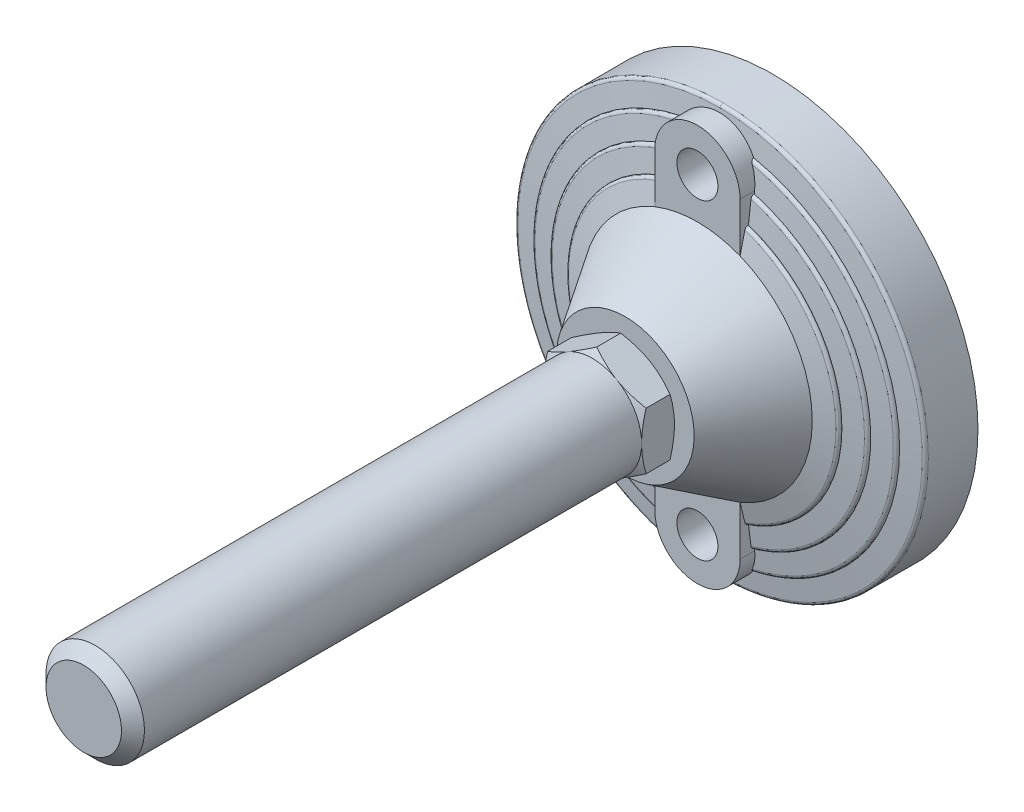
ISO-10303-21;
HEADER;
FILE_DESCRIPTION(('STEP AP214'),'2;1');
FILE_NAME('part.step','',(''),(''),'','','');
FILE_SCHEMA(('AUTOMOTIVE_DESIGN { 1 0 10303 214 1 1 1 1 }'));
ENDSEC;
DATA;
#1=APPLICATION_CONTEXT('core data for automotive mechanical design processes');
#2=APPLICATION_PROTOCOL_DEFINITION('international standard','automotive_design',2000,#1);
#3=PRODUCT_CONTEXT('',#1,'mechanical');
#4=PRODUCT('Part','Part','',(#3));
#5=PRODUCT_RELATED_PRODUCT_CATEGORY('part','',(#4));
#6=PRODUCT_DEFINITION_FORMATION('','',#4);
#7=PRODUCT_DEFINITION_CONTEXT('part definition',#1,'design');
#8=PRODUCT_DEFINITION('design','',#6,#7);
#9=PRODUCT_DEFINITION_SHAPE('','',#8);
#10=(LENGTH_UNIT() NAMED_UNIT(*) SI_UNIT(.MILLI.,.METRE.));
#11=(NAMED_UNIT(*) PLANE_ANGLE_UNIT() SI_UNIT($,.RADIAN.));
#12=(NAMED_UNIT(*) SI_UNIT($,.STERADIAN.) SOLID_ANGLE_UNIT());
#13=UNCERTAINTY_MEASURE_WITH_UNIT(LENGTH_MEASURE(1.E-05),#10,'distance_accuracy_value','');
#14=(GEOMETRIC_REPRESENTATION_CONTEXT(3) GLOBAL_UNCERTAINTY_ASSIGNED_CONTEXT((#13)) GLOBAL_UNIT_ASSIGNED_CONTEXT((#10,
#11,#12)) REPRESENTATION_CONTEXT('',''));
#15=CARTESIAN_POINT('',(0.,0.,0.));
#16=DIRECTION('',(0.,0.,1.));
#17=DIRECTION('',(1.,0.,0.));
#18=AXIS2_PLACEMENT_3D('',#15,#16,#17);
#19=CARTESIAN_POINT('',(0.,-47.5,0.));
#20=DIRECTION('',(0.,0.,1.));
#21=DIRECTION('',(0.,-1.,0.));
#22=AXIS2_PLACEMENT_3D('',#19,#20,#21);
#23=CYLINDRICAL_SURFACE('',#22,6.25);
#24=CARTESIAN_POINT('',(0.,-47.5,0.));
#25=DIRECTION('',(0.,0.,1.));
#26=DIRECTION('',(0.,-1.,0.));
#27=AXIS2_PLACEMENT_3D('',#24,#25,#26);
#28=CIRCLE('',#27,6.25);
#29=CARTESIAN_POINT('',(0.,-53.75,0.));
#30=VERTEX_POINT('',#29);
#31=EDGE_CURVE('E618',#30,#30,#28,.F.);
#32=ORIENTED_EDGE('',*,*,#31,.T.);
#33=EDGE_LOOP('',(#32));
#34=FACE_BOUND('',#33,.T.);
#35=CARTESIAN_POINT('',(0.,-47.5,23.));
#36=DIRECTION('',(0.,0.,1.));
#37=DIRECTION('',(0.,-1.,0.));
#38=AXIS2_PLACEMENT_3D('',#35,#36,#37);
#39=CIRCLE('',#38,6.25);
#40=CARTESIAN_POINT('',(0.,-53.75,23.));
#41=VERTEX_POINT('',#40);
#42=EDGE_CURVE('E723',#41,#41,#39,.T.);
#43=ORIENTED_EDGE('',*,*,#42,.T.);
#44=EDGE_LOOP('',(#43));
#45=FACE_BOUND('',#44,.T.);
#46=ADVANCED_FACE('F14',(#34,#45),#23,.F.);
#47=CARTESIAN_POINT('',(-21.325127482,-21.252,45.));
#48=DIRECTION('',(0.,0.,-1.));
#49=DIRECTION('',(0.,1.,0.));
#50=AXIS2_PLACEMENT_3D('',#47,#48,#49);
#51=PLANE('',#50);
#52=CARTESIAN_POINT('',(0.,0.,45.));
#53=DIRECTION('',(0.,0.,-1.));
#54=DIRECTION('',(0.,1.,0.));
#55=AXIS2_PLACEMENT_3D('',#52,#53,#54);
#56=CIRCLE('',#55,15.);
#57=CARTESIAN_POINT('',(15.,0.,45.));
#58=VERTEX_POINT('',#57);
#59=CARTESIAN_POINT('',(7.50000000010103,-12.9903810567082,45.));
#60=VERTEX_POINT('',#59);
#61=EDGE_CURVE('E251',#58,#60,#56,.T.);
#62=ORIENTED_EDGE('',*,*,#61,.T.);
#63=CARTESIAN_POINT('',(-7.50000000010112,-12.9903810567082,45.));
#64=VERTEX_POINT('',#63);
#65=EDGE_CURVE('E33',#60,#64,#56,.T.);
#66=ORIENTED_EDGE('',*,*,#65,.T.);
#67=CARTESIAN_POINT('',(-15.,0.,45.));
#68=VERTEX_POINT('',#67);
#69=EDGE_CURVE('E382',#64,#68,#56,.T.);
#70=ORIENTED_EDGE('',*,*,#69,.T.);
#71=CARTESIAN_POINT('',(-7.50000000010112,12.9903810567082,45.));
#72=VERTEX_POINT('',#71);
#73=EDGE_CURVE('E268',#68,#72,#56,.T.);
#74=ORIENTED_EDGE('',*,*,#73,.T.);
#75=CARTESIAN_POINT('',(7.50000000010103,12.9903810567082,45.));
#76=VERTEX_POINT('',#75);
#77=EDGE_CURVE('E253',#72,#76,#56,.T.);
#78=ORIENTED_EDGE('',*,*,#77,.T.);
#79=EDGE_CURVE('E239',#76,#58,#56,.T.);
#80=ORIENTED_EDGE('',*,*,#79,.T.);
#81=EDGE_LOOP('',(#62,#66,#70,#74,#78,#80));
#82=FACE_BOUND('',#81,.T.);
#83=CARTESIAN_POINT('',(0.,0.,45.));
#84=DIRECTION('',(0.,0.,-1.));
#85=DIRECTION('',(0.,1.,0.));
#86=AXIS2_PLACEMENT_3D('',#83,#84,#85);
#87=CIRCLE('',#86,21.);
#88=CARTESIAN_POINT('',(0.,21.,45.));
#89=VERTEX_POINT('',#88);
#90=EDGE_CURVE('E722',#89,#89,#87,.T.);
#91=ORIENTED_EDGE('',*,*,#90,.F.);
#92=EDGE_LOOP('',(#91));
#93=FACE_BOUND('',#92,.T.);
#94=ADVANCED_FACE('F265',(#82,#93),#51,.F.);
#95=CARTESIAN_POINT('',(-63.467641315,63.25,0.));
#96=DIRECTION('',(0.,0.,1.));
#97=DIRECTION('',(0.,-1.,0.));
#98=AXIS2_PLACEMENT_3D('',#95,#96,#97);
#99=PLANE('',#98);
#100=ORIENTED_EDGE('',*,*,#31,.F.);
#101=EDGE_LOOP('',(#100));
#102=FACE_BOUND('',#101,.T.);
#103=CARTESIAN_POINT('',(0.,47.5,0.));
#104=DIRECTION('',(0.,0.,1.));
#105=DIRECTION('',(0.,-1.,0.));
#106=AXIS2_PLACEMENT_3D('',#103,#104,#105);
#107=CIRCLE('',#106,6.25);
#108=CARTESIAN_POINT('',(0.,41.25,0.));
#109=VERTEX_POINT('',#108);
#110=EDGE_CURVE('E982',#109,#109,#107,.T.);
#111=ORIENTED_EDGE('',*,*,#110,.T.);
#112=EDGE_LOOP('',(#111));
#113=FACE_BOUND('',#112,.T.);
#114=CARTESIAN_POINT('',(0.,0.,0.));
#115=DIRECTION('',(0.,0.,-1.));
#116=DIRECTION('',(1.,0.,0.));
#117=AXIS2_PLACEMENT_3D('',#114,#115,#116);
#118=CIRCLE('',#117,62.5);
#119=CARTESIAN_POINT('',(62.5,0.,0.));
#120=VERTEX_POINT('',#119);
#121=EDGE_CURVE('E604',#120,#120,#118,.F.);
#122=ORIENTED_EDGE('',*,*,#121,.F.);
#123=EDGE_LOOP('',(#122));
#124=FACE_BOUND('',#123,.T.);
#125=ADVANCED_FACE('F573',(#102,#113,#124),#99,.F.);
#126=CARTESIAN_POINT('',(0.,0.,23.));
#127=DIRECTION('',(0.,0.,-1.));
#128=DIRECTION('',(0.,1.,0.));
#129=AXIS2_PLACEMENT_3D('',#126,#127,#128);
#130=CONICAL_SURFACE('',#129,35.,1.32154418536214);
#131=CARTESIAN_POINT('',(0.,0.,23.));
#132=DIRECTION('',(0.,0.,-1.));
#133=DIRECTION('',(0.,1.,0.));
#134=AXIS2_PLACEMENT_3D('',#131,#132,#133);
#135=CIRCLE('',#134,35.);
#136=CARTESIAN_POINT('',(12.9999999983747,-32.4961536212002,22.9999999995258));
#137=VERTEX_POINT('',#136);
#138=CARTESIAN_POINT('',(13.0000000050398,32.4961536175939,22.9999999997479));
#139=VERTEX_POINT('',#138);
#140=EDGE_CURVE('E719',#137,#139,#135,.F.);
#141=ORIENTED_EDGE('',*,*,#140,.F.);
#142=CARTESIAN_POINT('',(13.0000000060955,-38.6172483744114,21.5372089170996));
#143=CARTESIAN_POINT('',(13.0000000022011,-38.1074186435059,21.6602002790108));
#144=CARTESIAN_POINT('',(13.0000000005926,-37.5975329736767,21.7829600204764));
#145=CARTESIAN_POINT('',(12.9999999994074,-36.5776365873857,22.0279559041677));
#146=CARTESIAN_POINT('',(12.9999999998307,-36.0676258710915,22.1501920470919));
#147=CARTESIAN_POINT('',(13.0000000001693,-35.0474647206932,22.3940807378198));
#148=CARTESIAN_POINT('',(13.0000000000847,-34.5373142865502,22.5157332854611));
#149=CARTESIAN_POINT('',(12.9999999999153,-33.5168560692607,22.7583795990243));
#150=CARTESIAN_POINT('',(12.9999999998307,-33.0065482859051,22.8793733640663));
#151=CARTESIAN_POINT('',(13.,-32.496153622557,22.9999999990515));
#152=B_SPLINE_CURVE_WITH_KNOTS('',3,(#142,#143,#144,#145,#146,#147,#148,#149,#150,#151),
.UNSPECIFIED.,.F.,.F.,(4,2,2,2,4),(0.,1.57336555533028,3.14672901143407,4.72009290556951,
6.2934589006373),.UNSPECIFIED.);
#153=CARTESIAN_POINT('',(13.,-38.6172483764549,21.5372089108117));
#154=VERTEX_POINT('',#153);
#155=EDGE_CURVE('E558',#154,#137,#152,.T.);
#156=ORIENTED_EDGE('',*,*,#155,.F.);
#157=CARTESIAN_POINT('',(0.,0.,21.53720891));
#158=DIRECTION('',(0.,0.,-1.));
#159=DIRECTION('',(0.,1.,0.));
#160=AXIS2_PLACEMENT_3D('',#157,#158,#159);
#161=CIRCLE('',#160,40.746679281);
#162=CARTESIAN_POINT('',(13.,38.6172483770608,21.5372089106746));
#163=VERTEX_POINT('',#162);
#164=EDGE_CURVE('E614',#163,#154,#161,.T.);
#165=ORIENTED_EDGE('',*,*,#164,.F.);
#166=CARTESIAN_POINT('',(13.,32.4961536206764,22.999999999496));
#167=CARTESIAN_POINT('',(13.,33.0065482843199,22.8793733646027));
#168=CARTESIAN_POINT('',(13.,33.5168560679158,22.7583795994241));
#169=CARTESIAN_POINT('',(13.,34.5373142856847,22.515733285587));
#170=CARTESIAN_POINT('',(13.,35.0474647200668,22.3940807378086));
#171=CARTESIAN_POINT('',(13.,36.0676258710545,22.1501920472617));
#172=CARTESIAN_POINT('',(13.,36.577636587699,22.0279559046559));
#173=CARTESIAN_POINT('',(13.,37.597532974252,21.7829600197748));
#174=CARTESIAN_POINT('',(13.,38.1074186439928,21.6602002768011));
#175=CARTESIAN_POINT('',(13.,38.6172483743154,21.5372089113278));
#176=B_SPLINE_CURVE_WITH_KNOTS('',3,(#166,#167,#168,#169,#170,#171,#172,#173,#174,#175),
.UNSPECIFIED.,.F.,.F.,(4,2,2,2,4),(0.,1.57336599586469,3.1467298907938,4.72009334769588,
6.29345890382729),.UNSPECIFIED.);
#177=EDGE_CURVE('E985',#139,#163,#176,.T.);
#178=ORIENTED_EDGE('',*,*,#177,.F.);
#179=EDGE_LOOP('',(#141,#156,#165,#178));
#180=FACE_BOUND('',#179,.T.);
#181=ADVANCED_FACE('F999',(#180),#130,.T.);
#182=CARTESIAN_POINT('',(12.406354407,39.602176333,20.568111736));
#183=CARTESIAN_POINT('',(59.707464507,24.78394183,20.568111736));
#184=CARTESIAN_POINT('',(59.707464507,-24.78394183,20.568111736));
#185=CARTESIAN_POINT('',(12.406354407,-39.602176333,20.568111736));
#186=CARTESIAN_POINT('',(12.406354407,39.602176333,21.044046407));
#187=CARTESIAN_POINT('',(59.707464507,24.78394183,21.0440464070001));
#188=CARTESIAN_POINT('',(59.707464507,-24.78394183,21.0440464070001));
#189=CARTESIAN_POINT('',(12.406354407,-39.602176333,21.044046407));
#190=CARTESIAN_POINT('',(12.31903347,39.323440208,21.419805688));
#191=CARTESIAN_POINT('',(59.287219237,24.609502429,21.4198056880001));
#192=CARTESIAN_POINT('',(59.287219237,-24.609502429,21.4198056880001));
#193=CARTESIAN_POINT('',(12.31903347,-39.323440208,21.419805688));
#194=CARTESIAN_POINT('',(12.18115046,38.883305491,21.53720891));
#195=CARTESIAN_POINT('',(58.623636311,24.334056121,21.5372089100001));
#196=CARTESIAN_POINT('',(58.623636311,-24.334056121,21.5372089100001));
#197=CARTESIAN_POINT('',(12.18115046,-38.883305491,21.53720891));
#198=(BOUNDED_SURFACE() B_SPLINE_SURFACE(3,3,((#182,#183,#184,#185),(#186,#187,#188,#189),(#190,
#191,#192,#193),(#194,#195,#196,#197)),.UNSPECIFIED.,.F.,.F.,
.F.) B_SPLINE_SURFACE_WITH_KNOTS((4,4),(4,4),(0.,1.),(0.,1.),
.UNSPECIFIED.) GEOMETRIC_REPRESENTATION_ITEM() RATIONAL_B_SPLINE_SURFACE(((1.,0.532632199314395,
0.532632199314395,1.),(0.85967907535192,0.457892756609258,0.457892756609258,0.85967907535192),
(0.85967907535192,0.457892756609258,0.457892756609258,0.85967907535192),(1.,0.532632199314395,
0.532632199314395,1.))) REPRESENTATION_ITEM('') SURFACE());
#199=CARTESIAN_POINT('',(13.,-39.4112927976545,20.5681117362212));
#200=CARTESIAN_POINT('',(13.,-39.411293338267,20.5952104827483));
#201=CARTESIAN_POINT('',(13.,-39.4101321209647,20.6222958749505));
#202=CARTESIAN_POINT('',(13.,-39.4055044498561,20.6762650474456));
#203=CARTESIAN_POINT('',(13.,-39.4020383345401,20.7031488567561));
#204=CARTESIAN_POINT('',(13.,-39.3882336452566,20.7831079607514));
#205=CARTESIAN_POINT('',(13.,-39.3744885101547,20.8356344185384));
#206=CARTESIAN_POINT('',(13.,-39.3384084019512,20.9376087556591));
#207=CARTESIAN_POINT('',(13.,-39.3160736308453,20.9870567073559));
#208=CARTESIAN_POINT('',(13.,-39.2635909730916,21.081601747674));
#209=CARTESIAN_POINT('',(13.,-39.233444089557,21.1266993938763));
#210=CARTESIAN_POINT('',(13.,-39.165605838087,21.2123360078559));
#211=CARTESIAN_POINT('',(13.,-39.1277714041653,21.2527614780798));
#212=CARTESIAN_POINT('',(13.,-39.0461074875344,21.3270714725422));
#213=CARTESIAN_POINT('',(13.,-39.0022718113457,21.360949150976));
#214=CARTESIAN_POINT('',(13.,-38.9043172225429,21.425052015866));
#215=CARTESIAN_POINT('',(13.,-38.8495953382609,21.4543647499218));
#216=CARTESIAN_POINT('',(13.,-38.7644641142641,21.4909906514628));
#217=CARTESIAN_POINT('',(13.,-38.7355751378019,21.5019763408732));
#218=CARTESIAN_POINT('',(13.,-38.67697961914,21.5214626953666));
#219=CARTESIAN_POINT('',(13.,-38.6472733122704,21.5299640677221));
#220=CARTESIAN_POINT('',(13.,-38.6172483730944,21.5372089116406));
#221=B_SPLINE_CURVE_WITH_KNOTS('',3,(#199,#200,#201,#202,#203,#204,#205,#206,#207,#208,#209,
#210,#211,#212,#213,#214,#215,#216,#217,#218,#219,#220),.UNSPECIFIED.,.F.,.F.,(4,2,2,2,2,2,2,2,
2,2,4),(0.,0.0812450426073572,0.162478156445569,0.324519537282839,0.486557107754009,
0.648573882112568,0.813939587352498,0.979477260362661,1.16468654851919,1.25731455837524,
1.34991617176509),.UNSPECIFIED.);
#222=CARTESIAN_POINT('',(13.,-39.4112928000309,20.5681117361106));
#223=VERTEX_POINT('',#222);
#224=EDGE_CURVE('E584',#223,#154,#221,.T.);
#225=CARTESIAN_POINT('',(0.,0.,20.568111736));
#226=DIRECTION('',(0.,0.,-1.));
#227=DIRECTION('',(0.,1.,0.));
#228=AXIS2_PLACEMENT_3D('',#225,#226,#227);
#229=CIRCLE('',#228,41.5);
#230=CARTESIAN_POINT('',(13.,39.4112928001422,20.5681117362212));
#231=VERTEX_POINT('',#230);
#232=EDGE_CURVE('E617',#231,#223,#229,.T.);
#233=CARTESIAN_POINT('',(13.,38.6172483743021,21.5372089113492));
#234=CARTESIAN_POINT('',(13.,38.6757273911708,21.5231434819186));
#235=CARTESIAN_POINT('',(13.,38.7330575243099,21.5042077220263));
#236=CARTESIAN_POINT('',(13.,38.8438981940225,21.4570874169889));
#237=CARTESIAN_POINT('',(13.,38.8974017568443,21.4288864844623));
#238=CARTESIAN_POINT('',(13.,38.9989209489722,21.363734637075));
#239=CARTESIAN_POINT('',(13.,39.0469285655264,21.3267711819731));
#240=CARTESIAN_POINT('',(13.,39.135707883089,21.2450475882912));
#241=CARTESIAN_POINT('',(13.,39.1764870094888,21.2002955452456));
#242=CARTESIAN_POINT('',(13.,39.247988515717,21.1059931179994));
#243=CARTESIAN_POINT('',(13.,39.2790300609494,21.0566848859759));
#244=CARTESIAN_POINT('',(13.,39.3318958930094,20.9533393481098));
#245=CARTESIAN_POINT('',(13.,39.3537228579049,20.899303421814));
#246=CARTESIAN_POINT('',(13.,39.3839717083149,20.7991363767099));
#247=CARTESIAN_POINT('',(13.,39.3941848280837,20.7535382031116));
#248=CARTESIAN_POINT('',(13.,39.4078594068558,20.6613400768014));
#249=CARTESIAN_POINT('',(13.,39.411320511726,20.6147400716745));
#250=CARTESIAN_POINT('',(13.,39.4112927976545,20.5681117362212));
#251=B_SPLINE_CURVE_WITH_KNOTS('',3,(#233,#234,#235,#236,#237,#238,#239,#240,#241,#242,#243,
#244,#245,#246,#247,#248,#249,#250),.UNSPECIFIED.,.F.,.F.,(4,2,2,2,2,2,2,2,4),(0.,
0.180276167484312,0.360872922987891,0.541729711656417,0.7223996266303,0.896310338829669,
1.07017047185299,1.20986981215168,1.34957647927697),.UNSPECIFIED.);
#252=EDGE_CURVE('E758',#163,#231,#251,.T.);
#253=ORIENTED_EDGE('',*,*,#164,.T.);
#254=ORIENTED_EDGE('',*,*,#224,.F.);
#255=ORIENTED_EDGE('',*,*,#232,.F.);
#256=ORIENTED_EDGE('',*,*,#252,.F.);
#257=EDGE_LOOP('',(#253,#254,#255,#256));
#258=FACE_BOUND('',#257,.T.);
#259=ADVANCED_FACE('F749',(#258),#198,.T.);
#260=CARTESIAN_POINT('',(0.,0.,20.568111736));
#261=DIRECTION('',(0.,0.,-1.));
#262=DIRECTION('',(0.,1.,0.));
#263=AXIS2_PLACEMENT_3D('',#260,#261,#262);
#264=CYLINDRICAL_SURFACE('',#263,41.5);
#265=CARTESIAN_POINT('',(0.,0.,20.454545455));
#266=DIRECTION('',(0.,0.,-1.));
#267=DIRECTION('',(0.,1.,0.));
#268=AXIS2_PLACEMENT_3D('',#265,#266,#267);
#269=CIRCLE('',#268,41.5);
#270=CARTESIAN_POINT('',(13.,39.4112928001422,20.454545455));
#271=VERTEX_POINT('',#270);
#272=CARTESIAN_POINT('',(13.,-39.4112928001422,20.4545454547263));
#273=VERTEX_POINT('',#272);
#274=EDGE_CURVE('E735',#271,#273,#269,.T.);
#275=ORIENTED_EDGE('',*,*,#274,.F.);
#276=DIRECTION('',(0.,0.,-1.));
#277=VECTOR('',#276,1.);
#278=CARTESIAN_POINT('',(13.,39.4112928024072,20.7755712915));
#279=LINE('',#278,#277);
#280=EDGE_CURVE('E745',#231,#271,#279,.T.);
#281=ORIENTED_EDGE('',*,*,#280,.F.);
#282=ORIENTED_EDGE('',*,*,#232,.T.);
#283=DIRECTION('',(0.,0.,1.));
#284=VECTOR('',#283,1.);
#285=CARTESIAN_POINT('',(13.,-39.4112928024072,20.7755712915));
#286=LINE('',#285,#284);
#287=EDGE_CURVE('E597',#273,#223,#286,.T.);
#288=ORIENTED_EDGE('',*,*,#287,.F.);
#289=EDGE_LOOP('',(#275,#281,#282,#288));
#290=FACE_BOUND('',#289,.T.);
#291=ADVANCED_FACE('F743',(#290),#264,.T.);
#292=CARTESIAN_POINT('',(0.,0.,20.454545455));
#293=DIRECTION('',(0.,0.,-1.));
#294=DIRECTION('',(0.,1.,0.));
#295=AXIS2_PLACEMENT_3D('',#292,#293,#294);
#296=CONICAL_SURFACE('',#295,41.5,1.4442041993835);
#297=ORIENTED_EDGE('',*,*,#274,.T.);
#298=CARTESIAN_POINT('',(13.0000000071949,-45.8176832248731,19.6748403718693));
#299=CARTESIAN_POINT('',(13.0000000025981,-45.2838642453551,19.7402005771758));
#300=CARTESIAN_POINT('',(13.0000000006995,-44.7500350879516,19.8054777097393));
#301=CARTESIAN_POINT('',(12.9999999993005,-43.6823542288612,19.9358466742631));
#302=CARTESIAN_POINT('',(12.9999999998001,-43.1485025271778,20.0009385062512));
#303=CARTESIAN_POINT('',(13.0000000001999,-42.0807742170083,20.1309177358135));
#304=CARTESIAN_POINT('',(13.0000000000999,-41.5468976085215,20.1958051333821));
#305=CARTESIAN_POINT('',(12.9999999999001,-40.4791166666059,20.3253520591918));
#306=CARTESIAN_POINT('',(12.9999999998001,-39.9452123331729,20.390011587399));
#307=CARTESIAN_POINT('',(13.,-39.4112928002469,20.4545454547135));
#308=B_SPLINE_CURVE_WITH_KNOTS('',3,(#298,#299,#300,#301,#302,#303,#304,#305,#306,#307),
.UNSPECIFIED.,.F.,.F.,(4,2,2,2,4),(0.,1.613416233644,3.22683222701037,4.84024826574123,
6.45366454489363),.UNSPECIFIED.);
#309=CARTESIAN_POINT('',(13.,-45.8176832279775,19.6748403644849));
#310=VERTEX_POINT('',#309);
#311=EDGE_CURVE('E591',#310,#273,#308,.T.);
#312=ORIENTED_EDGE('',*,*,#311,.F.);
#313=CARTESIAN_POINT('',(-7.48576536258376E-10,0.,19.674840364));
#314=DIRECTION('',(0.,0.,-1.));
#315=DIRECTION('',(0.,1.,0.));
#316=AXIS2_PLACEMENT_3D('',#313,#314,#315);
#317=CIRCLE('',#316,47.6262542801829);
#318=CARTESIAN_POINT('',(13.,45.8176832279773,19.6748403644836));
#319=VERTEX_POINT('',#318);
#320=EDGE_CURVE('E611',#319,#310,#317,.T.);
#321=ORIENTED_EDGE('',*,*,#320,.F.);
#322=CARTESIAN_POINT('',(12.999999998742,39.4112928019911,20.4545454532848));
#323=CARTESIAN_POINT('',(12.9999999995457,39.9452123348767,20.3900115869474));
#324=CARTESIAN_POINT('',(12.9999999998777,40.4791166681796,20.3253520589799));
#325=CARTESIAN_POINT('',(13.0000000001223,41.5468976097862,20.1958051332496));
#326=CARTESIAN_POINT('',(13.0000000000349,42.080774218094,20.1309177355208));
#327=CARTESIAN_POINT('',(12.9999999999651,43.1485025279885,20.000938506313));
#328=CARTESIAN_POINT('',(12.9999999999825,43.6823542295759,19.9358466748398));
#329=CARTESIAN_POINT('',(13.0000000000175,44.7500350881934,19.8054777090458));
#330=CARTESIAN_POINT('',(13.0000000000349,45.2838642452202,19.7402005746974));
#331=CARTESIAN_POINT('',(13.,45.817683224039,19.6748403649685));
#332=B_SPLINE_CURVE_WITH_KNOTS('',3,(#322,#323,#324,#325,#326,#327,#328,#329,#330,#331),
.UNSPECIFIED.,.F.,.F.,(4,2,2,2,4),(0.,1.61341627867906,3.226832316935,4.84024830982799,
6.45366454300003),.UNSPECIFIED.);
#333=EDGE_CURVE('E757',#271,#319,#332,.T.);
#334=ORIENTED_EDGE('',*,*,#333,.F.);
#335=EDGE_LOOP('',(#297,#312,#321,#334));
#336=FACE_BOUND('',#335,.T.);
#337=ADVANCED_FACE('F525',(#336),#296,.T.);
#338=CARTESIAN_POINT('',(12.269850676,46.922284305,18.669623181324));
#339=CARTESIAN_POINT('',(72.557631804,31.157449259,18.669623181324));
#340=CARTESIAN_POINT('',(72.557631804,-31.157449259,18.669623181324));
#341=CARTESIAN_POINT('',(12.269850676,-46.922284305,18.669623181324));
#342=CARTESIAN_POINT('',(12.269850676,46.922284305,18.6740296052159));
#343=CARTESIAN_POINT('',(72.557631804,31.157449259,18.674029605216));
#344=CARTESIAN_POINT('',(72.557631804,-31.157449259,18.674029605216));
#345=CARTESIAN_POINT('',(12.269850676,-46.922284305,18.6740296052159));
#346=CARTESIAN_POINT('',(12.269850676,46.922284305,18.678436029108));
#347=CARTESIAN_POINT('',(72.557631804,31.157449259,18.678436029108));
#348=CARTESIAN_POINT('',(72.557631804,-31.157449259,18.678436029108));
#349=CARTESIAN_POINT('',(12.269850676,-46.922284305,18.678436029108));
#350=CARTESIAN_POINT('',(12.269850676,46.922284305,18.682842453));
#351=CARTESIAN_POINT('',(72.557631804,31.157449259,18.6828424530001));
#352=CARTESIAN_POINT('',(72.557631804,-31.157449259,18.6828424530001));
#353=CARTESIAN_POINT('',(12.269850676,-46.922284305,18.682842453));
#354=CARTESIAN_POINT('',(12.269850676,46.922284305,19.211436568));
#355=CARTESIAN_POINT('',(72.557631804,31.157449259,19.2114365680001));
#356=CARTESIAN_POINT('',(72.557631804,-31.157449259,19.2114365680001));
#357=CARTESIAN_POINT('',(12.269850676,-46.922284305,19.211436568));
#358=CARTESIAN_POINT('',(12.181461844,46.584268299,19.608103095));
#359=CARTESIAN_POINT('',(72.034945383,30.93299905,19.6081030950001));
#360=CARTESIAN_POINT('',(72.034945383,-30.93299905,19.6081030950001));
#361=CARTESIAN_POINT('',(12.181461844,-46.584268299,19.608103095));
#362=CARTESIAN_POINT('',(12.048804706,46.076961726,19.674840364));
#363=CARTESIAN_POINT('',(71.250478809,30.596136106,19.6748403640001));
#364=CARTESIAN_POINT('',(71.250478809,-30.596136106,19.6748403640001));
#365=CARTESIAN_POINT('',(12.048804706,-46.076961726,19.674840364));
#366=(BOUNDED_SURFACE() B_SPLINE_SURFACE(3,3,((#338,#339,#340,#341),(#342,#343,#344,#345),(#346,
#347,#348,#349),(#350,#351,#352,#353),(#354,#355,#356,#357),(#358,#359,#360,#361),(#362,#363,
#364,#365)),.UNSPECIFIED.,.F.,.F.,.F.) B_SPLINE_SURFACE_WITH_KNOTS((4,3,4),(4,4),(-0.01,0.,1.),
(0.,1.),.UNSPECIFIED.) GEOMETRIC_REPRESENTATION_ITEM() RATIONAL_B_SPLINE_SURFACE(((1.,
0.501991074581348,0.501991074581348,1.),(1.,0.501991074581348,0.501991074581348,1.),(1.,
0.501991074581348,0.501991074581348,1.),(1.,0.501991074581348,0.501991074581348,1.),
(0.833611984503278,0.418465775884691,0.418465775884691,0.833611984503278),(0.833611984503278,
0.418465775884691,0.418465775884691,0.833611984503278),(1.,0.501991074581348,0.501991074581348,1.))) REPRESENTATION_ITEM('') SURFACE());
#367=CARTESIAN_POINT('',(13.,-46.7252608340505,18.6777848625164));
#368=CARTESIAN_POINT('',(13.,-46.7253979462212,18.7054287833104));
#369=CARTESIAN_POINT('',(13.,-46.7243484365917,18.7330653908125));
#370=CARTESIAN_POINT('',(13.,-46.719887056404,18.788143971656));
#371=CARTESIAN_POINT('',(13.,-46.716475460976,18.8155859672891));
#372=CARTESIAN_POINT('',(13.,-46.7027375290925,18.8972169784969));
#373=CARTESIAN_POINT('',(13.,-46.688908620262,18.9508576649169));
#374=CARTESIAN_POINT('',(13.,-46.6523707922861,19.0550506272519));
#375=CARTESIAN_POINT('',(13.,-46.6296523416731,19.1055995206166));
#376=CARTESIAN_POINT('',(13.,-46.5760978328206,19.2021956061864));
#377=CARTESIAN_POINT('',(13.,-46.545261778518,19.2482428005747));
#378=CARTESIAN_POINT('',(13.,-46.4762858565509,19.3348542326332));
#379=CARTESIAN_POINT('',(13.,-46.438110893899,19.3753904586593));
#380=CARTESIAN_POINT('',(13.,-46.3556866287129,19.4497572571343));
#381=CARTESIAN_POINT('',(13.,-46.311434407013,19.4835845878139));
#382=CARTESIAN_POINT('',(13.,-46.2164675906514,19.5448274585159));
#383=CARTESIAN_POINT('',(13.,-46.1655796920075,19.5719736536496));
#384=CARTESIAN_POINT('',(13.,-46.0601083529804,19.6176355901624));
#385=CARTESIAN_POINT('',(13.,-46.0055288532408,19.6361603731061));
#386=CARTESIAN_POINT('',(13.,-45.9281089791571,19.6556819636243));
#387=CARTESIAN_POINT('',(13.,-45.9061721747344,19.6604842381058));
#388=CARTESIAN_POINT('',(13.,-45.8620822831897,19.6686997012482));
#389=CARTESIAN_POINT('',(13.,-45.8399296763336,19.672115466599));
#390=CARTESIAN_POINT('',(13.,-45.817683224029,19.674840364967));
#391=B_SPLINE_CURVE_WITH_KNOTS('',3,(#367,#368,#369,#370,#371,#372,#373,#374,#375,#376,#377,
#378,#379,#380,#381,#382,#383,#384,#385,#386,#387,#388,#389,#390),.UNSPECIFIED.,.F.,.F.,(4,2,2,
2,2,2,2,2,2,2,2,4),(0.,0.0828810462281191,0.165752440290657,0.331061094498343,0.496547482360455,
0.662033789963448,0.828332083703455,0.994710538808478,1.1669783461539,1.33906508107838,
1.40639957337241,1.47360835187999),.UNSPECIFIED.);
#392=CARTESIAN_POINT('',(13.0000000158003,-46.7252608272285,18.6777848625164));
#393=VERTEX_POINT('',#392);
#394=EDGE_CURVE('E556',#393,#310,#391,.T.);
#395=CARTESIAN_POINT('',(13.0000000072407,46.725260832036,18.6727272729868));
#396=CARTESIAN_POINT('',(13.3212147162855,46.6358917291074,18.6727272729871));
#397=CARTESIAN_POINT('',(13.6414983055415,46.543212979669,18.6727272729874));
#398=CARTESIAN_POINT('',(14.2801231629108,46.3512597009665,18.672727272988));
#399=CARTESIAN_POINT('',(14.5984642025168,46.2519844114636,18.6727272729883));
#400=CARTESIAN_POINT('',(15.5526106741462,45.9435979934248,18.6727272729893));
#401=CARTESIAN_POINT('',(16.1852411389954,45.7245656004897,18.6727272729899));
#402=CARTESIAN_POINT('',(17.4409289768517,45.260491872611,18.6727272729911));
#403=CARTESIAN_POINT('',(18.0639854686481,45.0154481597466,18.6727272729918));
#404=CARTESIAN_POINT('',(19.3000708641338,44.4995075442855,18.672727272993));
#405=CARTESIAN_POINT('',(19.9130888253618,44.228584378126,18.6727272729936));
#406=CARTESIAN_POINT('',(21.1274202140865,43.6615551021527,18.6727272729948));
#407=CARTESIAN_POINT('',(21.7287319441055,43.3654453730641,18.6727272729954));
#408=CARTESIAN_POINT('',(23.5288179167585,42.4321391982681,18.6727272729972));
#409=CARTESIAN_POINT('',(24.70797851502,41.7565378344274,18.6727272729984));
#410=CARTESIAN_POINT('',(27.0057517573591,40.3086198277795,18.6727272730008));
#411=CARTESIAN_POINT('',(28.124340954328,39.5362661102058,18.672727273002));
#412=CARTESIAN_POINT('',(30.2940548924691,37.899455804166,18.6727272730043));
#413=CARTESIAN_POINT('',(31.3451007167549,37.0348945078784,18.6727272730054));
#414=CARTESIAN_POINT('',(33.3707378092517,35.220625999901,18.6727272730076));
#415=CARTESIAN_POINT('',(34.3453363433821,34.2709268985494,18.6727272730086));
#416=CARTESIAN_POINT('',(36.21413180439,32.2900336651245,18.6727272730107));
#417=CARTESIAN_POINT('',(37.1080775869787,31.2586025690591,18.6727272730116));
#418=CARTESIAN_POINT('',(38.8059105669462,29.1240638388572,18.6727272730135));
#419=CARTESIAN_POINT('',(39.6097954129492,28.0209543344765,18.6727272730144));
#420=CARTESIAN_POINT('',(41.1215543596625,25.7512426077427,18.6727272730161));
#421=CARTESIAN_POINT('',(41.8294551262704,24.5846581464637,18.6727272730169));
#422=CARTESIAN_POINT('',(43.1444737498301,22.196015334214,18.6727272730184));
#423=CARTESIAN_POINT('',(43.7515922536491,20.9739573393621,18.6727272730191));
#424=CARTESIAN_POINT('',(44.8608053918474,18.4828923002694,18.6727272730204));
#425=CARTESIAN_POINT('',(45.362887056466,17.2138794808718,18.6727272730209));
#426=CARTESIAN_POINT('',(46.2583633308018,14.6380667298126,18.672727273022));
#427=CARTESIAN_POINT('',(46.6517577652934,13.3312667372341,18.6727272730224));
#428=CARTESIAN_POINT('',(47.3270705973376,10.6891374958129,18.6727272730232));
#429=CARTESIAN_POINT('',(47.6089860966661,9.35380750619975,18.6727272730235));
#430=CARTESIAN_POINT('',(48.0593220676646,6.66414532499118,18.6727272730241));
#431=CARTESIAN_POINT('',(48.2277425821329,5.30981314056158,18.6727272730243));
#432=CARTESIAN_POINT('',(48.4498861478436,2.59183878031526,18.6727272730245));
#433=CARTESIAN_POINT('',(48.5036145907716,1.22819704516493,18.6727272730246));
#434=CARTESIAN_POINT('',(48.4960080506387,-1.49876561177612,18.6727272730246));
#435=CARTESIAN_POINT('',(48.4346730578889,-2.86208653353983,18.6727272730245));
#436=CARTESIAN_POINT('',(48.197367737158,-5.57880747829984,18.6727272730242));
#437=CARTESIAN_POINT('',(48.0213896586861,-6.93220682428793,18.672727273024));
#438=CARTESIAN_POINT('',(47.5560413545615,-9.61936956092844,18.6727272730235));
#439=CARTESIAN_POINT('',(47.2666711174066,-10.953132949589,18.6727272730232));
#440=CARTESIAN_POINT('',(46.5765756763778,-13.5916227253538,18.6727272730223));
#441=CARTESIAN_POINT('',(46.1758433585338,-14.8963472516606,18.6727272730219));
#442=CARTESIAN_POINT('',(45.2658742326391,-17.4674022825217,18.6727272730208));
#443=CARTESIAN_POINT('',(44.756637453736,-18.7337327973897,18.6727272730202));
#444=CARTESIAN_POINT('',(43.633416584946,-21.2187182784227,18.672727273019));
#445=CARTESIAN_POINT('',(43.0194530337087,-22.4373825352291,18.6727272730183));
#446=CARTESIAN_POINT('',(41.6909757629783,-24.8187625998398,18.6727272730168));
#447=CARTESIAN_POINT('',(40.9764619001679,-25.9814783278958,18.672727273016));
#448=CARTESIAN_POINT('',(39.7063025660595,-27.8655028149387,18.6727272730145));
#449=CARTESIAN_POINT('',(39.1770724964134,-28.604776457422,18.6727272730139));
#450=CARTESIAN_POINT('',(38.0778809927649,-30.0524665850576,18.6727272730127));
#451=CARTESIAN_POINT('',(37.5079195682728,-30.7608830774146,18.6727272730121));
#452=CARTESIAN_POINT('',(36.3291070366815,-32.1445499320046,18.6727272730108));
#453=CARTESIAN_POINT('',(35.7202564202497,-32.8198007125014,18.6727272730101));
#454=CARTESIAN_POINT('',(34.465364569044,-34.1352484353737,18.6727272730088));
#455=CARTESIAN_POINT('',(33.819310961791,-34.7754335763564,18.6727272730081));
#456=CARTESIAN_POINT('',(32.492229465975,-36.0184899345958,18.6727272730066));
#457=CARTESIAN_POINT('',(31.8112009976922,-36.6213605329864,18.6727272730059));
#458=CARTESIAN_POINT('',(30.4163089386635,-37.7878929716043,18.6727272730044));
#459=CARTESIAN_POINT('',(29.7024437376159,-38.351552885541,18.6727272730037));
#460=CARTESIAN_POINT('',(28.1769516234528,-39.4879139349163,18.6727272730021));
#461=CARTESIAN_POINT('',(27.3623770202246,-40.0566641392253,18.6727272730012));
#462=CARTESIAN_POINT('',(25.6997855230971,-41.1431320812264,18.6727272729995));
#463=CARTESIAN_POINT('',(24.8517655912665,-41.6608451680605,18.6727272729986));
#464=CARTESIAN_POINT('',(23.1254909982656,-42.6432641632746,18.6727272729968));
#465=CARTESIAN_POINT('',(22.2472346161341,-43.1079670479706,18.6727272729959));
#466=CARTESIAN_POINT('',(20.4623876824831,-43.9832963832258,18.6727272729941));
#467=CARTESIAN_POINT('',(19.5557530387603,-44.393832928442,18.6727272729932));
#468=CARTESIAN_POINT('',(17.7189637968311,-45.1583612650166,18.6727272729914));
#469=CARTESIAN_POINT('',(16.7888095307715,-45.5123538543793,18.6727272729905));
#470=CARTESIAN_POINT('',(14.9085132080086,-46.1625049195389,18.6727272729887));
#471=CARTESIAN_POINT('',(13.9583713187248,-46.4586638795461,18.6727272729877));
#472=CARTESIAN_POINT('',(13.0000000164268,-46.7252608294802,18.6727272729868));
#473=B_SPLINE_CURVE_WITH_KNOTS('',3,(#395,#396,#397,#398,#399,#400,#401,#402,#403,#404,#405,
#406,#407,#408,#409,#410,#411,#412,#413,#414,#415,#416,#417,#418,#419,#420,#421,#422,#423,#424,
#425,#426,#427,#428,#429,#430,#431,#432,#433,#434,#435,#436,#437,#438,#439,#440,#441,#442,#443,
#444,#445,#446,#447,#448,#449,#450,#451,#452,#453,#454,#455,#456,#457,#458,#459,#460,#461,#462,
#463,#464,#465,#466,#467,#468,#469,#470,#471,#472),.UNSPECIFIED.,.F.,.F.,(4,2,2,2,2,2,2,2,2,2,2,
2,2,2,2,2,2,2,2,2,2,2,2,2,2,2,2,2,2,2,2,2,2,2,2,2,2,2,4),(0.,1.00020816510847,2.00053180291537,
4.00833027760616,6.01631246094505,8.02635452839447,10.0366859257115,14.1084282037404,
18.1817355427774,22.2597186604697,26.3373137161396,30.4271967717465,34.5171865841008,
38.6060377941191,42.6948627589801,46.7841923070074,50.8735284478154,54.9629708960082,
59.0524118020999,63.1416604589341,67.2309094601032,71.3204349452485,75.4099608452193,
79.4997480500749,83.5895341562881,87.6785191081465,91.7675098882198,94.4937471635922,
97.2199838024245,99.9461860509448,102.673300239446,105.400459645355,108.12775293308,
111.106299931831,114.085118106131,117.064106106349,120.047978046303,123.031807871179,
126.015612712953),.UNSPECIFIED.);
#474=CARTESIAN_POINT('',(13.0000000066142,46.7252608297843,18.6777848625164));
#475=VERTEX_POINT('',#474);
#476=EDGE_CURVE('E514',#475,#393,#473,.T.);
#477=CARTESIAN_POINT('',(13.,45.817683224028,19.6748403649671));
#478=CARTESIAN_POINT('',(13.,45.8768916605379,19.6676266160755));
#479=CARTESIAN_POINT('',(13.,45.9354849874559,19.6554311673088));
#480=CARTESIAN_POINT('',(13.,46.0498761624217,19.6214764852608));
#481=CARTESIAN_POINT('',(13.,46.105671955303,19.5997103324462));
#482=CARTESIAN_POINT('',(13.,46.2128716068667,19.5469963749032));
#483=CARTESIAN_POINT('',(13.,46.2642705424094,19.5160384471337));
#484=CARTESIAN_POINT('',(13.,46.3367247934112,19.4633763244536));
#485=CARTESIAN_POINT('',(13.,46.3600988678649,19.4447881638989));
#486=CARTESIAN_POINT('',(13.,46.4051654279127,19.4056252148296));
#487=CARTESIAN_POINT('',(13.,46.4268560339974,19.3850482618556));
#488=CARTESIAN_POINT('',(13.,46.4880645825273,19.3216088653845));
#489=CARTESIAN_POINT('',(13.,46.5249454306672,19.2761439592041));
#490=CARTESIAN_POINT('',(13.,46.5901806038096,19.1794685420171));
#491=CARTESIAN_POINT('',(13.,46.6185381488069,19.1282602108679));
#492=CARTESIAN_POINT('',(13.,46.6534889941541,19.0492930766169));
#493=CARTESIAN_POINT('',(13.,46.6637514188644,19.0231112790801));
#494=CARTESIAN_POINT('',(13.,46.681971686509,18.9699855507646));
#495=CARTESIAN_POINT('',(13.,46.6899313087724,18.943042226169));
#496=CARTESIAN_POINT('',(13.,46.7102220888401,18.8614024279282));
#497=CARTESIAN_POINT('',(13.,46.7190275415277,18.8057552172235));
#498=CARTESIAN_POINT('',(13.,46.7237631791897,18.7378782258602));
#499=CARTESIAN_POINT('',(13.,46.724374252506,18.7258595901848));
#500=CARTESIAN_POINT('',(13.,46.7251497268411,18.7018236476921));
#501=CARTESIAN_POINT('',(13.,46.725314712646,18.6898063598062));
#502=CARTESIAN_POINT('',(13.,46.7252608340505,18.6777848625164));
#503=B_SPLINE_CURVE_WITH_KNOTS('',3,(#477,#478,#479,#480,#481,#482,#483,#484,#485,#486,#487,
#488,#489,#490,#491,#492,#493,#494,#495,#496,#497,#498,#499,#500,#501,#502),.UNSPECIFIED.,.F.,
.F.,(4,2,2,2,2,2,2,2,2,2,2,2,4),(0.,0.178718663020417,0.357566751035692,0.53661254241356,
0.626107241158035,0.715700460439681,0.890396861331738,1.06502718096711,1.14929679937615,
1.23350112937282,1.40145320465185,1.43755286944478,1.47360518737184),.UNSPECIFIED.);
#504=EDGE_CURVE('E1413',#319,#475,#503,.T.);
#505=ORIENTED_EDGE('',*,*,#320,.T.);
#506=ORIENTED_EDGE('',*,*,#394,.F.);
#507=ORIENTED_EDGE('',*,*,#476,.F.);
#508=ORIENTED_EDGE('',*,*,#504,.F.);
#509=EDGE_LOOP('',(#505,#506,#507,#508));
#510=FACE_BOUND('',#509,.T.);
#511=ADVANCED_FACE('F517',(#510),#366,.T.);
#512=CARTESIAN_POINT('',(0.,62.5,15.119206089));
#513=CARTESIAN_POINT('',(125.,62.5,15.1192060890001));
#514=CARTESIAN_POINT('',(125.,-62.5,15.1192060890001));
#515=CARTESIAN_POINT('',(0.,-62.5,15.119206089));
#516=CARTESIAN_POINT('',(0.,62.5,15.647800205));
#517=CARTESIAN_POINT('',(125.,62.5,15.6478002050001));
#518=CARTESIAN_POINT('',(125.,-62.5,15.6478002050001));
#519=CARTESIAN_POINT('',(0.,-62.5,15.647800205));
#520=CARTESIAN_POINT('',(0.,62.150618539,16.044466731));
#521=CARTESIAN_POINT('',(124.301237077,62.150618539,16.0444667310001));
#522=CARTESIAN_POINT('',(124.301237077,-62.150618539,16.0444667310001));
#523=CARTESIAN_POINT('',(0.,-62.150618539,16.044466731));
#524=CARTESIAN_POINT('',(0.,61.62625428,16.111204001));
#525=CARTESIAN_POINT('',(123.252508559,61.6262542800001,16.1112040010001));
#526=CARTESIAN_POINT('',(123.252508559,-61.6262542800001,16.1112040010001));
#527=CARTESIAN_POINT('',(0.,-61.62625428,16.111204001));
#528=(BOUNDED_SURFACE() B_SPLINE_SURFACE(3,3,((#512,#513,#514,#515),(#516,#517,#518,#519),(#520,
#521,#522,#523),(#524,#525,#526,#527)),.UNSPECIFIED.,.F.,.F.,
.F.) B_SPLINE_SURFACE_WITH_KNOTS((4,4),(4,4),(0.,1.),(0.,1.),
.UNSPECIFIED.) GEOMETRIC_REPRESENTATION_ITEM() RATIONAL_B_SPLINE_SURFACE(((1.,0.333333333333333,
0.333333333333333,1.),(0.833611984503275,0.277870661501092,0.277870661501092,0.833611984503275),
(0.833611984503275,0.277870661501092,0.277870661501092,0.833611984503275),(1.,0.333333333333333,
0.333333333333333,1.))) REPRESENTATION_ITEM('') SURFACE());
#529=CARTESIAN_POINT('',(0.,0.,15.119206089));
#530=DIRECTION('',(0.,0.,1.));
#531=DIRECTION('',(-1.,0.,0.));
#532=AXIS2_PLACEMENT_3D('',#529,#530,#531);
#533=CIRCLE('',#532,62.5);
#534=CARTESIAN_POINT('',(-9.61423719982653E-09,-62.5,15.119206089));
#535=VERTEX_POINT('',#534);
#536=CARTESIAN_POINT('',(-2.80606487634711E-09,62.5,15.119206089));
#537=VERTEX_POINT('',#536);
#538=EDGE_CURVE('E608',#535,#537,#533,.T.);
#539=CARTESIAN_POINT('',(0.,62.5,15.119206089));
#540=CARTESIAN_POINT('',(0.,62.5,15.647800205));
#541=CARTESIAN_POINT('',(0.,62.150618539,16.044466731));
#542=CARTESIAN_POINT('',(0.,61.62625428,16.111204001));
#543=(BOUNDED_CURVE() B_SPLINE_CURVE(3,(#539,#540,#541,#542),.UNSPECIFIED.,.F.,
.F.) B_SPLINE_CURVE_WITH_KNOTS((4,4),(0.,1.),
.UNSPECIFIED.) CURVE() GEOMETRIC_REPRESENTATION_ITEM() RATIONAL_B_SPLINE_CURVE((1.,
0.833611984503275,0.833611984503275,1.)) REPRESENTATION_ITEM(''));
#544=CARTESIAN_POINT('',(-8.30048237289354E-09,61.6262542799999,16.1112040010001));
#545=VERTEX_POINT('',#544);
#546=EDGE_CURVE('E696',#545,#537,#543,.F.);
#547=CARTESIAN_POINT('',(0.,0.,16.1112040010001));
#548=DIRECTION('',(0.,0.,-1.));
#549=DIRECTION('',(0.,1.,0.));
#550=AXIS2_PLACEMENT_3D('',#547,#548,#549);
#551=CIRCLE('',#550,61.62625428);
#552=CARTESIAN_POINT('',(-1.57997099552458E-08,-61.6262542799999,16.1112040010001));
#553=VERTEX_POINT('',#552);
#554=EDGE_CURVE('E682',#553,#545,#551,.F.);
#555=CARTESIAN_POINT('',(0.,-62.5,15.119206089));
#556=CARTESIAN_POINT('',(0.,-62.5,15.647800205));
#557=CARTESIAN_POINT('',(0.,-62.150618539,16.044466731));
#558=CARTESIAN_POINT('',(0.,-61.62625428,16.111204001));
#559=(BOUNDED_CURVE() B_SPLINE_CURVE(3,(#555,#556,#557,#558),.UNSPECIFIED.,.F.,
.F.) B_SPLINE_CURVE_WITH_KNOTS((4,4),(0.,1.),
.UNSPECIFIED.) CURVE() GEOMETRIC_REPRESENTATION_ITEM() RATIONAL_B_SPLINE_CURVE((1.,
0.833611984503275,0.833611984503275,1.)) REPRESENTATION_ITEM(''));
#560=EDGE_CURVE('E700',#535,#553,#559,.T.);
#561=ORIENTED_EDGE('',*,*,#538,.T.);
#562=ORIENTED_EDGE('',*,*,#546,.F.);
#563=ORIENTED_EDGE('',*,*,#554,.F.);
#564=ORIENTED_EDGE('',*,*,#560,.F.);
#565=EDGE_LOOP('',(#561,#562,#563,#564));
#566=FACE_BOUND('',#565,.T.);
#567=ADVANCED_FACE('F524',(#566),#528,.T.);
#568=CARTESIAN_POINT('',(0.,0.,15.119206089));
#569=DIRECTION('',(0.,0.,-1.));
#570=DIRECTION('',(1.,0.,0.));
#571=AXIS2_PLACEMENT_3D('',#568,#569,#570);
#572=CYLINDRICAL_SURFACE('',#571,62.5);
#573=ORIENTED_EDGE('',*,*,#538,.F.);
#574=CARTESIAN_POINT('',(0.,0.,15.119206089));
#575=DIRECTION('',(0.,0.,1.));
#576=DIRECTION('',(-1.,0.,0.));
#577=AXIS2_PLACEMENT_3D('',#574,#575,#576);
#578=CIRCLE('',#577,62.5);
#579=EDGE_CURVE('E699',#537,#535,#578,.T.);
#580=ORIENTED_EDGE('',*,*,#579,.F.);
#581=EDGE_LOOP('',(#573,#580));
#582=FACE_BOUND('',#581,.T.);
#583=ORIENTED_EDGE('',*,*,#121,.T.);
#584=EDGE_LOOP('',(#583));
#585=FACE_BOUND('',#584,.T.);
#586=ADVANCED_FACE('F571',(#582,#585),#572,.T.);
#587=CARTESIAN_POINT('',(13.,-47.5,18.551142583));
#588=DIRECTION('',(1.,0.,0.));
#589=DIRECTION('',(0.,1.,0.));
#590=AXIS2_PLACEMENT_3D('',#587,#588,#589);
#591=PLANE('',#590);
#592=ORIENTED_EDGE('',*,*,#287,.T.);
#593=ORIENTED_EDGE('',*,*,#224,.T.);
#594=ORIENTED_EDGE('',*,*,#155,.T.);
#595=DIRECTION('',(0.,-1.,0.));
#596=VECTOR('',#595,1.);
#597=CARTESIAN_POINT('',(13.,-46.5204431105,23.));
#598=LINE('',#597,#596);
#599=CARTESIAN_POINT('',(13.,-47.5000000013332,23.));
#600=VERTEX_POINT('',#599);
#601=EDGE_CURVE('E750',#137,#600,#598,.T.);
#602=ORIENTED_EDGE('',*,*,#601,.T.);
#603=DIRECTION('',(0.,0.,1.));
#604=VECTOR('',#603,1.);
#605=CARTESIAN_POINT('',(13.,-47.5000000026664,19.6070363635));
#606=LINE('',#605,#604);
#607=CARTESIAN_POINT('',(13.,-47.4999998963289,18.5776765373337));
#608=VERTEX_POINT('',#607);
#609=EDGE_CURVE('E726',#608,#600,#606,.T.);
#610=ORIENTED_EDGE('',*,*,#609,.F.);
#611=CARTESIAN_POINT('',(13.,-46.7246498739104,18.67280218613));
#612=CARTESIAN_POINT('',(13.,-46.8538759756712,18.656957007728));
#613=CARTESIAN_POINT('',(13.,-46.983101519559,18.6411072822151));
#614=CARTESIAN_POINT('',(13.,-47.241551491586,18.6093987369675));
#615=CARTESIAN_POINT('',(13.,-47.3707759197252,18.593539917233));
#616=CARTESIAN_POINT('',(13.,-47.4999997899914,18.5776765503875));
#617=B_SPLINE_CURVE_WITH_KNOTS('',3,(#611,#612,#613,#614,#615,#616),.UNSPECIFIED.,.F.,.F.,(4,2,
4),(0.,0.390581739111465,0.781163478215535),.UNSPECIFIED.);
#618=EDGE_CURVE('E1415',#393,#608,#617,.T.);
#619=ORIENTED_EDGE('',*,*,#618,.F.);
#620=ORIENTED_EDGE('',*,*,#394,.T.);
#621=ORIENTED_EDGE('',*,*,#311,.T.);
#622=EDGE_LOOP('',(#592,#593,#594,#602,#610,#619,#620,#621));
#623=FACE_BOUND('',#622,.T.);
#624=ADVANCED_FACE('F565',(#623),#591,.T.);
#625=CARTESIAN_POINT('',(-13.,-60.713024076,23.));
#626=DIRECTION('',(0.,0.,-1.));
#627=DIRECTION('',(0.,1.,0.));
#628=AXIS2_PLACEMENT_3D('',#625,#626,#627);
#629=PLANE('',#628);
#630=ORIENTED_EDGE('',*,*,#42,.F.);
#631=EDGE_LOOP('',(#630));
#632=FACE_BOUND('',#631,.T.);
#633=ORIENTED_EDGE('',*,*,#601,.F.);
#634=CARTESIAN_POINT('',(0.,0.,23.));
#635=DIRECTION('',(0.,0.,-1.));
#636=DIRECTION('',(0.,1.,0.));
#637=AXIS2_PLACEMENT_3D('',#634,#635,#636);
#638=CIRCLE('',#637,35.);
#639=CARTESIAN_POINT('',(-12.9999999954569,-32.4961536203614,23.));
#640=VERTEX_POINT('',#639);
#641=EDGE_CURVE('E980',#640,#137,#638,.F.);
#642=ORIENTED_EDGE('',*,*,#641,.F.);
#643=DIRECTION('',(0.,1.,0.));
#644=VECTOR('',#643,1.);
#645=CARTESIAN_POINT('',(-13.,-39.95306527,23.));
#646=LINE('',#645,#644);
#647=CARTESIAN_POINT('',(-13.,-47.5,23.));
#648=VERTEX_POINT('',#647);
#649=EDGE_CURVE('E680',#648,#640,#646,.T.);
#650=ORIENTED_EDGE('',*,*,#649,.F.);
#651=CARTESIAN_POINT('',(0.,-47.5,23.));
#652=DIRECTION('',(0.,0.,-1.));
#653=DIRECTION('',(0.,1.,0.));
#654=AXIS2_PLACEMENT_3D('',#651,#652,#653);
#655=CIRCLE('',#654,13.);
#656=EDGE_CURVE('E728',#600,#648,#655,.T.);
#657=ORIENTED_EDGE('',*,*,#656,.F.);
#658=EDGE_LOOP('',(#633,#642,#650,#657));
#659=FACE_BOUND('',#658,.T.);
#660=ADVANCED_FACE('F570',(#632,#659),#629,.F.);
#661=CARTESIAN_POINT('',(0.,0.,45.));
#662=DIRECTION('',(0.,0.,-1.));
#663=DIRECTION('',(0.,1.,0.));
#664=AXIS2_PLACEMENT_3D('',#661,#662,#663);
#665=CONICAL_SURFACE('',#664,21.,0.566729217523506);
#666=ORIENTED_EDGE('',*,*,#90,.T.);
#667=EDGE_LOOP('',(#666));
#668=FACE_BOUND('',#667,.T.);
#669=CARTESIAN_POINT('',(0.,0.,23.));
#670=DIRECTION('',(0.,0.,-1.));
#671=DIRECTION('',(0.,1.,0.));
#672=AXIS2_PLACEMENT_3D('',#669,#670,#671);
#673=CIRCLE('',#672,35.);
#674=CARTESIAN_POINT('',(-13.0000000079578,32.4961536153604,23.));
#675=VERTEX_POINT('',#674);
#676=EDGE_CURVE('E673',#640,#675,#673,.T.);
#677=ORIENTED_EDGE('',*,*,#676,.F.);
#678=ORIENTED_EDGE('',*,*,#641,.T.);
#679=ORIENTED_EDGE('',*,*,#140,.T.);
#680=CARTESIAN_POINT('',(0.,0.,23.));
#681=DIRECTION('',(0.,0.,-1.));
#682=DIRECTION('',(0.,1.,0.));
#683=AXIS2_PLACEMENT_3D('',#680,#681,#682);
#684=CIRCLE('',#683,35.);
#685=EDGE_CURVE('E770',#139,#675,#684,.F.);
#686=ORIENTED_EDGE('',*,*,#685,.T.);
#687=EDGE_LOOP('',(#677,#678,#679,#686));
#688=FACE_BOUND('',#687,.T.);
#689=ADVANCED_FACE('F1061',(#668,#688),#665,.T.);
#690=CARTESIAN_POINT('',(0.,47.5,0.));
#691=DIRECTION('',(0.,0.,1.));
#692=DIRECTION('',(0.,-1.,0.));
#693=AXIS2_PLACEMENT_3D('',#690,#691,#692);
#694=CYLINDRICAL_SURFACE('',#693,6.25);
#695=ORIENTED_EDGE('',*,*,#110,.F.);
#696=EDGE_LOOP('',(#695));
#697=FACE_BOUND('',#696,.T.);
#698=CARTESIAN_POINT('',(0.,47.5,23.));
#699=DIRECTION('',(0.,0.,1.));
#700=DIRECTION('',(0.,-1.,0.));
#701=AXIS2_PLACEMENT_3D('',#698,#699,#700);
#702=CIRCLE('',#701,6.25);
#703=CARTESIAN_POINT('',(0.,41.25,23.));
#704=VERTEX_POINT('',#703);
#705=EDGE_CURVE('E468',#704,#704,#702,.T.);
#706=ORIENTED_EDGE('',*,*,#705,.T.);
#707=EDGE_LOOP('',(#706));
#708=FACE_BOUND('',#707,.T.);
#709=ADVANCED_FACE('F477',(#697,#708),#694,.F.);
#710=CARTESIAN_POINT('',(13.,32.40613054,18.551142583));
#711=DIRECTION('',(1.,0.,0.));
#712=DIRECTION('',(0.,1.,0.));
#713=AXIS2_PLACEMENT_3D('',#710,#711,#712);
#714=PLANE('',#713);
#715=DIRECTION('',(0.,0.,-1.));
#716=VECTOR('',#715,1.);
#717=CARTESIAN_POINT('',(13.,47.4999999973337,19.6070363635));
#718=LINE('',#717,#716);
#719=CARTESIAN_POINT('',(13.,47.4999999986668,23.));
#720=VERTEX_POINT('',#719);
#721=CARTESIAN_POINT('',(13.,47.4999999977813,18.5776765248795));
#722=VERTEX_POINT('',#721);
#723=EDGE_CURVE('E467',#720,#722,#718,.T.);
#724=ORIENTED_EDGE('',*,*,#723,.F.);
#725=DIRECTION('',(0.,-1.,0.));
#726=VECTOR('',#725,1.);
#727=CARTESIAN_POINT('',(13.,46.498076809,23.));
#728=LINE('',#727,#726);
#729=EDGE_CURVE('E767',#720,#139,#728,.T.);
#730=ORIENTED_EDGE('',*,*,#729,.T.);
#731=ORIENTED_EDGE('',*,*,#177,.T.);
#732=ORIENTED_EDGE('',*,*,#252,.T.);
#733=ORIENTED_EDGE('',*,*,#280,.T.);
#734=ORIENTED_EDGE('',*,*,#333,.T.);
#735=ORIENTED_EDGE('',*,*,#504,.T.);
#736=CARTESIAN_POINT('',(13.0000000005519,47.4999999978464,18.5776765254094));
#737=CARTESIAN_POINT('',(13.000000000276,47.3707760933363,18.5935398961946));
#738=CARTESIAN_POINT('',(13.000000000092,47.2415516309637,18.6093987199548));
#739=CARTESIAN_POINT('',(12.999999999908,46.983101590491,18.6411072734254));
#740=CARTESIAN_POINT('',(12.999999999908,46.8538760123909,18.6569570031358));
#741=CARTESIAN_POINT('',(13.,46.7246498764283,18.6728021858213));
#742=B_SPLINE_CURVE_WITH_KNOTS('',3,(#736,#737,#738,#739,#740,#741),.UNSPECIFIED.,.F.,.F.,(4,2,
4),(0.,0.390581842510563,0.781163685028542),.UNSPECIFIED.);
#743=EDGE_CURVE('E516',#722,#475,#742,.T.);
#744=ORIENTED_EDGE('',*,*,#743,.F.);
#745=EDGE_LOOP('',(#724,#730,#731,#732,#733,#734,#735,#744));
#746=FACE_BOUND('',#745,.T.);
#747=ADVANCED_FACE('F475',(#746),#714,.T.);
#748=CARTESIAN_POINT('',(0.,0.,18.672727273));
#749=DIRECTION('',(0.,0.,-1.));
#750=DIRECTION('',(0.,1.,0.));
#751=AXIS2_PLACEMENT_3D('',#748,#749,#750);
#752=CONICAL_SURFACE('',#751,48.5,1.44420419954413);
#753=ORIENTED_EDGE('',*,*,#743,.T.);
#754=ORIENTED_EDGE('',*,*,#476,.T.);
#755=ORIENTED_EDGE('',*,*,#618,.T.);
#756=CARTESIAN_POINT('',(11.593256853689,-53.3818700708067,17.8930221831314));
#757=CARTESIAN_POINT('',(11.7613010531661,-53.0507456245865,17.9296661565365));
#758=CARTESIAN_POINT('',(11.9150335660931,-52.712485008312,17.9673922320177));
#759=CARTESIAN_POINT('',(12.1930253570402,-52.0241209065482,18.0448334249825));
#760=CARTESIAN_POINT('',(12.3172727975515,-51.6740127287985,18.0845493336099));
#761=CARTESIAN_POINT('',(12.5332133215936,-50.9714687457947,18.1649849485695));
#762=CARTESIAN_POINT('',(12.6254861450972,-50.6192069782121,18.2056706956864));
#763=CARTESIAN_POINT('',(12.7801065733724,-49.9085284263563,18.2885418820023));
#764=CARTESIAN_POINT('',(12.8424702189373,-49.5501150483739,18.3307265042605));
#765=CARTESIAN_POINT('',(12.9262918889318,-48.9107514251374,18.4067383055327));
#766=CARTESIAN_POINT('',(12.953801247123,-48.6305476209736,18.4403063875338));
#767=CARTESIAN_POINT('',(12.9907296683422,-48.066897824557,18.5083749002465));
#768=CARTESIAN_POINT('',(13.0000099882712,-47.7834433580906,18.5428804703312));
#769=CARTESIAN_POINT('',(13.,-47.4999997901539,18.5776765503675));
#770=B_SPLINE_CURVE_WITH_KNOTS('',3,(#756,#757,#758,#759,#760,#761,#762,#763,#764,#765,#766,
#767,#768,#769),.UNSPECIFIED.,.F.,.F.,(4,2,2,2,2,2,4),(0.,1.1190406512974,2.23852981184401,
3.33650467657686,4.43389001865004,5.28395886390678,6.14047297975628),.UNSPECIFIED.);
#771=CARTESIAN_POINT('',(11.5932568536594,-53.3818700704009,17.8930221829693));
#772=VERTEX_POINT('',#771);
#773=EDGE_CURVE('E498',#772,#608,#770,.T.);
#774=ORIENTED_EDGE('',*,*,#773,.F.);
#775=CARTESIAN_POINT('',(-6.43747953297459E-11,2.74086309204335E-13,17.893022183));
#776=DIRECTION('',(0.,0.,-1.));
#777=DIRECTION('',(0.,1.,0.));
#778=AXIS2_PLACEMENT_3D('',#775,#776,#777);
#779=CIRCLE('',#778,54.6262542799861);
#780=CARTESIAN_POINT('',(11.5932568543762,53.3818700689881,17.8930221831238));
#781=VERTEX_POINT('',#780);
#782=EDGE_CURVE('E686',#781,#772,#779,.T.);
#783=ORIENTED_EDGE('',*,*,#782,.F.);
#784=CARTESIAN_POINT('',(13.0000000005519,47.4999999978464,18.5776765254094));
#785=CARTESIAN_POINT('',(13.0000412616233,47.8703415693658,18.5322107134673));
#786=CARTESIAN_POINT('',(12.9841765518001,48.2407469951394,18.4872383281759));
#787=CARTESIAN_POINT('',(12.9208802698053,48.9791698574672,18.3985010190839));
#788=CARTESIAN_POINT('',(12.8734342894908,49.3471861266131,18.3547366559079));
#789=CARTESIAN_POINT('',(12.7484369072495,50.0709315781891,18.2695070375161));
#790=CARTESIAN_POINT('',(12.6714831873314,50.4267608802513,18.2280137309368));
#791=CARTESIAN_POINT('',(12.4879990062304,51.1307124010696,18.1466643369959));
#792=CARTESIAN_POINT('',(12.3814849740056,51.4788387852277,18.1068073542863));
#793=CARTESIAN_POINT('',(12.1668531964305,52.0877128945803,18.0376853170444));
#794=CARTESIAN_POINT('',(12.0645073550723,52.3504706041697,18.0080576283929));
#795=CARTESIAN_POINT('',(11.8420691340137,52.8708603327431,17.9497450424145));
#796=CARTESIAN_POINT('',(11.7218478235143,53.1284382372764,17.9210690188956));
#797=CARTESIAN_POINT('',(11.593256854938,53.3818700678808,17.8930221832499));
#798=B_SPLINE_CURVE_WITH_KNOTS('',3,(#784,#785,#786,#787,#788,#789,#790,#791,#792,#793,#794,
#795,#796,#797),.UNSPECIFIED.,.F.,.F.,(4,2,2,2,2,2,4),(0.,1.11903694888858,2.23858477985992,
3.33656129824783,4.43392880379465,5.28397257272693,6.14047502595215),.UNSPECIFIED.);
#799=EDGE_CURVE('E458',#722,#781,#798,.T.);
#800=ORIENTED_EDGE('',*,*,#799,.F.);
#801=EDGE_LOOP('',(#753,#754,#755,#774,#783,#800));
#802=FACE_BOUND('',#801,.T.);
#803=ADVANCED_FACE('F470',(#802),#752,.T.);
#804=CARTESIAN_POINT('',(10.12472555,54.568671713,16.887804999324));
#805=CARTESIAN_POINT('',(88.74549149,39.98129671,16.887804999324));
#806=CARTESIAN_POINT('',(88.74549149,-39.98129671,16.887804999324));
#807=CARTESIAN_POINT('',(10.12472555,-54.568671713,16.887804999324));
#808=CARTESIAN_POINT('',(10.12472555,54.568671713,16.892211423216));
#809=CARTESIAN_POINT('',(88.74549149,39.98129671,16.892211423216));
#810=CARTESIAN_POINT('',(88.74549149,-39.98129671,16.892211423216));
#811=CARTESIAN_POINT('',(10.12472555,-54.568671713,16.892211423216));
#812=CARTESIAN_POINT('',(10.12472555,54.568671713,16.896617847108));
#813=CARTESIAN_POINT('',(88.74549149,39.98129671,16.8966178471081));
#814=CARTESIAN_POINT('',(88.74549149,-39.98129671,16.8966178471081));
#815=CARTESIAN_POINT('',(10.12472555,-54.568671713,16.896617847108));
#816=CARTESIAN_POINT('',(10.12472555,54.568671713,16.901024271));
#817=CARTESIAN_POINT('',(88.74549149,39.98129671,16.9010242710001));
#818=CARTESIAN_POINT('',(88.74549149,-39.98129671,16.9010242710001));
#819=CARTESIAN_POINT('',(10.12472555,-54.568671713,16.901024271));
#820=CARTESIAN_POINT('',(10.12472555,54.5686717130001,17.429618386));
#821=CARTESIAN_POINT('',(88.74549149,39.98129671,17.4296183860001));
#822=CARTESIAN_POINT('',(88.74549149,-39.98129671,17.4296183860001));
#823=CARTESIAN_POINT('',(10.12472555,-54.5686717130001,17.429618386));
#824=CARTESIAN_POINT('',(10.060988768,54.225153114,17.826284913));
#825=CARTESIAN_POINT('',(88.186824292,39.729607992,17.8262849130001));
#826=CARTESIAN_POINT('',(88.186824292,-39.729607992,17.8262849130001));
#827=CARTESIAN_POINT('',(10.060988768,-54.225153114,17.826284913));
#828=CARTESIAN_POINT('',(9.96533031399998,53.709588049,17.893022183));
#829=CARTESIAN_POINT('',(87.348356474,39.351864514,17.8930221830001));
#830=CARTESIAN_POINT('',(87.348356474,-39.351864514,17.8930221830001));
#831=CARTESIAN_POINT('',(9.96533031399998,-53.709588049,17.893022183));
#832=(BOUNDED_SURFACE() B_SPLINE_SURFACE(3,3,((#804,#805,#806,#807),(#808,#809,#810,#811),(#812,
#813,#814,#815),(#816,#817,#818,#819),(#820,#821,#822,#823),(#824,#825,#826,#827),(#828,#829,
#830,#831)),.UNSPECIFIED.,.F.,.F.,.F.) B_SPLINE_SURFACE_WITH_KNOTS((4,3,4),(4,4),(-0.01,0.,1.),
(0.,1.),.UNSPECIFIED.) GEOMETRIC_REPRESENTATION_ITEM() RATIONAL_B_SPLINE_SURFACE(((1.,
0.454951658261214,0.454951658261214,1.),(1.,0.454951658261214,0.454951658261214,1.),(1.,
0.454951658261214,0.454951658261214,1.),(1.,0.454951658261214,0.454951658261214,1.),
(0.833611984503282,0.37925315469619,0.37925315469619,0.833611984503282),(0.833611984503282,
0.37925315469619,0.37925315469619,0.833611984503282),(1.,0.454951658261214,0.454951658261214,1.))) REPRESENTATION_ITEM('') SURFACE());
#833=CARTESIAN_POINT('',(0.,0.,16.890909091));
#834=DIRECTION('',(0.,0.,-1.));
#835=DIRECTION('',(0.,1.,0.));
#836=AXIS2_PLACEMENT_3D('',#833,#834,#835);
#837=CIRCLE('',#836,55.5);
#838=CARTESIAN_POINT('',(11.0210073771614,54.3947368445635,16.8959666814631));
#839=VERTEX_POINT('',#838);
#840=CARTESIAN_POINT('',(11.0210073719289,-54.3947368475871,16.8959666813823));
#841=VERTEX_POINT('',#840);
#842=EDGE_CURVE('E685',#839,#841,#837,.T.);
#843=CARTESIAN_POINT('',(11.5932568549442,53.3818700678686,17.8930221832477));
#844=CARTESIAN_POINT('',(11.5742588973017,53.4193168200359,17.888871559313));
#845=CARTESIAN_POINT('',(11.5551583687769,53.4565124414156,17.8831357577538));
#846=CARTESIAN_POINT('',(11.5168510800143,53.5302460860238,17.8684898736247));
#847=CARTESIAN_POINT('',(11.4976442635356,53.5667837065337,17.8595779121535));
#848=CARTESIAN_POINT('',(11.4398026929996,53.6755694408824,17.827948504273));
#849=CARTESIAN_POINT('',(11.4011915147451,53.7465090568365,17.8003901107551));
#850=CARTESIAN_POINT('',(11.3310664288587,53.8727053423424,17.7372637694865));
#851=CARTESIAN_POINT('',(11.2993422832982,53.9287360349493,17.7034638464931));
#852=CARTESIAN_POINT('',(11.2382417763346,54.0349557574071,17.6261176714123));
#853=CARTESIAN_POINT('',(11.2088591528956,54.0851605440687,17.5825986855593));
#854=CARTESIAN_POINT('',(11.1609968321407,54.1658664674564,17.4977952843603));
#855=CARTESIAN_POINT('',(11.1416342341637,54.1981465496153,17.4587049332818));
#856=CARTESIAN_POINT('',(11.1061235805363,54.2568626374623,17.3750125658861));
#857=CARTESIAN_POINT('',(11.0899722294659,54.2833046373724,17.3304162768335));
#858=CARTESIAN_POINT('',(11.0645457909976,54.3246839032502,17.2447155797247));
#859=CARTESIAN_POINT('',(11.0545578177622,54.3408324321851,17.204409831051));
#860=CARTESIAN_POINT('',(11.0382174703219,54.36716815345,17.1212219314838));
#861=CARTESIAN_POINT('',(11.0318575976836,54.3773676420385,17.0783452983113));
#862=CARTESIAN_POINT('',(11.0253158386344,54.3878463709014,17.011905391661));
#863=CARTESIAN_POINT('',(11.0236343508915,54.3905364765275,16.9888429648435));
#864=CARTESIAN_POINT('',(11.0214382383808,54.3940481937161,16.9425113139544));
#865=CARTESIAN_POINT('',(11.0209241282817,54.3948689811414,16.9192420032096));
#866=CARTESIAN_POINT('',(11.0210073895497,54.394736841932,16.8959666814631));
#867=B_SPLINE_CURVE_WITH_KNOTS('',3,(#843,#844,#845,#846,#847,#848,#849,#850,#851,#852,#853,
#854,#855,#856,#857,#858,#859,#860,#861,#862,#863,#864,#865,#866),.UNSPECIFIED.,.F.,.F.,(4,2,2,
2,2,2,2,2,2,2,2,4),(0.,0.126511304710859,0.253097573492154,0.507880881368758,0.725288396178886,
0.942093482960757,1.10433476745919,1.26640868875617,1.399539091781,1.53239333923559,
1.60213777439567,1.67191295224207),.UNSPECIFIED.);
#868=EDGE_CURVE('E466',#781,#839,#867,.T.);
#869=CARTESIAN_POINT('',(11.0210073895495,-54.394736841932,16.8959666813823));
#870=CARTESIAN_POINT('',(11.0209229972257,-54.3948706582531,16.9190661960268));
#871=CARTESIAN_POINT('',(11.0214299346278,-54.3940613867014,16.9421693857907));
#872=CARTESIAN_POINT('',(11.0235945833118,-54.3906001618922,16.9881652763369));
#873=CARTESIAN_POINT('',(11.0252513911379,-54.3879496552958,17.0110581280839));
#874=CARTESIAN_POINT('',(11.0296648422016,-54.3808799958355,17.0562576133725));
#875=CARTESIAN_POINT('',(11.0324119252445,-54.3764762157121,17.0785675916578));
#876=CARTESIAN_POINT('',(11.0389383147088,-54.3659943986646,17.1226321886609));
#877=CARTESIAN_POINT('',(11.0427177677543,-54.3599161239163,17.1443867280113));
#878=CARTESIAN_POINT('',(11.055476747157,-54.3393489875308,17.2085228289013));
#879=CARTESIAN_POINT('',(11.0658887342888,-54.3225090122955,17.2498921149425));
#880=CARTESIAN_POINT('',(11.0898158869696,-54.2835467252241,17.3291278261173));
#881=CARTESIAN_POINT('',(11.1033381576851,-54.2614123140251,17.3669859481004));
#882=CARTESIAN_POINT('',(11.1384598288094,-54.2034507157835,17.4526827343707));
#883=CARTESIAN_POINT('',(11.1611616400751,-54.165636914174,17.4987283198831));
#884=CARTESIAN_POINT('',(11.2095892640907,-54.0838726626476,17.583136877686));
#885=CARTESIAN_POINT('',(11.2353209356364,-54.0399102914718,17.6214845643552));
#886=CARTESIAN_POINT('',(11.2968188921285,-53.9332517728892,17.7012510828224));
#887=CARTESIAN_POINT('',(11.3332423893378,-53.8689452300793,17.7400048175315));
#888=CARTESIAN_POINT('',(11.4074242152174,-53.7351050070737,17.8050561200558));
#889=CARTESIAN_POINT('',(11.4451825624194,-53.6655712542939,17.8313535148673));
#890=CARTESIAN_POINT('',(11.5014324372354,-53.5595886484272,17.8613792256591));
#891=CARTESIAN_POINT('',(11.5199102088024,-53.5243893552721,17.8697736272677));
#892=CARTESIAN_POINT('',(11.5567095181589,-53.453491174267,17.8836000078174));
#893=CARTESIAN_POINT('',(11.5750313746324,-53.4177944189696,17.8890420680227));
#894=CARTESIAN_POINT('',(11.5932568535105,-53.3818700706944,17.8930221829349));
#895=B_SPLINE_CURVE_WITH_KNOTS('',3,(#869,#870,#871,#872,#873,#874,#875,#876,#877,#878,#879,
#880,#881,#882,#883,#884,#885,#886,#887,#888,#889,#890,#891,#892,#893,#894),.UNSPECIFIED.,.F.,
.F.,(4,2,2,2,2,2,2,2,2,2,2,2,4),(0.,0.0692678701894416,0.138481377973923,0.207100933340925,
0.275730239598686,0.412641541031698,0.54986876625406,0.740100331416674,0.930705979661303,
1.17976894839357,1.42883537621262,1.55063397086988,1.67201400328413),.UNSPECIFIED.);
#896=EDGE_CURVE('E681',#841,#772,#895,.T.);
#897=ORIENTED_EDGE('',*,*,#842,.F.);
#898=ORIENTED_EDGE('',*,*,#868,.F.);
#899=ORIENTED_EDGE('',*,*,#782,.T.);
#900=ORIENTED_EDGE('',*,*,#896,.F.);
#901=EDGE_LOOP('',(#897,#898,#899,#900));
#902=FACE_BOUND('',#901,.T.);
#903=ADVANCED_FACE('F474',(#902),#832,.T.);
#904=CARTESIAN_POINT('',(0.,-62.5,15.119206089));
#905=CARTESIAN_POINT('',(-125.,-62.5,15.1192060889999));
#906=CARTESIAN_POINT('',(-125.,62.5,15.1192060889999));
#907=CARTESIAN_POINT('',(0.,62.5,15.119206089));
#908=CARTESIAN_POINT('',(0.,-62.5,15.647800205));
#909=CARTESIAN_POINT('',(-125.,-62.5,15.6478002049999));
#910=CARTESIAN_POINT('',(-125.,62.5,15.6478002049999));
#911=CARTESIAN_POINT('',(0.,62.5,15.647800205));
#912=CARTESIAN_POINT('',(0.,-62.150618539,16.044466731));
#913=CARTESIAN_POINT('',(-124.301237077,-62.150618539,16.0444667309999));
#914=CARTESIAN_POINT('',(-124.301237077,62.150618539,16.0444667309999));
#915=CARTESIAN_POINT('',(0.,62.150618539,16.044466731));
#916=CARTESIAN_POINT('',(0.,-61.62625428,16.111204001));
#917=CARTESIAN_POINT('',(-123.252508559,-61.6262542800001,16.1112040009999));
#918=CARTESIAN_POINT('',(-123.252508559,61.6262542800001,16.1112040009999));
#919=CARTESIAN_POINT('',(0.,61.62625428,16.111204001));
#920=(BOUNDED_SURFACE() B_SPLINE_SURFACE(3,3,((#904,#905,#906,#907),(#908,#909,#910,#911),(#912,
#913,#914,#915),(#916,#917,#918,#919)),.UNSPECIFIED.,.F.,.F.,
.F.) B_SPLINE_SURFACE_WITH_KNOTS((4,4),(4,4),(0.,1.),(0.,1.),
.UNSPECIFIED.) GEOMETRIC_REPRESENTATION_ITEM() RATIONAL_B_SPLINE_SURFACE(((1.,0.333333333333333,
0.333333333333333,1.),(0.833611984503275,0.277870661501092,0.277870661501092,0.833611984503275),
(0.833611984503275,0.277870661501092,0.277870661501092,0.833611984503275),(1.,0.333333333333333,
0.333333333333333,1.))) REPRESENTATION_ITEM('') SURFACE());
#921=CARTESIAN_POINT('',(0.,0.,16.1112040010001));
#922=DIRECTION('',(0.,0.,-1.));
#923=DIRECTION('',(0.,1.,0.));
#924=AXIS2_PLACEMENT_3D('',#921,#922,#923);
#925=CIRCLE('',#924,61.62625428);
#926=EDGE_CURVE('E689',#545,#553,#925,.F.);
#927=ORIENTED_EDGE('',*,*,#546,.T.);
#928=ORIENTED_EDGE('',*,*,#579,.T.);
#929=ORIENTED_EDGE('',*,*,#560,.T.);
#930=ORIENTED_EDGE('',*,*,#926,.F.);
#931=EDGE_LOOP('',(#927,#928,#929,#930));
#932=FACE_BOUND('',#931,.T.);
#933=ADVANCED_FACE('F1094',(#932),#920,.T.);
#934=CARTESIAN_POINT('',(0.,-47.5,23.));
#935=DIRECTION('',(0.,0.,-1.));
#936=DIRECTION('',(0.,1.,0.));
#937=AXIS2_PLACEMENT_3D('',#934,#935,#936);
#938=CYLINDRICAL_SURFACE('',#937,13.);
#939=CARTESIAN_POINT('',(11.0212529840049,-54.394344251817,16.8909518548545));
#940=CARTESIAN_POINT('',(10.8279142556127,-54.7034885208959,16.857277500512));
#941=CARTESIAN_POINT('',(10.6214505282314,-55.0045428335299,16.8247251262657));
#942=CARTESIAN_POINT('',(10.1838418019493,-55.5883982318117,16.7619937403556));
#943=CARTESIAN_POINT('',(9.95269731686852,-55.8711996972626,16.7318146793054));
#944=CARTESIAN_POINT('',(9.4674093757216,-56.4163523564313,16.6739724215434));
#945=CARTESIAN_POINT('',(9.21327751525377,-56.678713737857,16.6463079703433));
#946=CARTESIAN_POINT('',(8.68370436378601,-57.1812448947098,16.5935909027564));
#947=CARTESIAN_POINT('',(8.40826348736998,-57.4214151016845,16.5685382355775));
#948=CARTESIAN_POINT('',(7.83782458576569,-57.8779598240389,16.521130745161));
#949=CARTESIAN_POINT('',(7.54281473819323,-58.0943197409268,16.4987775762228));
#950=CARTESIAN_POINT('',(6.93547493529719,-58.5014930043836,16.4568757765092));
#951=CARTESIAN_POINT('',(6.6231450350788,-58.6923064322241,16.4373271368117));
#952=CARTESIAN_POINT('',(5.9834710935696,-59.0469378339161,16.4011162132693));
#953=CARTESIAN_POINT('',(5.65613123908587,-59.2107632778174,16.3844531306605));
#954=CARTESIAN_POINT('',(4.98869237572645,-59.5102765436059,16.3540716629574));
#955=CARTESIAN_POINT('',(4.64859345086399,-59.6459645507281,16.3403532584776));
#956=CARTESIAN_POINT('',(3.95859762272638,-59.8880172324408,16.3159327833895));
#957=CARTESIAN_POINT('',(3.60871655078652,-59.9944265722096,16.3052261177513));
#958=CARTESIAN_POINT('',(2.90115937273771,-60.1774131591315,16.2868421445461));
#959=CARTESIAN_POINT('',(2.5434832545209,-60.2539903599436,16.2791648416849));
#960=CARTESIAN_POINT('',(1.82281990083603,-60.3767606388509,16.2668675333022));
#961=CARTESIAN_POINT('',(1.45983150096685,-60.4229469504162,16.262248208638));
#962=CARTESIAN_POINT('',(0.731228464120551,-60.4845665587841,16.2560871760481));
#963=CARTESIAN_POINT('',(0.365613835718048,-60.4999999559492,16.2545454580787));
#964=CARTESIAN_POINT('',(-0.364119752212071,-60.5000000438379,16.2545454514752));
#965=CARTESIAN_POINT('',(-0.728238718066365,-60.4846926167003,16.256074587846));
#966=CARTESIAN_POINT('',(-1.4538811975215,-60.4235754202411,16.262185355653));
#967=CARTESIAN_POINT('',(-1.81540471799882,-60.3777657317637,16.2667669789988));
#968=CARTESIAN_POINT('',(-2.53319266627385,-60.2559952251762,16.2789639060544));
#969=CARTESIAN_POINT('',(-2.88945838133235,-60.1800419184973,16.2865784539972));
#970=CARTESIAN_POINT('',(-3.59429038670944,-59.9985402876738,16.3048124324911));
#971=CARTESIAN_POINT('',(-3.94285668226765,-59.8929919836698,16.3154318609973));
#972=CARTESIAN_POINT('',(-4.62977653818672,-59.6530863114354,16.3396338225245));
#973=CARTESIAN_POINT('',(-4.96813131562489,-59.5187323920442,16.3532160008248));
#974=CARTESIAN_POINT('',(-5.63227981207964,-59.2221876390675,16.3832923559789));
#975=CARTESIAN_POINT('',(-5.95807349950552,-59.0599967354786,16.3997865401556));
#976=CARTESIAN_POINT('',(-6.59489843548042,-58.7089052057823,16.4356288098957));
#977=CARTESIAN_POINT('',(-6.90592525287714,-58.5199966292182,16.45497774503));
#978=CARTESIAN_POINT('',(-7.51093018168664,-58.1168765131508,16.4964507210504));
#979=CARTESIAN_POINT('',(-7.80490813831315,-57.9026647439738,16.5185747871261));
#980=CARTESIAN_POINT('',(-8.37802701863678,-57.4470929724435,16.5658633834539));
#981=CARTESIAN_POINT('',(-8.65687938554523,-57.2053740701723,16.5910685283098));
#982=CARTESIAN_POINT('',(-9.19291505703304,-56.6992507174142,16.6441454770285));
#983=CARTESIAN_POINT('',(-9.45009760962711,-56.4348454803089,16.672017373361));
#984=CARTESIAN_POINT('',(-9.9410995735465,-55.8851277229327,16.730330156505));
#985=CARTESIAN_POINT('',(-10.1749040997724,-55.5998020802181,16.76077265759));
#986=CARTESIAN_POINT('',(-10.6173529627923,-55.0105165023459,16.8240792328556));
#987=CARTESIAN_POINT('',(-10.825997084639,-54.7065564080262,16.8569433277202));
#988=CARTESIAN_POINT('',(-11.0212529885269,-54.3943442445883,16.8909518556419));
#989=B_SPLINE_CURVE_WITH_KNOTS('',3,(#939,#940,#941,#942,#943,#944,#945,#946,#947,#948,#949,
#950,#951,#952,#953,#954,#955,#956,#957,#958,#959,#960,#961,#962,#963,#964,#965,#966,#967,#968,
#969,#970,#971,#972,#973,#974,#975,#976,#977,#978,#979,#980,#981,#982,#983,#984,#985,#986,#987,
#988),.UNSPECIFIED.,.F.,.F.,(4,2,2,2,2,2,2,2,2,2,2,2,2,2,2,2,2,2,2,2,2,2,2,2,4),(0.,
1.09819800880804,2.19637315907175,3.29399740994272,4.3916003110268,5.48987246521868,
6.58814112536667,7.68610528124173,8.78406220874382,9.88033477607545,10.9766090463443,
12.0731273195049,13.1696420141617,14.2616756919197,15.3537064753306,16.4454653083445,
17.5372233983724,18.6288508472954,19.7204810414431,20.8124367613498,21.9044023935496,
23.0127408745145,24.1211178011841,25.2301960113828,26.3392836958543),.UNSPECIFIED.);
#990=CARTESIAN_POINT('',(-11.0210073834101,-54.3947368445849,16.8959666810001));
#991=VERTEX_POINT('',#990);
#992=EDGE_CURVE('E693',#841,#991,#989,.T.);
#993=ORIENTED_EDGE('',*,*,#992,.F.);
#994=ORIENTED_EDGE('',*,*,#896,.T.);
#995=ORIENTED_EDGE('',*,*,#773,.T.);
#996=ORIENTED_EDGE('',*,*,#609,.T.);
#997=ORIENTED_EDGE('',*,*,#656,.T.);
#998=DIRECTION('',(0.,0.,1.));
#999=VECTOR('',#998,1.);
#1000=CARTESIAN_POINT('',(-13.,-47.5,20.7755712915));
#1001=LINE('',#1000,#999);
#1002=CARTESIAN_POINT('',(-13.,-47.500000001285,18.5776765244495));
#1003=VERTEX_POINT('',#1002);
#1004=EDGE_CURVE('E677',#1003,#648,#1001,.T.);
#1005=ORIENTED_EDGE('',*,*,#1004,.F.);
#1006=CARTESIAN_POINT('',(-11.5932568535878,-53.3818700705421,17.8930221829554));
#1007=CARTESIAN_POINT('',(-11.7613010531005,-53.0507456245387,17.9296661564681));
#1008=CARTESIAN_POINT('',(-11.915033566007,-52.7124850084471,17.9673922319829));
#1009=CARTESIAN_POINT('',(-12.1930253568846,-52.024120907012,18.0448334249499));
#1010=CARTESIAN_POINT('',(-12.3172727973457,-51.6740127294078,18.0845493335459));
#1011=CARTESIAN_POINT('',(-12.5332133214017,-50.9714687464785,18.1649849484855));
#1012=CARTESIAN_POINT('',(-12.6254861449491,-50.6192069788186,18.2056706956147));
#1013=CARTESIAN_POINT('',(-12.7801065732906,-49.9085284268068,18.2885418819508));
#1014=CARTESIAN_POINT('',(-12.8424702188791,-49.550115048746,18.3307265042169));
#1015=CARTESIAN_POINT('',(-12.926291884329,-48.9107514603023,18.4067383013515));
#1016=CARTESIAN_POINT('',(-12.9538012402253,-48.6305476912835,18.4403063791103));
#1017=CARTESIAN_POINT('',(-12.9907296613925,-48.0668979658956,18.5083748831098));
#1018=CARTESIAN_POINT('',(-13.0000099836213,-47.783443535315,18.5428804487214));
#1019=CARTESIAN_POINT('',(-13.,-47.5000000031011,18.5776765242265));
#1020=B_SPLINE_CURVE_WITH_KNOTS('',3,(#1006,#1007,#1008,#1009,#1010,#1011,#1012,#1013,#1014,
#1015,#1016,#1017,#1018,#1019),.UNSPECIFIED.,.F.,.F.,(4,2,2,2,2,2,4),(0.,1.11904065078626,
2.2385298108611,3.33650467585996,4.43389001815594,5.28395875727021,6.1404727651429),.UNSPECIFIED.);
#1021=CARTESIAN_POINT('',(-11.5932568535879,-53.381870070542,17.8930221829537));
#1022=VERTEX_POINT('',#1021);
#1023=EDGE_CURVE('E898',#1022,#1003,#1020,.T.);
#1024=ORIENTED_EDGE('',*,*,#1023,.F.);
#1025=CARTESIAN_POINT('',(-11.0210073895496,-54.394736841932,16.895966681));
#1026=CARTESIAN_POINT('',(-11.0209229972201,-54.3948706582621,16.9190661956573));
#1027=CARTESIAN_POINT('',(-11.0214299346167,-54.3940613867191,16.9421693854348));
#1028=CARTESIAN_POINT('',(-11.0235945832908,-54.3906001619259,16.988165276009));
#1029=CARTESIAN_POINT('',(-11.0252513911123,-54.3879496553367,17.0110581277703));
#1030=CARTESIAN_POINT('',(-11.0296648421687,-54.3808799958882,17.0562576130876));
#1031=CARTESIAN_POINT('',(-11.0324119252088,-54.3764762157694,17.0785675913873));
#1032=CARTESIAN_POINT('',(-11.0389383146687,-54.3659943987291,17.1226321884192));
#1033=CARTESIAN_POINT('',(-11.0427177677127,-54.3599161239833,17.1443867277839));
#1034=CARTESIAN_POINT('',(-11.0554767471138,-54.3393489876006,17.2085228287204));
#1035=CARTESIAN_POINT('',(-11.0658887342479,-54.3225090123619,17.2498921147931));
#1036=CARTESIAN_POINT('',(-11.0898158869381,-54.2835467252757,17.3291278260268));
#1037=CARTESIAN_POINT('',(-11.1033381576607,-54.2614123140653,17.3669859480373));
#1038=CARTESIAN_POINT('',(-11.1384598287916,-54.2034507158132,17.4526827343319));
#1039=CARTESIAN_POINT('',(-11.161161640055,-54.1656369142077,17.4987283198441));
#1040=CARTESIAN_POINT('',(-11.2095892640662,-54.0838726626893,17.5831368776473));
#1041=CARTESIAN_POINT('',(-11.2353209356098,-54.0399102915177,17.621484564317));
#1042=CARTESIAN_POINT('',(-11.2968188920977,-53.9332517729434,17.7012510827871));
#1043=CARTESIAN_POINT('',(-11.333242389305,-53.8689452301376,17.7400048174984));
#1044=CARTESIAN_POINT('',(-11.4074242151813,-53.7351050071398,17.8050561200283));
#1045=CARTESIAN_POINT('',(-11.4451825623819,-53.6655712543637,17.8313535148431));
#1046=CARTESIAN_POINT('',(-11.5014324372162,-53.5595886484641,17.8613792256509));
#1047=CARTESIAN_POINT('',(-11.5199102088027,-53.5243893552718,17.8697736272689));
#1048=CARTESIAN_POINT('',(-11.5567095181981,-53.4534911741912,17.8836000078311));
#1049=CARTESIAN_POINT('',(-11.5750313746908,-53.4177944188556,17.8890420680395));
#1050=CARTESIAN_POINT('',(-11.593256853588,-53.3818700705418,17.8930221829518));
#1051=B_SPLINE_CURVE_WITH_KNOTS('',3,(#1025,#1026,#1027,#1028,#1029,#1030,#1031,#1032,#1033,
#1034,#1035,#1036,#1037,#1038,#1039,#1040,#1041,#1042,#1043,#1044,#1045,#1046,#1047,#1048,#1049,
#1050),.UNSPECIFIED.,.F.,.F.,(4,2,2,2,2,2,2,2,2,2,2,2,4),(0.,0.0692678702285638,
0.138481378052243,0.207100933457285,0.275730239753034,0.412641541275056,0.549868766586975,
0.740100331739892,0.930705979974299,1.17976894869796,1.42883537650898,1.5506339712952,
1.67201400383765),.UNSPECIFIED.);
#1052=EDGE_CURVE('E900',#991,#1022,#1051,.T.);
#1053=ORIENTED_EDGE('',*,*,#1052,.F.);
#1054=EDGE_LOOP('',(#993,#994,#995,#996,#997,#1005,#1024,#1053));
#1055=FACE_BOUND('',#1054,.T.);
#1056=ADVANCED_FACE('F810',(#1055),#938,.T.);
#1057=CARTESIAN_POINT('',(-13.,-32.40613054,18.551142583));
#1058=DIRECTION('',(-1.,0.,0.));
#1059=DIRECTION('',(0.,-1.,0.));
#1060=AXIS2_PLACEMENT_3D('',#1057,#1058,#1059);
#1061=PLANE('',#1060);
#1062=ORIENTED_EDGE('',*,*,#1004,.T.);
#1063=ORIENTED_EDGE('',*,*,#649,.T.);
#1064=CARTESIAN_POINT('',(-13.0000000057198,-38.617248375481,21.5372089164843));
#1065=CARTESIAN_POINT('',(-13.0000000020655,-38.1074186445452,21.6602002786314));
#1066=CARTESIAN_POINT('',(-13.0000000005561,-37.5975329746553,21.7829600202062));
#1067=CARTESIAN_POINT('',(-12.9999999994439,-36.5776365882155,22.0279559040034));
#1068=CARTESIAN_POINT('',(-12.9999999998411,-36.0676258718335,22.1501920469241));
#1069=CARTESIAN_POINT('',(-13.0000000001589,-35.0474647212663,22.3940807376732));
#1070=CARTESIAN_POINT('',(-13.0000000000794,-34.5373142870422,22.515733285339));
#1071=CARTESIAN_POINT('',(-12.9999999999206,-33.5168560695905,22.758379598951));
#1072=CARTESIAN_POINT('',(-12.9999999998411,-33.0065482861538,22.8793733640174));
#1073=CARTESIAN_POINT('',(-13.,-32.496153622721,22.9999999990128));
#1074=B_SPLINE_CURVE_WITH_KNOTS('',3,(#1064,#1065,#1066,#1067,#1068,#1069,#1070,#1071,#1072,
#1073),.UNSPECIFIED.,.F.,.F.,(4,2,2,2,4),(0.,1.57336555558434,3.14672901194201,4.72009290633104,
6.29345890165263),.UNSPECIFIED.);
#1075=CARTESIAN_POINT('',(-13.,-38.6172483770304,21.5372089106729));
#1076=VERTEX_POINT('',#1075);
#1077=EDGE_CURVE('E676',#1076,#640,#1074,.T.);
#1078=ORIENTED_EDGE('',*,*,#1077,.F.);
#1079=CARTESIAN_POINT('',(-13.,-39.4112927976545,20.5681117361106));
#1080=CARTESIAN_POINT('',(-13.,-39.4112933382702,20.5952104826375));
#1081=CARTESIAN_POINT('',(-13.,-39.410132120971,20.6222958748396));
#1082=CARTESIAN_POINT('',(-13.,-39.4055044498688,20.6762650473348));
#1083=CARTESIAN_POINT('',(-13.,-39.402038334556,20.7031488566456));
#1084=CARTESIAN_POINT('',(-13.,-39.3882336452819,20.7831079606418));
#1085=CARTESIAN_POINT('',(-13.,-39.3744885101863,20.8356344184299));
#1086=CARTESIAN_POINT('',(-13.,-39.3384084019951,20.937608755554));
#1087=CARTESIAN_POINT('',(-13.,-39.3160736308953,20.9870567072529));
#1088=CARTESIAN_POINT('',(-13.,-39.263590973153,21.0816017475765));
#1089=CARTESIAN_POINT('',(-13.,-39.2334440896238,21.126699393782));
#1090=CARTESIAN_POINT('',(-13.,-39.1656058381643,21.2123360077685));
#1091=CARTESIAN_POINT('',(-13.,-39.1277714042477,21.2527614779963));
#1092=CARTESIAN_POINT('',(-13.,-39.0461074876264,21.327071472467));
#1093=CARTESIAN_POINT('',(-13.,-39.0022718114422,21.3609491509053));
#1094=CARTESIAN_POINT('',(-13.,-38.9043172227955,21.4250520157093));
#1095=CARTESIAN_POINT('',(-13.,-38.849595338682,21.4543647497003));
#1096=CARTESIAN_POINT('',(-13.,-38.7644641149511,21.4909906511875));
#1097=CARTESIAN_POINT('',(-13.,-38.7355751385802,21.501976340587));
#1098=CARTESIAN_POINT('',(-13.,-38.6769796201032,21.5214626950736));
#1099=CARTESIAN_POINT('',(-13.,-38.6472733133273,21.529964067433));
#1100=CARTESIAN_POINT('',(-13.,-38.6172483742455,21.5372089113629));
#1101=B_SPLINE_CURVE_WITH_KNOTS('',3,(#1079,#1080,#1081,#1082,#1083,#1084,#1085,#1086,#1087,
#1088,#1089,#1090,#1091,#1092,#1093,#1094,#1095,#1096,#1097,#1098,#1099,#1100),.UNSPECIFIED.,
.F.,.F.,(4,2,2,2,2,2,2,2,2,2,4),(0.,0.081245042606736,0.16247815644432,0.32451953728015,
0.486557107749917,0.648573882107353,0.813939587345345,0.979477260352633,1.16468654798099,
1.25731455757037,1.34991617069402),.UNSPECIFIED.);
#1102=CARTESIAN_POINT('',(-13.000000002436,-39.4112927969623,20.5681117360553));
#1103=VERTEX_POINT('',#1102);
#1104=EDGE_CURVE('E766',#1103,#1076,#1101,.T.);
#1105=ORIENTED_EDGE('',*,*,#1104,.F.);
#1106=DIRECTION('',(0.,0.,1.));
#1107=VECTOR('',#1106,1.);
#1108=CARTESIAN_POINT('',(-13.000000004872,-39.4112927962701,20.5113285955));
#1109=LINE('',#1108,#1107);
#1110=CARTESIAN_POINT('',(-13.000000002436,-39.4112927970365,20.4545454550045));
#1111=VERTEX_POINT('',#1110);
#1112=EDGE_CURVE('E667',#1111,#1103,#1109,.T.);
#1113=ORIENTED_EDGE('',*,*,#1112,.F.);
#1114=CARTESIAN_POINT('',(-13.0000000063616,-45.8176832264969,19.6748403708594));
#1115=CARTESIAN_POINT('',(-13.0000000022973,-45.2838642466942,19.7402005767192));
#1116=CARTESIAN_POINT('',(-13.0000000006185,-44.7500350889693,19.8054777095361));
#1117=CARTESIAN_POINT('',(-12.9999999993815,-43.6823542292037,19.9358466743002));
#1118=CARTESIAN_POINT('',(-12.9999999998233,-43.1485025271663,20.0009385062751));
#1119=CARTESIAN_POINT('',(-13.0000000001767,-42.0807742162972,20.1309177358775));
#1120=CARTESIAN_POINT('',(-13.0000000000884,-41.5468976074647,20.1958051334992));
#1121=CARTESIAN_POINT('',(-12.9999999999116,-40.4791166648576,20.325352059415));
#1122=CARTESIAN_POINT('',(-12.9999999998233,-39.9452123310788,20.390011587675));
#1123=CARTESIAN_POINT('',(-13.,-39.4112927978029,20.454545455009));
#1124=B_SPLINE_CURVE_WITH_KNOTS('',3,(#1114,#1115,#1116,#1117,#1118,#1119,#1120,#1121,#1122,
#1123),.UNSPECIFIED.,.F.,.F.,(4,2,2,2,4),(0.,1.61341623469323,3.22683222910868,4.84024826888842,
6.45366454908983),.UNSPECIFIED.);
#1125=CARTESIAN_POINT('',(-13.0000000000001,-45.8176832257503,19.6748403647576));
#1126=VERTEX_POINT('',#1125);
#1127=EDGE_CURVE('E668',#1126,#1111,#1124,.T.);
#1128=ORIENTED_EDGE('',*,*,#1127,.F.);
#1129=CARTESIAN_POINT('',(-13.,-46.7252608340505,18.6777848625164));
#1130=CARTESIAN_POINT('',(-13.,-46.7253979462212,18.7054287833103));
#1131=CARTESIAN_POINT('',(-13.,-46.7243484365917,18.7330653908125));
#1132=CARTESIAN_POINT('',(-13.,-46.719887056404,18.7881439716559));
#1133=CARTESIAN_POINT('',(-13.,-46.7164754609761,18.815585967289));
#1134=CARTESIAN_POINT('',(-13.,-46.7027375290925,18.8972169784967));
#1135=CARTESIAN_POINT('',(-13.,-46.6889086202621,18.9508576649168));
#1136=CARTESIAN_POINT('',(-13.,-46.6523707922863,19.0550506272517));
#1137=CARTESIAN_POINT('',(-13.,-46.6296523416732,19.1055995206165));
#1138=CARTESIAN_POINT('',(-13.,-46.5760978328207,19.2021956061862));
#1139=CARTESIAN_POINT('',(-13.,-46.5452617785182,19.2482428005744));
#1140=CARTESIAN_POINT('',(-13.,-46.4762858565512,19.3348542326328));
#1141=CARTESIAN_POINT('',(-13.,-46.4381108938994,19.3753904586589));
#1142=CARTESIAN_POINT('',(-13.,-46.3556866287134,19.4497572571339));
#1143=CARTESIAN_POINT('',(-13.,-46.3114344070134,19.4835845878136));
#1144=CARTESIAN_POINT('',(-13.,-46.2164675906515,19.544827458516));
#1145=CARTESIAN_POINT('',(-13.,-46.1655796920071,19.5719736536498));
#1146=CARTESIAN_POINT('',(-13.,-46.0601083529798,19.6176355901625));
#1147=CARTESIAN_POINT('',(-13.,-46.0055288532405,19.6361603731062));
#1148=CARTESIAN_POINT('',(-13.,-45.9281089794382,19.6556819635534));
#1149=CARTESIAN_POINT('',(-13.,-45.9061721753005,19.6604842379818));
#1150=CARTESIAN_POINT('',(-13.,-45.8620822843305,19.668699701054));
#1151=CARTESIAN_POINT('',(-13.0000000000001,-45.8399296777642,19.6721154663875));
#1152=CARTESIAN_POINT('',(-13.0000000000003,-45.8176832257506,19.6748403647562));
#1153=B_SPLINE_CURVE_WITH_KNOTS('',3,(#1129,#1130,#1131,#1132,#1133,#1134,#1135,#1136,#1137,
#1138,#1139,#1140,#1141,#1142,#1143,#1144,#1145,#1146,#1147,#1148,#1149,#1150,#1151,#1152),
.UNSPECIFIED.,.F.,.F.,(4,2,2,2,2,2,2,2,2,2,2,4),(0.,0.0828810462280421,0.165752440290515,
0.331061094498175,0.496547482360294,0.662033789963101,0.828332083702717,0.994710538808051,
1.16697834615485,1.33906508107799,1.4063995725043,1.4736083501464),.UNSPECIFIED.);
#1154=CARTESIAN_POINT('',(-13.0000000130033,-46.7252608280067,18.6777848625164));
#1155=VERTEX_POINT('',#1154);
#1156=EDGE_CURVE('E672',#1155,#1126,#1153,.T.);
#1157=ORIENTED_EDGE('',*,*,#1156,.F.);
#1158=CARTESIAN_POINT('',(-12.9999999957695,-47.5000000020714,18.5776765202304));
#1159=CARTESIAN_POINT('',(-12.9999999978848,-47.3707760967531,18.5935398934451));
#1160=CARTESIAN_POINT('',(-12.9999999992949,-47.2415516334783,18.6093987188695));
#1161=CARTESIAN_POINT('',(-13.0000000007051,-46.9831015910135,18.641107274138));
#1162=CARTESIAN_POINT('',(-13.0000000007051,-46.8538760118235,18.6569570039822));
#1163=CARTESIAN_POINT('',(-13.,-46.7246498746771,18.672802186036));
#1164=B_SPLINE_CURVE_WITH_KNOTS('',3,(#1158,#1159,#1160,#1161,#1162,#1163),.UNSPECIFIED.,.F.,
.F.,(4,2,4),(0.,0.390581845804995,0.781163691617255),.UNSPECIFIED.);
#1165=EDGE_CURVE('E789',#1003,#1155,#1164,.T.);
#1166=ORIENTED_EDGE('',*,*,#1165,.F.);
#1167=EDGE_LOOP('',(#1062,#1063,#1078,#1105,#1113,#1128,#1157,#1166));
#1168=FACE_BOUND('',#1167,.T.);
#1169=ADVANCED_FACE('F808',(#1168),#1061,.T.);
#1170=CARTESIAN_POINT('',(0.,0.,23.));
#1171=DIRECTION('',(0.,0.,-1.));
#1172=DIRECTION('',(0.,1.,0.));
#1173=AXIS2_PLACEMENT_3D('',#1170,#1171,#1172);
#1174=CONICAL_SURFACE('',#1173,35.,1.32154418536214);
#1175=ORIENTED_EDGE('',*,*,#676,.T.);
#1176=CARTESIAN_POINT('',(-13.0000000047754,38.6172483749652,21.5372089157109));
#1177=CARTESIAN_POINT('',(-13.0000000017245,38.10741864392,21.6602002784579));
#1178=CARTESIAN_POINT('',(-13.0000000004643,37.5975329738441,21.7829600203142));
#1179=CARTESIAN_POINT('',(-12.9999999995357,36.5776365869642,22.0279559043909));
#1180=CARTESIAN_POINT('',(-12.9999999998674,36.0676258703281,22.1501920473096));
#1181=CARTESIAN_POINT('',(-13.0000000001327,35.0474647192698,22.3940807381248));
#1182=CARTESIAN_POINT('',(-13.0000000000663,34.5373142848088,22.5157332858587));
#1183=CARTESIAN_POINT('',(-12.9999999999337,33.5168560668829,22.7583795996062));
#1184=CARTESIAN_POINT('',(-12.9999999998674,33.0065482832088,22.8793733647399));
#1185=CARTESIAN_POINT('',(-13.,32.4961536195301,22.9999999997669));
#1186=B_SPLINE_CURVE_WITH_KNOTS('',3,(#1176,#1177,#1178,#1179,#1180,#1181,#1182,#1183,#1184,
#1185),.UNSPECIFIED.,.F.,.F.,(4,2,2,2,4),(0.,1.57336555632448,3.14672901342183,4.72009290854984,
6.2934589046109),.UNSPECIFIED.);
#1187=CARTESIAN_POINT('',(-13.,38.6172483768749,21.5372089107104));
#1188=VERTEX_POINT('',#1187);
#1189=EDGE_CURVE('E778',#1188,#675,#1186,.T.);
#1190=ORIENTED_EDGE('',*,*,#1189,.F.);
#1191=CARTESIAN_POINT('',(0.,0.,21.53720891));
#1192=DIRECTION('',(0.,0.,-1.));
#1193=DIRECTION('',(0.,1.,0.));
#1194=AXIS2_PLACEMENT_3D('',#1191,#1192,#1193);
#1195=CIRCLE('',#1194,40.746679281);
#1196=EDGE_CURVE('E725',#1076,#1188,#1195,.T.);
#1197=ORIENTED_EDGE('',*,*,#1196,.F.);
#1198=ORIENTED_EDGE('',*,*,#1077,.T.);
#1199=EDGE_LOOP('',(#1175,#1190,#1197,#1198));
#1200=FACE_BOUND('',#1199,.T.);
#1201=ADVANCED_FACE('F803',(#1200),#1174,.T.);
#1202=CARTESIAN_POINT('',(-12.269850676,-46.922284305,18.669623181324));
#1203=CARTESIAN_POINT('',(-72.557631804,-31.157449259,18.6696231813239));
#1204=CARTESIAN_POINT('',(-72.557631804,31.157449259,18.6696231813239));
#1205=CARTESIAN_POINT('',(-12.269850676,46.922284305,18.669623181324));
#1206=CARTESIAN_POINT('',(-12.269850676,-46.922284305,18.6740296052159));
#1207=CARTESIAN_POINT('',(-72.557631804,-31.157449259,18.6740296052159));
#1208=CARTESIAN_POINT('',(-72.557631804,31.157449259,18.6740296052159));
#1209=CARTESIAN_POINT('',(-12.269850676,46.922284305,18.6740296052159));
#1210=CARTESIAN_POINT('',(-12.269850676,-46.922284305,18.678436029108));
#1211=CARTESIAN_POINT('',(-72.557631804,-31.157449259,18.6784360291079));
#1212=CARTESIAN_POINT('',(-72.557631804,31.157449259,18.6784360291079));
#1213=CARTESIAN_POINT('',(-12.269850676,46.922284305,18.678436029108));
#1214=CARTESIAN_POINT('',(-12.269850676,-46.922284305,18.682842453));
#1215=CARTESIAN_POINT('',(-72.557631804,-31.157449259,18.6828424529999));
#1216=CARTESIAN_POINT('',(-72.557631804,31.157449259,18.6828424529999));
#1217=CARTESIAN_POINT('',(-12.269850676,46.922284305,18.682842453));
#1218=CARTESIAN_POINT('',(-12.269850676,-46.922284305,19.211436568));
#1219=CARTESIAN_POINT('',(-72.5576318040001,-31.157449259,19.2114365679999));
#1220=CARTESIAN_POINT('',(-72.5576318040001,31.157449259,19.2114365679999));
#1221=CARTESIAN_POINT('',(-12.269850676,46.922284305,19.211436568));
#1222=CARTESIAN_POINT('',(-12.181461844,-46.584268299,19.608103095));
#1223=CARTESIAN_POINT('',(-72.0349453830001,-30.93299905,19.6081030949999));
#1224=CARTESIAN_POINT('',(-72.0349453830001,30.93299905,19.6081030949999));
#1225=CARTESIAN_POINT('',(-12.181461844,46.584268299,19.608103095));
#1226=CARTESIAN_POINT('',(-12.048804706,-46.076961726,19.674840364));
#1227=CARTESIAN_POINT('',(-71.250478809,-30.596136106,19.6748403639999));
#1228=CARTESIAN_POINT('',(-71.250478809,30.596136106,19.6748403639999));
#1229=CARTESIAN_POINT('',(-12.048804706,46.076961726,19.674840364));
#1230=(BOUNDED_SURFACE() B_SPLINE_SURFACE(3,3,((#1202,#1203,#1204,#1205),(#1206,#1207,#1208,
#1209),(#1210,#1211,#1212,#1213),(#1214,#1215,#1216,#1217),(#1218,#1219,#1220,#1221),(#1222,
#1223,#1224,#1225),(#1226,#1227,#1228,#1229)),.UNSPECIFIED.,.F.,.F.,
.F.) B_SPLINE_SURFACE_WITH_KNOTS((4,3,4),(4,4),(-0.01,0.,1.),(0.,1.),
.UNSPECIFIED.) GEOMETRIC_REPRESENTATION_ITEM() RATIONAL_B_SPLINE_SURFACE(((1.,0.501991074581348,
0.501991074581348,1.),(1.,0.501991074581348,0.501991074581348,1.),(1.,0.501991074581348,
0.501991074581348,1.),(1.,0.501991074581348,0.501991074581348,1.),(0.833611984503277,
0.41846577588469,0.41846577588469,0.833611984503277),(0.833611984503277,0.41846577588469,
0.41846577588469,0.833611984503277),(1.,0.501991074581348,0.501991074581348,1.))) REPRESENTATION_ITEM('') SURFACE());
#1231=CARTESIAN_POINT('',(0.,0.,18.672727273));
#1232=DIRECTION('',(0.,0.,-1.));
#1233=DIRECTION('',(0.,1.,0.));
#1234=AXIS2_PLACEMENT_3D('',#1231,#1232,#1233);
#1235=CIRCLE('',#1234,48.5);
#1236=CARTESIAN_POINT('',(-13.0000000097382,46.725260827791,18.6777848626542));
#1237=VERTEX_POINT('',#1236);
#1238=EDGE_CURVE('E785',#1155,#1237,#1235,.T.);
#1239=CARTESIAN_POINT('',(0.,0.,19.6748403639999));
#1240=DIRECTION('',(0.,0.,-1.));
#1241=DIRECTION('',(0.,1.,0.));
#1242=AXIS2_PLACEMENT_3D('',#1239,#1240,#1241);
#1243=CIRCLE('',#1242,47.62625428);
#1244=CARTESIAN_POINT('',(-13.,45.8176832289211,19.6748403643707));
#1245=VERTEX_POINT('',#1244);
#1246=EDGE_CURVE('E669',#1245,#1126,#1243,.F.);
#1247=CARTESIAN_POINT('',(-13.,46.7252608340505,18.6777848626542));
#1248=CARTESIAN_POINT('',(-13.,46.7253979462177,18.7054287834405));
#1249=CARTESIAN_POINT('',(-13.,46.7243484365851,18.7330653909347));
#1250=CARTESIAN_POINT('',(-13.,46.7198870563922,18.7881439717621));
#1251=CARTESIAN_POINT('',(-13.,46.7164754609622,18.8155859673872));
#1252=CARTESIAN_POINT('',(-13.,46.7027375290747,18.8972169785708));
#1253=CARTESIAN_POINT('',(-13.,46.6889086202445,18.9508576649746));
#1254=CARTESIAN_POINT('',(-13.,46.6523707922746,19.0550506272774));
#1255=CARTESIAN_POINT('',(-13.,46.6296523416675,19.1055995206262));
#1256=CARTESIAN_POINT('',(-13.,46.5760978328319,19.2021956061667));
#1257=CARTESIAN_POINT('',(-13.,46.5452617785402,19.2482428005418));
#1258=CARTESIAN_POINT('',(-13.,46.4762858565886,19.3348542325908));
#1259=CARTESIAN_POINT('',(-13.,46.4381108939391,19.375390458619));
#1260=CARTESIAN_POINT('',(-13.,46.3556866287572,19.4497572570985));
#1261=CARTESIAN_POINT('',(-13.,46.311434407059,19.4835845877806));
#1262=CARTESIAN_POINT('',(-13.,46.2164675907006,19.5448274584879));
#1263=CARTESIAN_POINT('',(-13.,46.1655796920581,19.5719736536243));
#1264=CARTESIAN_POINT('',(-13.,46.0601083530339,19.6176355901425));
#1265=CARTESIAN_POINT('',(-13.,46.0055288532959,19.636160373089));
#1266=CARTESIAN_POINT('',(-13.,45.928108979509,19.6556819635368));
#1267=CARTESIAN_POINT('',(-13.,45.9061721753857,19.6604842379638));
#1268=CARTESIAN_POINT('',(-13.,45.8620822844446,19.6686997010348));
#1269=CARTESIAN_POINT('',(-13.0000000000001,45.8399296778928,19.6721154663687));
#1270=CARTESIAN_POINT('',(-13.0000000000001,45.8176832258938,19.6748403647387));
#1271=B_SPLINE_CURVE_WITH_KNOTS('',3,(#1247,#1248,#1249,#1250,#1251,#1252,#1253,#1254,#1255,
#1256,#1257,#1258,#1259,#1260,#1261,#1262,#1263,#1264,#1265,#1266,#1267,#1268,#1269,#1270),
.UNSPECIFIED.,.F.,.F.,(4,2,2,2,2,2,2,2,2,2,2,4),(0.,0.0828810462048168,0.16575244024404,
0.331061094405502,0.496547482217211,0.662033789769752,0.828332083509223,0.994710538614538,
1.16697834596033,1.33906508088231,1.40639957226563,1.47360834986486),.UNSPECIFIED.);
#1272=EDGE_CURVE('E783',#1237,#1245,#1271,.T.);
#1273=ORIENTED_EDGE('',*,*,#1238,.F.);
#1274=ORIENTED_EDGE('',*,*,#1156,.T.);
#1275=ORIENTED_EDGE('',*,*,#1246,.F.);
#1276=ORIENTED_EDGE('',*,*,#1272,.F.);
#1277=EDGE_LOOP('',(#1273,#1274,#1275,#1276));
#1278=FACE_BOUND('',#1277,.T.);
#1279=ADVANCED_FACE('F807',(#1278),#1230,.T.);
#1280=CARTESIAN_POINT('',(0.,0.,20.454545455));
#1281=DIRECTION('',(0.,0.,-1.));
#1282=DIRECTION('',(0.,1.,0.));
#1283=AXIS2_PLACEMENT_3D('',#1280,#1281,#1282);
#1284=CONICAL_SURFACE('',#1283,41.5,1.4442041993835);
#1285=CARTESIAN_POINT('',(0.,0.,20.454545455));
#1286=DIRECTION('',(0.,0.,-1.));
#1287=DIRECTION('',(0.,1.,0.));
#1288=AXIS2_PLACEMENT_3D('',#1285,#1286,#1287);
#1289=CIRCLE('',#1288,41.5);
#1290=CARTESIAN_POINT('',(-13.,39.4112928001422,20.4545454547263));
#1291=VERTEX_POINT('',#1290);
#1292=EDGE_CURVE('E664',#1291,#1111,#1289,.F.);
#1293=ORIENTED_EDGE('',*,*,#1292,.F.);
#1294=CARTESIAN_POINT('',(-13.0000000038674,45.8176832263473,19.6748403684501));
#1295=CARTESIAN_POINT('',(-13.0000000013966,45.2838642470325,19.7402005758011));
#1296=CARTESIAN_POINT('',(-13.000000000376,44.7500350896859,19.8054777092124));
#1297=CARTESIAN_POINT('',(-12.999999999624,43.6823542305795,19.9358466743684));
#1298=CARTESIAN_POINT('',(-12.9999999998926,43.1485025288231,20.0009385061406));
#1299=CARTESIAN_POINT('',(-13.0000000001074,42.0807742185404,20.1309177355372));
#1300=CARTESIAN_POINT('',(-13.0000000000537,41.5468976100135,20.1958051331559));
#1301=CARTESIAN_POINT('',(-12.9999999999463,40.4791166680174,20.3253520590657));
#1302=CARTESIAN_POINT('',(-12.9999999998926,39.9452123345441,20.390011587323));
#1303=CARTESIAN_POINT('',(-13.,39.4112928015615,20.4545454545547));
#1304=B_SPLINE_CURVE_WITH_KNOTS('',3,(#1294,#1295,#1296,#1297,#1298,#1299,#1300,#1301,#1302,
#1303),.UNSPECIFIED.,.F.,.F.,(4,2,2,2,4),(0.,1.61341623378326,3.22683222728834,4.84024826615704,
6.45366454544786),.UNSPECIFIED.);
#1305=EDGE_CURVE('E774',#1245,#1291,#1304,.T.);
#1306=ORIENTED_EDGE('',*,*,#1305,.F.);
#1307=ORIENTED_EDGE('',*,*,#1246,.T.);
#1308=ORIENTED_EDGE('',*,*,#1127,.T.);
#1309=EDGE_LOOP('',(#1293,#1306,#1307,#1308));
#1310=FACE_BOUND('',#1309,.T.);
#1311=ADVANCED_FACE('F862',(#1310),#1284,.T.);
#1312=CARTESIAN_POINT('',(0.,0.,20.568111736));
#1313=DIRECTION('',(0.,0.,-1.));
#1314=DIRECTION('',(0.,1.,0.));
#1315=AXIS2_PLACEMENT_3D('',#1312,#1313,#1314);
#1316=CYLINDRICAL_SURFACE('',#1315,41.5);
#1317=ORIENTED_EDGE('',*,*,#1292,.T.);
#1318=ORIENTED_EDGE('',*,*,#1112,.T.);
#1319=CARTESIAN_POINT('',(-2.87021222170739E-10,0.,20.568111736));
#1320=DIRECTION('',(0.,0.,1.));
#1321=DIRECTION('',(-1.,0.,0.));
#1322=AXIS2_PLACEMENT_3D('',#1319,#1320,#1321);
#1323=CIRCLE('',#1322,41.4999999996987);
#1324=CARTESIAN_POINT('',(-13.,39.4112928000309,20.5681117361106));
#1325=VERTEX_POINT('',#1324);
#1326=EDGE_CURVE('E763',#1325,#1103,#1323,.T.);
#1327=ORIENTED_EDGE('',*,*,#1326,.F.);
#1328=DIRECTION('',(0.,0.,1.));
#1329=VECTOR('',#1328,1.);
#1330=CARTESIAN_POINT('',(-13.,39.4112928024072,20.7755712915));
#1331=LINE('',#1330,#1329);
#1332=EDGE_CURVE('E771',#1291,#1325,#1331,.T.);
#1333=ORIENTED_EDGE('',*,*,#1332,.F.);
#1334=EDGE_LOOP('',(#1317,#1318,#1327,#1333));
#1335=FACE_BOUND('',#1334,.T.);
#1336=ADVANCED_FACE('F866',(#1335),#1316,.T.);
#1337=CARTESIAN_POINT('',(-12.406354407,-39.602176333,20.568111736));
#1338=CARTESIAN_POINT('',(-59.707464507,-24.78394183,20.5681117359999));
#1339=CARTESIAN_POINT('',(-59.707464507,24.78394183,20.5681117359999));
#1340=CARTESIAN_POINT('',(-12.406354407,39.602176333,20.568111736));
#1341=CARTESIAN_POINT('',(-12.406354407,-39.602176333,21.044046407));
#1342=CARTESIAN_POINT('',(-59.707464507,-24.78394183,21.044046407));
#1343=CARTESIAN_POINT('',(-59.707464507,24.78394183,21.044046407));
#1344=CARTESIAN_POINT('',(-12.406354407,39.602176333,21.044046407));
#1345=CARTESIAN_POINT('',(-12.31903347,-39.323440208,21.419805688));
#1346=CARTESIAN_POINT('',(-59.287219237,-24.609502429,21.419805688));
#1347=CARTESIAN_POINT('',(-59.287219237,24.609502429,21.419805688));
#1348=CARTESIAN_POINT('',(-12.31903347,39.323440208,21.419805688));
#1349=CARTESIAN_POINT('',(-12.18115046,-38.883305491,21.53720891));
#1350=CARTESIAN_POINT('',(-58.623636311,-24.334056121,21.53720891));
#1351=CARTESIAN_POINT('',(-58.623636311,24.334056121,21.53720891));
#1352=CARTESIAN_POINT('',(-12.18115046,38.883305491,21.53720891));
#1353=(BOUNDED_SURFACE() B_SPLINE_SURFACE(3,3,((#1337,#1338,#1339,#1340),(#1341,#1342,#1343,
#1344),(#1345,#1346,#1347,#1348),(#1349,#1350,#1351,#1352)),.UNSPECIFIED.,.F.,.F.,
.F.) B_SPLINE_SURFACE_WITH_KNOTS((4,4),(4,4),(0.,1.),(0.,1.),
.UNSPECIFIED.) GEOMETRIC_REPRESENTATION_ITEM() RATIONAL_B_SPLINE_SURFACE(((1.,0.532632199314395,
0.532632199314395,1.),(0.85967907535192,0.457892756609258,0.457892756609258,0.85967907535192),
(0.85967907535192,0.457892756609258,0.457892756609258,0.85967907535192),(1.,0.532632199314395,
0.532632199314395,1.))) REPRESENTATION_ITEM('') SURFACE());
#1354=CARTESIAN_POINT('',(-13.,39.4112927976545,20.5681117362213));
#1355=CARTESIAN_POINT('',(-13.,39.411293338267,20.5952104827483));
#1356=CARTESIAN_POINT('',(-13.,39.4101321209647,20.6222958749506));
#1357=CARTESIAN_POINT('',(-13.,39.4055044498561,20.6762650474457));
#1358=CARTESIAN_POINT('',(-13.,39.4020383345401,20.7031488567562));
#1359=CARTESIAN_POINT('',(-13.,39.3882336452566,20.7831079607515));
#1360=CARTESIAN_POINT('',(-13.,39.3744885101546,20.8356344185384));
#1361=CARTESIAN_POINT('',(-13.,39.3384084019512,20.937608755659));
#1362=CARTESIAN_POINT('',(-13.,39.3160736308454,20.9870567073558));
#1363=CARTESIAN_POINT('',(-13.,39.2635909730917,21.081601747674));
#1364=CARTESIAN_POINT('',(-13.,39.233444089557,21.1266993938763));
#1365=CARTESIAN_POINT('',(-13.,39.1656058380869,21.2123360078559));
#1366=CARTESIAN_POINT('',(-13.,39.1277714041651,21.2527614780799));
#1367=CARTESIAN_POINT('',(-13.,39.0461074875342,21.3270714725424));
#1368=CARTESIAN_POINT('',(-13.,39.0022718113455,21.3609491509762));
#1369=CARTESIAN_POINT('',(-13.,38.904317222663,21.4250520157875));
#1370=CARTESIAN_POINT('',(-13.,38.8495953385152,21.4543647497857));
#1371=CARTESIAN_POINT('',(-13.,38.7644641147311,21.4909906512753));
#1372=CARTESIAN_POINT('',(-13.,38.7355751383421,21.5019763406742));
#1373=CARTESIAN_POINT('',(-13.,38.6769796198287,21.5214626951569));
#1374=CARTESIAN_POINT('',(-13.,38.6472733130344,21.5299640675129));
#1375=CARTESIAN_POINT('',(-13.,38.6172483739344,21.537208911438));
#1376=B_SPLINE_CURVE_WITH_KNOTS('',3,(#1354,#1355,#1356,#1357,#1358,#1359,#1360,#1361,#1362,
#1363,#1364,#1365,#1366,#1367,#1368,#1369,#1370,#1371,#1372,#1373,#1374,#1375),.UNSPECIFIED.,
.F.,.F.,(4,2,2,2,2,2,2,2,2,2,4),(0.,0.0812450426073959,0.162478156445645,0.324519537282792,
0.486557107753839,0.648573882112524,0.813939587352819,0.979477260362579,1.16468654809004,
1.25731455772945,1.34991617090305),.UNSPECIFIED.);
#1377=EDGE_CURVE('E773',#1325,#1188,#1376,.T.);
#1378=ORIENTED_EDGE('',*,*,#1326,.T.);
#1379=ORIENTED_EDGE('',*,*,#1104,.T.);
#1380=ORIENTED_EDGE('',*,*,#1196,.T.);
#1381=ORIENTED_EDGE('',*,*,#1377,.F.);
#1382=EDGE_LOOP('',(#1378,#1379,#1380,#1381));
#1383=FACE_BOUND('',#1382,.T.);
#1384=ADVANCED_FACE('F943',(#1383),#1353,.T.);
#1385=CARTESIAN_POINT('',(-13.,32.32813054,23.));
#1386=DIRECTION('',(0.,0.,-1.));
#1387=DIRECTION('',(0.,1.,0.));
#1388=AXIS2_PLACEMENT_3D('',#1385,#1386,#1387);
#1389=PLANE('',#1388);
#1390=ORIENTED_EDGE('',*,*,#705,.F.);
#1391=EDGE_LOOP('',(#1390));
#1392=FACE_BOUND('',#1391,.T.);
#1393=ORIENTED_EDGE('',*,*,#685,.F.);
#1394=ORIENTED_EDGE('',*,*,#729,.F.);
#1395=CARTESIAN_POINT('',(0.,47.5,23.));
#1396=DIRECTION('',(0.,0.,-1.));
#1397=DIRECTION('',(0.,1.,0.));
#1398=AXIS2_PLACEMENT_3D('',#1395,#1396,#1397);
#1399=CIRCLE('',#1398,13.);
#1400=CARTESIAN_POINT('',(-13.,47.4999999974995,23.));
#1401=VERTEX_POINT('',#1400);
#1402=EDGE_CURVE('E935',#1401,#720,#1399,.T.);
#1403=ORIENTED_EDGE('',*,*,#1402,.F.);
#1404=DIRECTION('',(0.,1.,0.));
#1405=VECTOR('',#1404,1.);
#1406=CARTESIAN_POINT('',(-13.,39.95306527,23.));
#1407=LINE('',#1406,#1405);
#1408=EDGE_CURVE('E775',#675,#1401,#1407,.T.);
#1409=ORIENTED_EDGE('',*,*,#1408,.F.);
#1410=EDGE_LOOP('',(#1393,#1394,#1403,#1409));
#1411=FACE_BOUND('',#1410,.T.);
#1412=ADVANCED_FACE('F837',(#1392,#1411),#1389,.F.);
#1413=CARTESIAN_POINT('',(0.,0.,16.890909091));
#1414=DIRECTION('',(0.,0.,-1.));
#1415=DIRECTION('',(0.,1.,0.));
#1416=AXIS2_PLACEMENT_3D('',#1413,#1414,#1415);
#1417=CONICAL_SURFACE('',#1416,55.5,1.44420419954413);
#1418=ORIENTED_EDGE('',*,*,#842,.T.);
#1419=ORIENTED_EDGE('',*,*,#992,.T.);
#1420=CARTESIAN_POINT('',(0.,0.,16.890909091));
#1421=DIRECTION('',(0.,0.,-1.));
#1422=DIRECTION('',(0.,1.,0.));
#1423=AXIS2_PLACEMENT_3D('',#1420,#1421,#1422);
#1424=CIRCLE('',#1423,55.5);
#1425=CARTESIAN_POINT('',(-11.0210073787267,54.3947368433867,16.8959666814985));
#1426=VERTEX_POINT('',#1425);
#1427=EDGE_CURVE('E692',#1426,#991,#1424,.F.);
#1428=ORIENTED_EDGE('',*,*,#1427,.F.);
#1429=CARTESIAN_POINT('',(11.0212529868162,54.394344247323,16.890951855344));
#1430=CARTESIAN_POINT('',(10.827914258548,54.703488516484,16.8572775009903));
#1431=CARTESIAN_POINT('',(10.6214505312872,55.0045428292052,16.8247251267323));
#1432=CARTESIAN_POINT('',(10.1838418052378,55.5883982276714,16.7619937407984));
#1433=CARTESIAN_POINT('',(9.95269732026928,55.8711996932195,16.731814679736));
#1434=CARTESIAN_POINT('',(9.46740937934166,56.4163523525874,16.6739724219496));
#1435=CARTESIAN_POINT('',(9.21327751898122,56.6787137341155,16.6463079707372));
#1436=CARTESIAN_POINT('',(8.68370436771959,57.1812448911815,16.5935909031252));
#1437=CARTESIAN_POINT('',(8.4082634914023,57.4214150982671,16.5685382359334));
#1438=CARTESIAN_POINT('',(7.83782458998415,57.877959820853,16.5211307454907));
#1439=CARTESIAN_POINT('',(7.54281474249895,58.0943197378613,16.4987775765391));
#1440=CARTESIAN_POINT('',(6.93547493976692,58.5014930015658,16.4568757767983));
#1441=CARTESIAN_POINT('',(6.62314503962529,58.6923064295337,16.4373271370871));
#1442=CARTESIAN_POINT('',(5.98347109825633,59.0469378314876,16.4011162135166));
#1443=CARTESIAN_POINT('',(5.65613124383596,59.2107632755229,16.3844531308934));
#1444=CARTESIAN_POINT('',(4.98869238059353,59.5102765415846,16.3540716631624));
#1445=CARTESIAN_POINT('',(4.64859345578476,59.6459645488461,16.340353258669));
#1446=CARTESIAN_POINT('',(3.95859762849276,59.8880172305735,16.3159327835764));
#1447=CARTESIAN_POINT('',(3.60871655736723,59.994426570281,16.3052261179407));
#1448=CARTESIAN_POINT('',(2.90115938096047,60.1774131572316,16.2868421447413));
#1449=CARTESIAN_POINT('',(2.5434832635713,60.2539903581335,16.2791648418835));
#1450=CARTESIAN_POINT('',(1.82281991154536,60.3767606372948,16.2668675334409));
#1451=CARTESIAN_POINT('',(1.45983151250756,60.4229469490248,16.2622482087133));
#1452=CARTESIAN_POINT('',(0.731228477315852,60.4845665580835,16.256087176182));
#1453=CARTESIAN_POINT('',(0.365613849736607,60.4999999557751,16.2545454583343));
#1454=CARTESIAN_POINT('',(-0.36411973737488,60.500000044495,16.2545454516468));
#1455=CARTESIAN_POINT('',(-0.728238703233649,60.4846926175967,16.25607458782));
#1456=CARTESIAN_POINT('',(-1.45388118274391,60.4235754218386,16.2621853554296));
#1457=CARTESIAN_POINT('',(-1.81540470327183,60.3777657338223,16.2667669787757));
#1458=CARTESIAN_POINT('',(-2.53319265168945,60.25599522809,16.2789639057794));
#1459=CARTESIAN_POINT('',(-2.88945836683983,60.1800419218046,16.28657845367));
#1460=CARTESIAN_POINT('',(-3.59429037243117,59.9985402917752,16.3048124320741));
#1461=CARTESIAN_POINT('',(-3.94285666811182,59.8929919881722,16.3154318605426));
#1462=CARTESIAN_POINT('',(-4.62977652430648,59.6530863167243,16.3396338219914));
#1463=CARTESIAN_POINT('',(-4.96813130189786,59.5187323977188,16.3532160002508));
#1464=CARTESIAN_POINT('',(-5.63227979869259,59.2221876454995,16.383292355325));
#1465=CARTESIAN_POINT('',(-5.9580734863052,59.0599967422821,16.3997865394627));
#1466=CARTESIAN_POINT('',(-6.59489842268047,58.7089052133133,16.4356288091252));
#1467=CARTESIAN_POINT('',(-6.905925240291,58.5199966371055,16.4549777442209));
#1468=CARTESIAN_POINT('',(-7.51093016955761,58.1168765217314,16.4964507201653));
#1469=CARTESIAN_POINT('',(-7.8049081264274,57.9026647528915,16.5185747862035));
#1470=CARTESIAN_POINT('',(-8.37802700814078,57.447092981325,16.5658633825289));
#1471=CARTESIAN_POINT('',(-8.65687937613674,57.2053740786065,16.5910685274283));
#1472=CARTESIAN_POINT('',(-9.19291504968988,56.6992507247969,16.6441454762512));
#1473=CARTESIAN_POINT('',(-9.45009760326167,56.4348454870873,16.6720173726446));
#1474=CARTESIAN_POINT('',(-9.94109956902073,55.885127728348,16.730330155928));
#1475=CARTESIAN_POINT('',(-10.1749040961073,55.5998020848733,16.7607726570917));
#1476=CARTESIAN_POINT('',(-10.6173529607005,55.0105165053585,16.8240792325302));
#1477=CARTESIAN_POINT('',(-10.8259970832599,54.7065564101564,16.8569433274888));
#1478=CARTESIAN_POINT('',(-11.0212529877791,54.3943442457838,16.8909518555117));
#1479=B_SPLINE_CURVE_WITH_KNOTS('',3,(#1429,#1430,#1431,#1432,#1433,#1434,#1435,#1436,#1437,
#1438,#1439,#1440,#1441,#1442,#1443,#1444,#1445,#1446,#1447,#1448,#1449,#1450,#1451,#1452,#1453,
#1454,#1455,#1456,#1457,#1458,#1459,#1460,#1461,#1462,#1463,#1464,#1465,#1466,#1467,#1468,#1469,
#1470,#1471,#1472,#1473,#1474,#1475,#1476,#1477,#1478),.UNSPECIFIED.,.F.,.F.,(4,2,2,2,2,2,2,2,2,
2,2,2,2,2,2,2,2,2,2,2,2,2,2,2,4),(0.,1.0981980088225,2.19637315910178,3.29399740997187,
4.39160031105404,5.48987246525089,6.58814112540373,7.68610528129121,8.78406220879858,
9.88033477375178,10.9766090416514,12.0731273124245,13.1696420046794,14.2616756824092,
15.3537064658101,16.4454652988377,17.5372233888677,18.6288508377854,19.7204810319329,
20.8124367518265,21.9044023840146,23.012740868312,24.1211177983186,25.230196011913,
26.3392836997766),.UNSPECIFIED.);
#1480=EDGE_CURVE('E933',#839,#1426,#1479,.T.);
#1481=ORIENTED_EDGE('',*,*,#1480,.F.);
#1482=EDGE_LOOP('',(#1418,#1419,#1428,#1481));
#1483=FACE_BOUND('',#1482,.T.);
#1484=ORIENTED_EDGE('',*,*,#926,.T.);
#1485=ORIENTED_EDGE('',*,*,#554,.T.);
#1486=EDGE_LOOP('',(#1484,#1485));
#1487=FACE_BOUND('',#1486,.T.);
#1488=ADVANCED_FACE('F919',(#1483,#1487),#1417,.T.);
#1489=CARTESIAN_POINT('',(-10.12472555,-54.568671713,16.887804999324));
#1490=CARTESIAN_POINT('',(-88.74549149,-39.98129671,16.8878049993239));
#1491=CARTESIAN_POINT('',(-88.74549149,39.98129671,16.8878049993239));
#1492=CARTESIAN_POINT('',(-10.12472555,54.568671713,16.887804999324));
#1493=CARTESIAN_POINT('',(-10.12472555,-54.568671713,16.892211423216));
#1494=CARTESIAN_POINT('',(-88.74549149,-39.98129671,16.8922114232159));
#1495=CARTESIAN_POINT('',(-88.74549149,39.98129671,16.8922114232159));
#1496=CARTESIAN_POINT('',(-10.12472555,54.568671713,16.892211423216));
#1497=CARTESIAN_POINT('',(-10.12472555,-54.568671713,16.896617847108));
#1498=CARTESIAN_POINT('',(-88.74549149,-39.98129671,16.8966178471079));
#1499=CARTESIAN_POINT('',(-88.74549149,39.98129671,16.8966178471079));
#1500=CARTESIAN_POINT('',(-10.12472555,54.568671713,16.896617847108));
#1501=CARTESIAN_POINT('',(-10.12472555,-54.568671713,16.901024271));
#1502=CARTESIAN_POINT('',(-88.74549149,-39.98129671,16.9010242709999));
#1503=CARTESIAN_POINT('',(-88.74549149,39.98129671,16.9010242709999));
#1504=CARTESIAN_POINT('',(-10.12472555,54.568671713,16.901024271));
#1505=CARTESIAN_POINT('',(-10.12472555,-54.5686717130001,17.429618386));
#1506=CARTESIAN_POINT('',(-88.74549149,-39.98129671,17.4296183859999));
#1507=CARTESIAN_POINT('',(-88.74549149,39.98129671,17.4296183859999));
#1508=CARTESIAN_POINT('',(-10.12472555,54.5686717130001,17.429618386));
#1509=CARTESIAN_POINT('',(-10.060988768,-54.225153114,17.826284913));
#1510=CARTESIAN_POINT('',(-88.186824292,-39.729607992,17.8262849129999));
#1511=CARTESIAN_POINT('',(-88.186824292,39.729607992,17.8262849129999));
#1512=CARTESIAN_POINT('',(-10.060988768,54.225153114,17.826284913));
#1513=CARTESIAN_POINT('',(-9.96533031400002,-53.709588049,17.893022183));
#1514=CARTESIAN_POINT('',(-87.348356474,-39.351864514,17.8930221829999));
#1515=CARTESIAN_POINT('',(-87.348356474,39.351864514,17.8930221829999));
#1516=CARTESIAN_POINT('',(-9.96533031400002,53.709588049,17.893022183));
#1517=(BOUNDED_SURFACE() B_SPLINE_SURFACE(3,3,((#1489,#1490,#1491,#1492),(#1493,#1494,#1495,
#1496),(#1497,#1498,#1499,#1500),(#1501,#1502,#1503,#1504),(#1505,#1506,#1507,#1508),(#1509,
#1510,#1511,#1512),(#1513,#1514,#1515,#1516)),.UNSPECIFIED.,.F.,.F.,
.F.) B_SPLINE_SURFACE_WITH_KNOTS((4,3,4),(4,4),(-0.01,0.,1.),(0.,1.),
.UNSPECIFIED.) GEOMETRIC_REPRESENTATION_ITEM() RATIONAL_B_SPLINE_SURFACE(((1.,0.454951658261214,
0.454951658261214,1.),(1.,0.454951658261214,0.454951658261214,1.),(1.,0.454951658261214,
0.454951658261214,1.),(1.,0.454951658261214,0.454951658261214,1.),(0.833611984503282,
0.37925315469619,0.37925315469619,0.833611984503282),(0.833611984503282,0.37925315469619,
0.37925315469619,0.833611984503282),(1.,0.454951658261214,0.454951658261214,1.))) REPRESENTATION_ITEM('') SURFACE());
#1518=CARTESIAN_POINT('',(0.,0.,17.893022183));
#1519=DIRECTION('',(0.,0.,-1.));
#1520=DIRECTION('',(0.,1.,0.));
#1521=AXIS2_PLACEMENT_3D('',#1518,#1519,#1520);
#1522=CIRCLE('',#1521,54.62625428);
#1523=CARTESIAN_POINT('',(-11.593256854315,53.3818700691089,17.893022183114));
#1524=VERTEX_POINT('',#1523);
#1525=EDGE_CURVE('E662',#1524,#1022,#1522,.F.);
#1526=CARTESIAN_POINT('',(-11.0210073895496,54.394736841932,16.8959666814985));
#1527=CARTESIAN_POINT('',(-11.0209229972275,54.3948706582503,16.9190661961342));
#1528=CARTESIAN_POINT('',(-11.021429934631,54.3940613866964,16.9421693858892));
#1529=CARTESIAN_POINT('',(-11.0235945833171,54.3906001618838,16.9881652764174));
#1530=CARTESIAN_POINT('',(-11.0252513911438,54.3879496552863,17.0110581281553));
#1531=CARTESIAN_POINT('',(-11.0296648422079,54.3808799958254,17.0562576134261));
#1532=CARTESIAN_POINT('',(-11.0324119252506,54.3764762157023,17.0785675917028));
#1533=CARTESIAN_POINT('',(-11.0389383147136,54.3659943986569,17.122632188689));
#1534=CARTESIAN_POINT('',(-11.042717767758,54.3599161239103,17.144386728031));
#1535=CARTESIAN_POINT('',(-11.0554767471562,54.339348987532,17.2085228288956));
#1536=CARTESIAN_POINT('',(-11.0658887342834,54.3225090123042,17.2498921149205));
#1537=CARTESIAN_POINT('',(-11.0898158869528,54.2835467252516,17.3291278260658));
#1538=CARTESIAN_POINT('',(-11.1033381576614,54.261412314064,17.3669859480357));
#1539=CARTESIAN_POINT('',(-11.1384598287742,54.2034507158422,17.4526827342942));
#1540=CARTESIAN_POINT('',(-11.1611616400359,54.1656369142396,17.4987283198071));
#1541=CARTESIAN_POINT('',(-11.209589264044,54.0838726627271,17.5831368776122));
#1542=CARTESIAN_POINT('',(-11.235320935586,54.0399102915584,17.621484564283));
#1543=CARTESIAN_POINT('',(-11.2968188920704,53.9332517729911,17.7012510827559));
#1544=CARTESIAN_POINT('',(-11.3332423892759,53.8689452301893,17.7400048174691));
#1545=CARTESIAN_POINT('',(-11.4074242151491,53.7351050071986,17.8050561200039));
#1546=CARTESIAN_POINT('',(-11.4451825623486,53.6655712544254,17.8313535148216));
#1547=CARTESIAN_POINT('',(-11.5014324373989,53.55958864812,17.8613792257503));
#1548=CARTESIAN_POINT('',(-11.5199102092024,53.5243893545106,17.8697736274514));
#1549=CARTESIAN_POINT('',(-11.556709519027,53.4534911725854,17.8836000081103));
#1550=CARTESIAN_POINT('',(-11.575031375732,53.4177944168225,17.8890420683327));
#1551=CARTESIAN_POINT('',(-11.5932568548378,53.3818700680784,17.8930221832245));
#1552=B_SPLINE_CURVE_WITH_KNOTS('',3,(#1526,#1527,#1528,#1529,#1530,#1531,#1532,#1533,#1534,
#1535,#1536,#1537,#1538,#1539,#1540,#1541,#1542,#1543,#1544,#1545,#1546,#1547,#1548,#1549,#1550,
#1551),.UNSPECIFIED.,.F.,.F.,(4,2,2,2,2,2,2,2,2,2,2,2,4),(0.,0.0692678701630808,
0.13848137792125,0.207100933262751,0.275730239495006,0.412641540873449,0.549868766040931,
0.740100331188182,0.930705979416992,1.17976894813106,1.42883537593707,1.55063397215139,
1.67201400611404),.UNSPECIFIED.);
#1553=EDGE_CURVE('E428',#1426,#1524,#1552,.T.);
#1554=ORIENTED_EDGE('',*,*,#1525,.F.);
#1555=ORIENTED_EDGE('',*,*,#1553,.F.);
#1556=ORIENTED_EDGE('',*,*,#1427,.T.);
#1557=ORIENTED_EDGE('',*,*,#1052,.T.);
#1558=EDGE_LOOP('',(#1554,#1555,#1556,#1557));
#1559=FACE_BOUND('',#1558,.T.);
#1560=ADVANCED_FACE('F914',(#1559),#1517,.T.);
#1561=CARTESIAN_POINT('',(0.,0.,18.672727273));
#1562=DIRECTION('',(0.,0.,-1.));
#1563=DIRECTION('',(0.,1.,0.));
#1564=AXIS2_PLACEMENT_3D('',#1561,#1562,#1563);
#1565=CONICAL_SURFACE('',#1564,48.5,1.44420419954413);
#1566=CARTESIAN_POINT('',(-13.,47.499999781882,18.577676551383));
#1567=CARTESIAN_POINT('',(-13.,47.3707759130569,18.5935399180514));
#1568=CARTESIAN_POINT('',(-13.,47.2415514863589,18.6093987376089));
#1569=CARTESIAN_POINT('',(-13.,46.9831015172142,18.6411072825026));
#1570=CARTESIAN_POINT('',(-13.,46.8538759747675,18.6569570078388));
#1571=CARTESIAN_POINT('',(-13.,46.7246498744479,18.6728021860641));
#1572=B_SPLINE_CURVE_WITH_KNOTS('',3,(#1566,#1567,#1568,#1569,#1570,#1571),.UNSPECIFIED.,.F.,
.F.,(4,2,4),(0.,0.390581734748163,0.781163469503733),.UNSPECIFIED.);
#1573=CARTESIAN_POINT('',(-13.,47.4999998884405,18.577676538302));
#1574=VERTEX_POINT('',#1573);
#1575=EDGE_CURVE('E777',#1574,#1237,#1572,.T.);
#1576=ORIENTED_EDGE('',*,*,#1575,.F.);
#1577=CARTESIAN_POINT('',(-11.5932568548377,53.3818700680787,17.893022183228));
#1578=CARTESIAN_POINT('',(-11.761301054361,53.0507456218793,17.9296661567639));
#1579=CARTESIAN_POINT('',(-11.9150335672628,52.712485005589,17.9673922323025));
#1580=CARTESIAN_POINT('',(-12.1930253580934,52.0241209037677,18.0448334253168));
#1581=CARTESIAN_POINT('',(-12.3172727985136,51.6740127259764,18.0845493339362));
#1582=CARTESIAN_POINT('',(-12.5332133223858,50.9714687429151,18.164984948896));
#1583=CARTESIAN_POINT('',(-12.6254861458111,50.6192069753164,18.2056706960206));
#1584=CARTESIAN_POINT('',(-12.7801065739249,49.9085284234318,18.2885418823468));
#1585=CARTESIAN_POINT('',(-12.8424702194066,49.5501150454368,18.3307265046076));
#1586=CARTESIAN_POINT('',(-12.9262918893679,48.9107514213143,18.4067383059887));
#1587=CARTESIAN_POINT('',(-12.9538012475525,48.6305476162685,18.4403063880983));
#1588=CARTESIAN_POINT('',(-12.9907296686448,48.0668978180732,18.5083749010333));
#1589=CARTESIAN_POINT('',(-13.000009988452,47.7834433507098,18.5428804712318));
#1590=CARTESIAN_POINT('',(-13.,47.499999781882,18.577676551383));
#1591=B_SPLINE_CURVE_WITH_KNOTS('',3,(#1577,#1578,#1579,#1580,#1581,#1582,#1583,#1584,#1585,
#1586,#1587,#1588,#1589,#1590),.UNSPECIFIED.,.F.,.F.,(4,2,2,2,2,2,4),(0.,1.11904065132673,
2.23852981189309,3.33650467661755,4.43389001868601,5.28395886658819,6.14047298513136),.UNSPECIFIED.);
#1592=EDGE_CURVE('E419',#1524,#1574,#1591,.T.);
#1593=ORIENTED_EDGE('',*,*,#1592,.F.);
#1594=ORIENTED_EDGE('',*,*,#1525,.T.);
#1595=ORIENTED_EDGE('',*,*,#1023,.T.);
#1596=ORIENTED_EDGE('',*,*,#1165,.T.);
#1597=ORIENTED_EDGE('',*,*,#1238,.T.);
#1598=EDGE_LOOP('',(#1576,#1593,#1594,#1595,#1596,#1597));
#1599=FACE_BOUND('',#1598,.T.);
#1600=ADVANCED_FACE('F430',(#1599),#1565,.T.);
#1601=CARTESIAN_POINT('',(-13.,47.5,18.551142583));
#1602=DIRECTION('',(-1.,0.,0.));
#1603=DIRECTION('',(0.,-1.,0.));
#1604=AXIS2_PLACEMENT_3D('',#1601,#1602,#1603);
#1605=PLANE('',#1604);
#1606=ORIENTED_EDGE('',*,*,#1332,.T.);
#1607=ORIENTED_EDGE('',*,*,#1377,.T.);
#1608=ORIENTED_EDGE('',*,*,#1189,.T.);
#1609=ORIENTED_EDGE('',*,*,#1408,.T.);
#1610=DIRECTION('',(0.,0.,1.));
#1611=VECTOR('',#1610,1.);
#1612=CARTESIAN_POINT('',(-13.,47.499999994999,19.6070363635));
#1613=LINE('',#1612,#1611);
#1614=EDGE_CURVE('E427',#1574,#1401,#1613,.T.);
#1615=ORIENTED_EDGE('',*,*,#1614,.F.);
#1616=ORIENTED_EDGE('',*,*,#1575,.T.);
#1617=ORIENTED_EDGE('',*,*,#1272,.T.);
#1618=ORIENTED_EDGE('',*,*,#1305,.T.);
#1619=EDGE_LOOP('',(#1606,#1607,#1608,#1609,#1615,#1616,#1617,#1618));
#1620=FACE_BOUND('',#1619,.T.);
#1621=ADVANCED_FACE('F16',(#1620),#1605,.T.);
#1622=CARTESIAN_POINT('',(0.,47.5,23.));
#1623=DIRECTION('',(0.,0.,-1.));
#1624=DIRECTION('',(0.,1.,0.));
#1625=AXIS2_PLACEMENT_3D('',#1622,#1623,#1624);
#1626=CYLINDRICAL_SURFACE('',#1625,13.);
#1627=ORIENTED_EDGE('',*,*,#1592,.T.);
#1628=ORIENTED_EDGE('',*,*,#1614,.T.);
#1629=ORIENTED_EDGE('',*,*,#1402,.T.);
#1630=ORIENTED_EDGE('',*,*,#723,.T.);
#1631=ORIENTED_EDGE('',*,*,#799,.T.);
#1632=ORIENTED_EDGE('',*,*,#868,.T.);
#1633=ORIENTED_EDGE('',*,*,#1480,.T.);
#1634=ORIENTED_EDGE('',*,*,#1553,.T.);
#1635=EDGE_LOOP('',(#1627,#1628,#1629,#1630,#1631,#1632,#1633,#1634));
#1636=FACE_BOUND('',#1635,.T.);
#1637=ADVANCED_FACE('F301',(#1636),#1626,.T.);
#1638=CARTESIAN_POINT('',(0.,0.,47.4239301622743));
#1639=DIRECTION('',(0.,0.,1.));
#1640=DIRECTION('',(0.,-1.,0.));
#1641=AXIS2_PLACEMENT_3D('',#1638,#1639,#1640);
#1642=CONICAL_SURFACE('',#1641,19.1983701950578,1.04719755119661);
#1643=CARTESIAN_POINT('',(-15.0002,-8.66013856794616,46.3398126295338));
#1644=CARTESIAN_POINT('',(-14.6705058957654,-8.85048754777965,46.229921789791));
#1645=CARTESIAN_POINT('',(-14.3395258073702,-9.04157899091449,46.1250175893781));
#1646=CARTESIAN_POINT('',(-13.674911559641,-9.42529420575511,45.9265685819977));
#1647=CARTESIAN_POINT('',(-13.3412765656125,-9.61791845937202,45.8330275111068));
#1648=CARTESIAN_POINT('',(-12.6707077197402,-10.0050715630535,45.6585621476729));
#1649=CARTESIAN_POINT('',(-12.3337679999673,-10.1996038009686,45.5776677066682));
#1650=CARTESIAN_POINT('',(-11.6575472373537,-10.5900200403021,45.4302326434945));
#1651=CARTESIAN_POINT('',(-11.3182663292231,-10.7859039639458,45.3636912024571));
#1652=CARTESIAN_POINT('',(-10.6460568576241,-11.1740042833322,45.2477923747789));
#1653=CARTESIAN_POINT('',(-10.3131781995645,-11.3661918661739,45.1980513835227));
#1654=CARTESIAN_POINT('',(-9.64589556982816,-11.7514476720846,45.1146467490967));
#1655=CARTESIAN_POINT('',(-9.31149156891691,-11.9445159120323,45.0809834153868));
#1656=CARTESIAN_POINT('',(-8.64212181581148,-12.3309767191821,45.0305840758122));
#1657=CARTESIAN_POINT('',(-8.30715720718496,-12.5243686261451,45.0138279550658));
#1658=CARTESIAN_POINT('',(-7.6369187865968,-12.9113309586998,44.9976033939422));
#1659=CARTESIAN_POINT('',(-7.30164498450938,-13.1049013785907,44.9981344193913));
#1660=CARTESIAN_POINT('',(-6.67485311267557,-13.4667798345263,45.0152766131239));
#1661=CARTESIAN_POINT('',(-6.38329037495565,-13.6351136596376,45.0297968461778));
#1662=CARTESIAN_POINT('',(-5.8008355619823,-13.9713941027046,45.0716371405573));
#1663=CARTESIAN_POINT('',(-5.50994353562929,-14.1393406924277,45.0989581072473));
#1664=CARTESIAN_POINT('',(-4.92898814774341,-14.4747554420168,45.1659235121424));
#1665=CARTESIAN_POINT('',(-4.63892567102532,-14.6422230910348,45.2055781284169));
#1666=CARTESIAN_POINT('',(-4.06016058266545,-14.9763732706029,45.2965151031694));
#1667=CARTESIAN_POINT('',(-3.77145806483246,-15.1430557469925,45.3477982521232));
#1668=CARTESIAN_POINT('',(-2.89508556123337,-15.6490296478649,45.5203868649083));
#1669=CARTESIAN_POINT('',(-2.30995340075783,-15.986855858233,45.6589011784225));
#1670=CARTESIAN_POINT('',(-1.14841408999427,-16.6574708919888,45.9732719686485));
#1671=CARTESIAN_POINT('',(-0.571992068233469,-16.9902683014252,46.1490546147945));
#1672=CARTESIAN_POINT('',(0.000199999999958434,-17.3206235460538,46.3398126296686));
#1673=B_SPLINE_CURVE_WITH_KNOTS('',3,(#1643,#1644,#1645,#1646,#1647,#1648,#1649,#1650,#1651,
#1652,#1653,#1654,#1655,#1656,#1657,#1658,#1659,#1660,#1661,#1662,#1663,#1664,#1665,#1666,#1667,
#1668,#1669,#1670,#1671,#1672),.UNSPECIFIED.,.F.,.F.,(4,2,2,2,2,2,2,2,2,2,2,2,2,2,4),(0.,
1.18875411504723,2.37789802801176,3.56980778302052,4.7616495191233,5.92407379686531,
7.08652044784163,8.24758247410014,9.40860862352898,10.4193068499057,11.4300765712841,
12.4416826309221,13.4533574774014,15.5211962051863,17.5849760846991),.UNSPECIFIED.);
#1674=CARTESIAN_POINT('',(0.,-17.320508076,46.3397459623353));
#1675=VERTEX_POINT('',#1674);
#1676=EDGE_CURVE('E250',#64,#1675,#1673,.T.);
#1677=ORIENTED_EDGE('',*,*,#1676,.F.);
#1678=ORIENTED_EDGE('',*,*,#65,.F.);
#1679=CARTESIAN_POINT('',(-0.000200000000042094,-17.3206235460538,46.3398126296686));
#1680=CARTESIAN_POINT('',(0.329494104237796,-17.1302745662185,46.2299217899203));
#1681=CARTESIAN_POINT('',(0.660474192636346,-16.9391831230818,46.1250175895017));
#1682=CARTESIAN_POINT('',(1.32508844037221,-16.5554679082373,45.9265685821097));
#1683=CARTESIAN_POINT('',(1.65872343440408,-16.3628436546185,45.8330275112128));
#1684=CARTESIAN_POINT('',(2.32929228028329,-15.975690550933,45.6585621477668));
#1685=CARTESIAN_POINT('',(2.66623200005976,-15.7811583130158,45.577667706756));
#1686=CARTESIAN_POINT('',(3.34245276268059,-15.3907420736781,45.4302326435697));
#1687=CARTESIAN_POINT('',(3.68173367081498,-15.1948581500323,45.363691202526));
#1688=CARTESIAN_POINT('',(4.35394314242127,-14.8067578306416,45.2477923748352));
#1689=CARTESIAN_POINT('',(4.68682180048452,-14.6145702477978,45.1980513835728));
#1690=CARTESIAN_POINT('',(5.35410443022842,-14.2293144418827,45.1146467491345));
#1691=CARTESIAN_POINT('',(5.68850843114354,-14.0362462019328,45.0809834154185));
#1692=CARTESIAN_POINT('',(6.3578781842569,-13.6497853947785,45.0305840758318));
#1693=CARTESIAN_POINT('',(6.69284279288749,-13.4563934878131,45.0138279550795));
#1694=CARTESIAN_POINT('',(7.36308121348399,-13.0694311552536,44.9976033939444));
#1695=CARTESIAN_POINT('',(7.69835501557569,-12.8758607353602,44.998134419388));
#1696=CARTESIAN_POINT('',(8.32514688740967,-12.5139822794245,45.0152766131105));
#1697=CARTESIAN_POINT('',(8.61670962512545,-12.3456484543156,45.0297968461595));
#1698=CARTESIAN_POINT('',(9.19916443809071,-12.0093680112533,45.0716371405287));
#1699=CARTESIAN_POINT('',(9.49005646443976,-11.8414214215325,45.0989581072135));
#1700=CARTESIAN_POINT('',(10.0710118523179,-11.5060066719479,45.165923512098));
#1701=CARTESIAN_POINT('',(10.3610743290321,-11.3385390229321,45.2055781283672));
#1702=CARTESIAN_POINT('',(10.9398394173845,-11.0043888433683,45.2965151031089));
#1703=CARTESIAN_POINT('',(11.2285419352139,-10.8377063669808,45.3477982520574));
#1704=CARTESIAN_POINT('',(12.1049144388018,-10.3317324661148,45.5203868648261));
#1705=CARTESIAN_POINT('',(12.6900465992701,-9.99390625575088,45.6589011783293));
#1706=CARTESIAN_POINT('',(13.8515859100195,-9.32329122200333,45.973271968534));
#1707=CARTESIAN_POINT('',(14.4280079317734,-8.99049381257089,46.1490546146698));
#1708=CARTESIAN_POINT('',(15.0002,-8.66013856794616,46.3398126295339));
#1709=B_SPLINE_CURVE_WITH_KNOTS('',3,(#1679,#1680,#1681,#1682,#1683,#1684,#1685,#1686,#1687,
#1688,#1689,#1690,#1691,#1692,#1693,#1694,#1695,#1696,#1697,#1698,#1699,#1700,#1701,#1702,#1703,
#1704,#1705,#1706,#1707,#1708),.UNSPECIFIED.,.F.,.F.,(4,2,2,2,2,2,2,2,2,2,2,2,2,2,4),(0.,
1.18875411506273,2.37789802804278,3.56980778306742,4.7616495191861,5.92407379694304,
7.08652044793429,8.24758247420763,9.40860862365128,10.4193068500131,11.4300765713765,
12.4416826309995,13.4533574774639,15.5211962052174,17.5849760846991),.UNSPECIFIED.);
#1710=EDGE_CURVE('E37',#1675,#60,#1709,.T.);
#1711=ORIENTED_EDGE('',*,*,#1710,.F.);
#1712=EDGE_LOOP('',(#1677,#1678,#1711));
#1713=FACE_BOUND('',#1712,.T.);
#1714=ADVANCED_FACE('F296',(#1713),#1642,.T.);
#1715=ORIENTED_EDGE('',*,*,#69,.F.);
#1716=CARTESIAN_POINT('',(-15.,-8.660254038,46.3397459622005));
#1717=VERTEX_POINT('',#1716);
#1718=EDGE_CURVE('E325',#1717,#64,#1673,.T.);
#1719=ORIENTED_EDGE('',*,*,#1718,.F.);
#1720=CARTESIAN_POINT('',(-15.,23.1189897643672,52.2508289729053));
#1721=CARTESIAN_POINT('',(-15.,22.7920259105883,52.0924713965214));
#1722=CARTESIAN_POINT('',(-15.,22.4646744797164,51.9349144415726));
#1723=CARTESIAN_POINT('',(-15.,21.8091155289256,51.6215833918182));
#1724=CARTESIAN_POINT('',(-15.,21.4809080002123,51.4658093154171));
#1725=CARTESIAN_POINT('',(-15.,20.4947904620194,51.0013918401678));
#1726=CARTESIAN_POINT('',(-15.,19.8354844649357,50.6957012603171));
#1727=CARTESIAN_POINT('',(-15.,18.508754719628,50.092393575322));
#1728=CARTESIAN_POINT('',(-15.,17.8413062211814,49.7948307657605));
#1729=CARTESIAN_POINT('',(-15.,16.5010508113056,49.2120707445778));
#1730=CARTESIAN_POINT('',(-15.,15.8282441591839,48.9268729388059));
#1731=CARTESIAN_POINT('',(-15.,14.4550309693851,48.3634331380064));
#1732=CARTESIAN_POINT('',(-15.,13.7544195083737,48.0856879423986));
#1733=CARTESIAN_POINT('',(-15.,12.3449419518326,47.5515671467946));
#1734=CARTESIAN_POINT('',(-15.,11.6360749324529,47.2951939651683));
#1735=CARTESIAN_POINT('',(-15.,10.2103559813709,46.8106566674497));
#1736=CARTESIAN_POINT('',(-15.,9.49352405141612,46.5824341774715));
#1737=CARTESIAN_POINT('',(-15.,8.04951062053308,46.1616041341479));
#1738=CARTESIAN_POINT('',(-15.,7.32233250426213,45.9689852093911));
#1739=CARTESIAN_POINT('',(-15.,6.22569777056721,45.7143250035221));
#1740=CARTESIAN_POINT('',(-15.,5.86015669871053,45.6353149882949));
#1741=CARTESIAN_POINT('',(-15.,5.12660422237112,45.4896724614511));
#1742=CARTESIAN_POINT('',(-15.,4.75859287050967,45.4230396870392));
#1743=CARTESIAN_POINT('',(-15.,4.0203624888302,45.3033361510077));
#1744=CARTESIAN_POINT('',(-15.,3.65014347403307,45.2502652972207));
#1745=CARTESIAN_POINT('',(-15.,2.90790505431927,45.1587500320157));
#1746=CARTESIAN_POINT('',(-15.,2.53588572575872,45.1203050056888));
#1747=CARTESIAN_POINT('',(-15.,1.79535737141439,45.0592787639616));
#1748=CARTESIAN_POINT('',(-15.,1.42686473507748,45.0364998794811));
#1749=CARTESIAN_POINT('',(-15.,0.689247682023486,45.0065355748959));
#1750=CARTESIAN_POINT('',(-15.,0.320123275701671,44.9993499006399));
#1751=CARTESIAN_POINT('',(-15.,-0.418100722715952,45.0007424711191));
#1752=CARTESIAN_POINT('',(-15.,-0.787200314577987,45.0093208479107));
#1753=CARTESIAN_POINT('',(-15.,-1.5247129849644,45.0420347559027));
#1754=CARTESIAN_POINT('',(-15.,-1.8931260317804,45.0661709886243));
#1755=CARTESIAN_POINT('',(-15.,-2.78295039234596,45.1427493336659));
#1756=CARTESIAN_POINT('',(-15.,-3.30371657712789,45.2028179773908));
#1757=CARTESIAN_POINT('',(-15.,-4.34129163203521,45.3507347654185));
#1758=CARTESIAN_POINT('',(-15.,-4.8580999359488,45.4385868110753));
#1759=CARTESIAN_POINT('',(-15.,-5.88729900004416,45.6389448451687));
#1760=CARTESIAN_POINT('',(-15.,-6.39968588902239,45.7514705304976));
#1761=CARTESIAN_POINT('',(-15.,-7.41927485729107,45.9977502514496));
#1762=CARTESIAN_POINT('',(-15.,-7.92647702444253,46.1315039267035));
#1763=CARTESIAN_POINT('',(-15.,-8.94672415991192,46.4201194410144));
#1764=CARTESIAN_POINT('',(-15.,-9.45965641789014,46.575376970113));
#1765=CARTESIAN_POINT('',(-15.,-10.4804668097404,46.9016189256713));
#1766=CARTESIAN_POINT('',(-15.,-10.9883449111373,47.072603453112));
#1767=CARTESIAN_POINT('',(-15.,-11.9993031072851,47.4276122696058));
#1768=CARTESIAN_POINT('',(-15.,-12.5023848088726,47.6116320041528));
#1769=CARTESIAN_POINT('',(-15.,-13.5044011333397,47.9905772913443));
#1770=CARTESIAN_POINT('',(-15.,-14.0033357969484,48.1855027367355));
#1771=CARTESIAN_POINT('',(-15.,-15.1473347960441,48.6445577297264));
#1772=CARTESIAN_POINT('',(-15.,-15.7911310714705,48.9118419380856));
#1773=CARTESIAN_POINT('',(-15.,-17.0735126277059,49.4586653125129));
#1774=CARTESIAN_POINT('',(-15.,-17.7120976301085,49.738205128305));
#1775=CARTESIAN_POINT('',(-15.,-18.9849834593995,50.307176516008));
#1776=CARTESIAN_POINT('',(-15.,-19.6192834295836,50.5966099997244));
#1777=CARTESIAN_POINT('',(-15.,-20.8841620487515,51.1834494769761));
#1778=CARTESIAN_POINT('',(-15.,-21.5147407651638,51.4808553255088));
#1779=CARTESIAN_POINT('',(-15.,-22.7733924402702,52.0824983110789));
#1780=CARTESIAN_POINT('',(-15.,-23.4014623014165,52.3867419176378));
#1781=CARTESIAN_POINT('',(-15.,-24.65494993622,53.0006428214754));
#1782=CARTESIAN_POINT('',(-15.,-25.2803677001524,53.3103001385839));
#1783=CARTESIAN_POINT('',(-15.,-26.5288747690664,53.9340950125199));
#1784=CARTESIAN_POINT('',(-15.,-27.1519643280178,54.2482320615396));
#1785=CARTESIAN_POINT('',(-15.,-28.3962118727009,54.8803105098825));
#1786=CARTESIAN_POINT('',(-15.,-29.0173698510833,55.1982519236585));
#1787=CARTESIAN_POINT('',(-15.,-30.7797689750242,56.1061090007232));
#1788=CARTESIAN_POINT('',(-15.,-31.9190324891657,56.699863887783));
#1789=CARTESIAN_POINT('',(-15.,-34.193284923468,57.8955697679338));
#1790=CARTESIAN_POINT('',(-15.,-35.328273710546,58.4975210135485));
#1791=CARTESIAN_POINT('',(-15.,-37.5922882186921,59.7063539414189));
#1792=CARTESIAN_POINT('',(-15.,-38.7213216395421,60.3132212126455));
#1793=CARTESIAN_POINT('',(-15.,-40.4128378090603,61.2272140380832));
#1794=CARTESIAN_POINT('',(-15.,-40.9763236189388,61.5324860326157));
#1795=CARTESIAN_POINT('',(-15.,-42.1026918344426,62.1441391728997));
#1796=CARTESIAN_POINT('',(-15.,-42.6655742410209,62.4505203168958));
#1797=CARTESIAN_POINT('',(-15.,-43.228188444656,62.757393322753));
#1798=B_SPLINE_CURVE_WITH_KNOTS('',3,(#1720,#1721,#1722,#1723,#1724,#1725,#1726,#1727,#1728,
#1729,#1730,#1731,#1732,#1733,#1734,#1735,#1736,#1737,#1738,#1739,#1740,#1741,#1742,#1743,#1744,
#1745,#1746,#1747,#1748,#1749,#1750,#1751,#1752,#1753,#1754,#1755,#1756,#1757,#1758,#1759,#1760,
#1761,#1762,#1763,#1764,#1765,#1766,#1767,#1768,#1769,#1770,#1771,#1772,#1773,#1774,#1775,#1776,
#1777,#1778,#1779,#1780,#1781,#1782,#1783,#1784,#1785,#1786,#1787,#1788,#1789,#1790,#1791,#1792,
#1793,#1794,#1795,#1796,#1797),.UNSPECIFIED.,.F.,.F.,(4,2,2,2,2,2,2,2,2,2,2,2,2,2,2,2,2,2,2,2,2,
2,2,2,2,2,2,2,2,2,2,2,2,2,2,2,2,2,4),(0.,1.08987978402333,2.17977080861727,4.35988289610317,
6.55210824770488,8.74422814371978,11.0049328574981,13.2658930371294,15.5220830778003,
17.7775512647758,18.8993228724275,20.021070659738,21.1428108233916,22.2645038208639,
23.3717704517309,24.4790190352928,25.5862768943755,26.6935846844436,28.2653689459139,
29.8373740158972,31.4106386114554,32.9838765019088,34.5913180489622,36.1987699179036,
37.8056628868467,39.4125400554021,41.5035984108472,43.5947677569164,45.6863435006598,
47.7778812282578,49.8714889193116,51.9651042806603,54.0584841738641,56.1518720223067,
60.0059360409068,63.8601190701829,67.7054942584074,69.6280866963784,71.5506760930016),.UNSPECIFIED.);
#1799=EDGE_CURVE('E316',#68,#1717,#1798,.T.);
#1800=ORIENTED_EDGE('',*,*,#1799,.F.);
#1801=EDGE_LOOP('',(#1715,#1719,#1800));
#1802=FACE_BOUND('',#1801,.T.);
#1803=ADVANCED_FACE('F300',(#1802),#1642,.T.);
#1804=ORIENTED_EDGE('',*,*,#73,.F.);
#1805=CARTESIAN_POINT('',(-15.,8.660254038,46.3397459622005));
#1806=VERTEX_POINT('',#1805);
#1807=EDGE_CURVE('E324',#1806,#68,#1798,.T.);
#1808=ORIENTED_EDGE('',*,*,#1807,.F.);
#1809=CARTESIAN_POINT('',(0.000199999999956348,17.3206235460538,46.3398126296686));
#1810=CARTESIAN_POINT('',(-0.329494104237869,17.1302745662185,46.2299217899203));
#1811=CARTESIAN_POINT('',(-0.660474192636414,16.9391831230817,46.1250175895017));
#1812=CARTESIAN_POINT('',(-1.32508844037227,16.5554679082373,45.9265685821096));
#1813=CARTESIAN_POINT('',(-1.65872343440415,16.3628436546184,45.8330275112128));
#1814=CARTESIAN_POINT('',(-2.32929228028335,15.9756905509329,45.6585621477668));
#1815=CARTESIAN_POINT('',(-2.66623200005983,15.7811583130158,45.577667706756));
#1816=CARTESIAN_POINT('',(-3.34245276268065,15.390742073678,45.4302326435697));
#1817=CARTESIAN_POINT('',(-3.68173367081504,15.1948581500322,45.3636912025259));
#1818=CARTESIAN_POINT('',(-4.35394314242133,14.8067578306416,45.2477923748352));
#1819=CARTESIAN_POINT('',(-4.68682180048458,14.6145702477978,45.1980513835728));
#1820=CARTESIAN_POINT('',(-5.35410443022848,14.2293144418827,45.1146467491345));
#1821=CARTESIAN_POINT('',(-5.6885084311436,14.0362462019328,45.0809834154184));
#1822=CARTESIAN_POINT('',(-6.35787818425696,13.6497853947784,45.0305840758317));
#1823=CARTESIAN_POINT('',(-6.69284279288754,13.4563934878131,45.0138279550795));
#1824=CARTESIAN_POINT('',(-7.36308121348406,13.0694311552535,44.9976033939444));
#1825=CARTESIAN_POINT('',(-7.69835501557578,12.8758607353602,44.998134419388));
#1826=CARTESIAN_POINT('',(-8.32514688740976,12.5139822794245,45.0152766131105));
#1827=CARTESIAN_POINT('',(-8.61670962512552,12.3456484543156,45.0297968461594));
#1828=CARTESIAN_POINT('',(-9.19916443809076,12.0093680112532,45.0716371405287));
#1829=CARTESIAN_POINT('',(-9.49005646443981,11.8414214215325,45.0989581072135));
#1830=CARTESIAN_POINT('',(-10.0710118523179,11.5060066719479,45.165923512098));
#1831=CARTESIAN_POINT('',(-10.3610743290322,11.3385390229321,45.2055781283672));
#1832=CARTESIAN_POINT('',(-10.9398394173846,11.0043888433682,45.2965151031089));
#1833=CARTESIAN_POINT('',(-11.2285419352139,10.8377063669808,45.3477982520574));
#1834=CARTESIAN_POINT('',(-12.1049144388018,10.3317324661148,45.5203868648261));
#1835=CARTESIAN_POINT('',(-12.6900465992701,9.99390625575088,45.6589011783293));
#1836=CARTESIAN_POINT('',(-13.8515859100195,9.32329122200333,45.973271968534));
#1837=CARTESIAN_POINT('',(-14.4280079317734,8.99049381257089,46.1490546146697));
#1838=CARTESIAN_POINT('',(-15.0002,8.66013856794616,46.3398126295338));
#1839=B_SPLINE_CURVE_WITH_KNOTS('',3,(#1809,#1810,#1811,#1812,#1813,#1814,#1815,#1816,#1817,
#1818,#1819,#1820,#1821,#1822,#1823,#1824,#1825,#1826,#1827,#1828,#1829,#1830,#1831,#1832,#1833,
#1834,#1835,#1836,#1837,#1838),.UNSPECIFIED.,.F.,.F.,(4,2,2,2,2,2,2,2,2,2,2,2,2,2,4),(0.,
1.18875411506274,2.37789802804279,3.56980778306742,4.7616495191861,5.92407379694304,
7.0865204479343,8.24758247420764,9.40860862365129,10.4193068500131,11.4300765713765,
12.4416826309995,13.4533574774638,15.5211962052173,17.5849760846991),.UNSPECIFIED.);
#1840=EDGE_CURVE('E282',#72,#1806,#1839,.T.);
#1841=ORIENTED_EDGE('',*,*,#1840,.F.);
#1842=EDGE_LOOP('',(#1804,#1808,#1841));
#1843=FACE_BOUND('',#1842,.T.);
#1844=ADVANCED_FACE('F1189',(#1843),#1642,.T.);
#1845=ORIENTED_EDGE('',*,*,#77,.F.);
#1846=CARTESIAN_POINT('',(0.,17.320508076,46.3397459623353));
#1847=VERTEX_POINT('',#1846);
#1848=EDGE_CURVE('E260',#1847,#72,#1839,.T.);
#1849=ORIENTED_EDGE('',*,*,#1848,.F.);
#1850=CARTESIAN_POINT('',(15.0002,8.66013856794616,46.3398126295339));
#1851=CARTESIAN_POINT('',(14.6705058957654,8.85048754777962,46.2299217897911));
#1852=CARTESIAN_POINT('',(14.3395258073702,9.04157899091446,46.1250175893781));
#1853=CARTESIAN_POINT('',(13.674911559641,9.42529420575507,45.9265685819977));
#1854=CARTESIAN_POINT('',(13.3412765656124,9.61791845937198,45.8330275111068));
#1855=CARTESIAN_POINT('',(12.6707077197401,10.0050715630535,45.6585621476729));
#1856=CARTESIAN_POINT('',(12.3337679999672,10.1996038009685,45.5776677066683));
#1857=CARTESIAN_POINT('',(11.6575472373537,10.5900200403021,45.4302326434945));
#1858=CARTESIAN_POINT('',(11.318266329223,10.7859039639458,45.3636912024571));
#1859=CARTESIAN_POINT('',(10.6460568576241,11.1740042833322,45.2477923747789));
#1860=CARTESIAN_POINT('',(10.3131781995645,11.3661918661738,45.1980513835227));
#1861=CARTESIAN_POINT('',(9.6458955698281,11.7514476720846,45.1146467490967));
#1862=CARTESIAN_POINT('',(9.31149156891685,11.9445159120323,45.0809834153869));
#1863=CARTESIAN_POINT('',(8.64212181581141,12.3309767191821,45.0305840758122));
#1864=CARTESIAN_POINT('',(8.30715720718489,12.5243686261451,45.0138279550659));
#1865=CARTESIAN_POINT('',(7.63691878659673,12.9113309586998,44.9976033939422));
#1866=CARTESIAN_POINT('',(7.30164498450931,13.1049013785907,44.9981344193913));
#1867=CARTESIAN_POINT('',(6.67485311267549,13.4667798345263,45.0152766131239));
#1868=CARTESIAN_POINT('',(6.38329037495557,13.6351136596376,45.0297968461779));
#1869=CARTESIAN_POINT('',(5.80083556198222,13.9713941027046,45.0716371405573));
#1870=CARTESIAN_POINT('',(5.50994353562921,14.1393406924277,45.0989581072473));
#1871=CARTESIAN_POINT('',(4.92898814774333,14.4747554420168,45.1659235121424));
#1872=CARTESIAN_POINT('',(4.63892567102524,14.6422230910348,45.2055781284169));
#1873=CARTESIAN_POINT('',(4.06016058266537,14.9763732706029,45.2965151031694));
#1874=CARTESIAN_POINT('',(3.77145806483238,15.1430557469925,45.3477982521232));
#1875=CARTESIAN_POINT('',(2.89508556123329,15.6490296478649,45.5203868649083));
#1876=CARTESIAN_POINT('',(2.30995340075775,15.986855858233,45.6589011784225));
#1877=CARTESIAN_POINT('',(1.14841408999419,16.6574708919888,45.9732719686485));
#1878=CARTESIAN_POINT('',(0.571992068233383,16.9902683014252,46.1490546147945));
#1879=CARTESIAN_POINT('',(-0.00020000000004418,17.3206235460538,46.3398126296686));
#1880=B_SPLINE_CURVE_WITH_KNOTS('',3,(#1850,#1851,#1852,#1853,#1854,#1855,#1856,#1857,#1858,
#1859,#1860,#1861,#1862,#1863,#1864,#1865,#1866,#1867,#1868,#1869,#1870,#1871,#1872,#1873,#1874,
#1875,#1876,#1877,#1878,#1879),.UNSPECIFIED.,.F.,.F.,(4,2,2,2,2,2,2,2,2,2,2,2,2,2,4),(0.,
1.18875411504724,2.37789802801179,3.56980778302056,4.76164951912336,5.92407379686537,
7.0865204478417,8.24758247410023,9.40860862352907,10.4193068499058,11.4300765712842,
12.4416826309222,13.4533574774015,15.5211962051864,17.5849760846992),.UNSPECIFIED.);
#1881=EDGE_CURVE('E256',#76,#1847,#1880,.T.);
#1882=ORIENTED_EDGE('',*,*,#1881,.F.);
#1883=EDGE_LOOP('',(#1845,#1849,#1882));
#1884=FACE_BOUND('',#1883,.T.);
#1885=ADVANCED_FACE('F257',(#1884),#1642,.T.);
#1886=ORIENTED_EDGE('',*,*,#79,.F.);
#1887=CARTESIAN_POINT('',(15.,8.660254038,46.3397459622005));
#1888=VERTEX_POINT('',#1887);
#1889=EDGE_CURVE('E243',#1888,#76,#1880,.T.);
#1890=ORIENTED_EDGE('',*,*,#1889,.F.);
#1891=CARTESIAN_POINT('',(15.,23.1189897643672,52.2508289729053));
#1892=CARTESIAN_POINT('',(15.,22.7920259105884,52.0924713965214));
#1893=CARTESIAN_POINT('',(15.,22.4646744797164,51.9349144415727));
#1894=CARTESIAN_POINT('',(15.,21.8091155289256,51.6215833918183));
#1895=CARTESIAN_POINT('',(15.,21.4809080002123,51.4658093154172));
#1896=CARTESIAN_POINT('',(15.,20.4947904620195,51.0013918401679));
#1897=CARTESIAN_POINT('',(15.,19.8354844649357,50.6957012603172));
#1898=CARTESIAN_POINT('',(15.,18.508754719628,50.092393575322));
#1899=CARTESIAN_POINT('',(15.,17.8413062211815,49.7948307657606));
#1900=CARTESIAN_POINT('',(15.,16.5010508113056,49.2120707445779));
#1901=CARTESIAN_POINT('',(15.,15.8282441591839,48.926872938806));
#1902=CARTESIAN_POINT('',(15.,14.4550309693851,48.3634331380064));
#1903=CARTESIAN_POINT('',(15.,13.7544195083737,48.0856879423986));
#1904=CARTESIAN_POINT('',(15.,12.3449419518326,47.5515671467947));
#1905=CARTESIAN_POINT('',(15.,11.6360749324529,47.2951939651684));
#1906=CARTESIAN_POINT('',(15.,10.2103559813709,46.8106566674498));
#1907=CARTESIAN_POINT('',(15.,9.49352405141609,46.5824341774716));
#1908=CARTESIAN_POINT('',(15.,8.04951062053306,46.1616041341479));
#1909=CARTESIAN_POINT('',(15.,7.32233250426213,45.9689852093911));
#1910=CARTESIAN_POINT('',(15.,6.22569777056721,45.7143250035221));
#1911=CARTESIAN_POINT('',(15.,5.86015669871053,45.6353149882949));
#1912=CARTESIAN_POINT('',(15.,5.12660422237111,45.4896724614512));
#1913=CARTESIAN_POINT('',(15.,4.75859287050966,45.4230396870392));
#1914=CARTESIAN_POINT('',(15.,4.0203624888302,45.3033361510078));
#1915=CARTESIAN_POINT('',(15.,3.65014347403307,45.2502652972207));
#1916=CARTESIAN_POINT('',(15.,2.90790505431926,45.1587500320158));
#1917=CARTESIAN_POINT('',(15.,2.53588572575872,45.1203050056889));
#1918=CARTESIAN_POINT('',(15.,1.79535737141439,45.0592787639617));
#1919=CARTESIAN_POINT('',(15.,1.42686473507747,45.0364998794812));
#1920=CARTESIAN_POINT('',(15.,0.689247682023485,45.006535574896));
#1921=CARTESIAN_POINT('',(15.,0.320123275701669,44.9993499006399));
#1922=CARTESIAN_POINT('',(15.,-0.418100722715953,45.0007424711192));
#1923=CARTESIAN_POINT('',(15.,-0.787200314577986,45.0093208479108));
#1924=CARTESIAN_POINT('',(15.,-1.5247129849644,45.0420347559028));
#1925=CARTESIAN_POINT('',(15.,-1.8931260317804,45.0661709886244));
#1926=CARTESIAN_POINT('',(15.,-2.78295039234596,45.1427493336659));
#1927=CARTESIAN_POINT('',(15.,-3.30371657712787,45.2028179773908));
#1928=CARTESIAN_POINT('',(15.,-4.34129163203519,45.3507347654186));
#1929=CARTESIAN_POINT('',(15.,-4.85809993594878,45.4385868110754));
#1930=CARTESIAN_POINT('',(15.,-5.88729900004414,45.6389448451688));
#1931=CARTESIAN_POINT('',(15.,-6.39968588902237,45.7514705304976));
#1932=CARTESIAN_POINT('',(15.,-7.41927485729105,45.9977502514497));
#1933=CARTESIAN_POINT('',(15.,-7.92647702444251,46.1315039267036));
#1934=CARTESIAN_POINT('',(15.,-8.9467241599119,46.4201194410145));
#1935=CARTESIAN_POINT('',(15.,-9.45965641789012,46.5753769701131));
#1936=CARTESIAN_POINT('',(15.,-10.4804668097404,46.9016189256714));
#1937=CARTESIAN_POINT('',(15.,-10.9883449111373,47.072603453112));
#1938=CARTESIAN_POINT('',(15.,-11.9993031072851,47.4276122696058));
#1939=CARTESIAN_POINT('',(15.,-12.5023848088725,47.6116320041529));
#1940=CARTESIAN_POINT('',(15.,-13.5044011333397,47.9905772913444));
#1941=CARTESIAN_POINT('',(15.,-14.0033357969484,48.1855027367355));
#1942=CARTESIAN_POINT('',(15.,-15.1473347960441,48.6445577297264));
#1943=CARTESIAN_POINT('',(15.,-15.7911310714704,48.9118419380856));
#1944=CARTESIAN_POINT('',(15.,-17.0735126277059,49.458665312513));
#1945=CARTESIAN_POINT('',(15.,-17.7120976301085,49.738205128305));
#1946=CARTESIAN_POINT('',(15.,-18.9849834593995,50.307176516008));
#1947=CARTESIAN_POINT('',(15.,-19.6192834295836,50.5966099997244));
#1948=CARTESIAN_POINT('',(15.,-20.8841620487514,51.1834494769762));
#1949=CARTESIAN_POINT('',(15.,-21.5147407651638,51.4808553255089));
#1950=CARTESIAN_POINT('',(15.,-22.7733924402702,52.0824983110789));
#1951=CARTESIAN_POINT('',(15.,-23.4014623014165,52.3867419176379));
#1952=CARTESIAN_POINT('',(15.,-24.65494993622,53.0006428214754));
#1953=CARTESIAN_POINT('',(15.,-25.2803677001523,53.3103001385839));
#1954=CARTESIAN_POINT('',(15.,-26.5288747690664,53.93409501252));
#1955=CARTESIAN_POINT('',(15.,-27.1519643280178,54.2482320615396));
#1956=CARTESIAN_POINT('',(15.,-28.3962118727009,54.8803105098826));
#1957=CARTESIAN_POINT('',(15.,-29.0173698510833,55.1982519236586));
#1958=CARTESIAN_POINT('',(15.,-30.7797689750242,56.1061090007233));
#1959=CARTESIAN_POINT('',(15.,-31.9190324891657,56.6998638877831));
#1960=CARTESIAN_POINT('',(15.,-34.1932849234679,57.8955697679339));
#1961=CARTESIAN_POINT('',(15.,-35.328273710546,58.4975210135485));
#1962=CARTESIAN_POINT('',(15.,-37.5922882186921,59.7063539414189));
#1963=CARTESIAN_POINT('',(15.,-38.721321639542,60.3132212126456));
#1964=CARTESIAN_POINT('',(15.,-40.4128378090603,61.2272140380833));
#1965=CARTESIAN_POINT('',(15.,-40.9763236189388,61.5324860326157));
#1966=CARTESIAN_POINT('',(15.,-42.1026918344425,62.1441391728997));
#1967=CARTESIAN_POINT('',(15.,-42.6655742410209,62.4505203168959));
#1968=CARTESIAN_POINT('',(15.,-43.228188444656,62.757393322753));
#1969=B_SPLINE_CURVE_WITH_KNOTS('',3,(#1891,#1892,#1893,#1894,#1895,#1896,#1897,#1898,#1899,
#1900,#1901,#1902,#1903,#1904,#1905,#1906,#1907,#1908,#1909,#1910,#1911,#1912,#1913,#1914,#1915,
#1916,#1917,#1918,#1919,#1920,#1921,#1922,#1923,#1924,#1925,#1926,#1927,#1928,#1929,#1930,#1931,
#1932,#1933,#1934,#1935,#1936,#1937,#1938,#1939,#1940,#1941,#1942,#1943,#1944,#1945,#1946,#1947,
#1948,#1949,#1950,#1951,#1952,#1953,#1954,#1955,#1956,#1957,#1958,#1959,#1960,#1961,#1962,#1963,
#1964,#1965,#1966,#1967,#1968),.UNSPECIFIED.,.F.,.F.,(4,2,2,2,2,2,2,2,2,2,2,2,2,2,2,2,2,2,2,2,2,
2,2,2,2,2,2,2,2,2,2,2,2,2,2,2,2,2,4),(0.,1.08987978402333,2.17977080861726,4.35988289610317,
6.55210824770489,8.7442281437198,11.0049328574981,13.2658930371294,15.5220830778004,
17.7775512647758,18.8993228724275,20.021070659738,21.1428108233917,22.2645038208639,
23.371770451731,24.4790190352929,25.5862768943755,26.6935846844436,28.2653689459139,
29.8373740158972,31.4106386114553,32.9838765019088,34.5913180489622,36.1987699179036,
37.8056628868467,39.412540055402,41.5035984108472,43.5947677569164,45.6863435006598,
47.7778812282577,49.8714889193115,51.9651042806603,54.0584841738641,56.1518720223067,
60.0059360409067,63.8601190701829,67.7054942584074,69.6280866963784,71.5506760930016),.UNSPECIFIED.);
#1970=EDGE_CURVE('E245',#58,#1888,#1969,.F.);
#1971=ORIENTED_EDGE('',*,*,#1970,.F.);
#1972=EDGE_LOOP('',(#1886,#1890,#1971));
#1973=FACE_BOUND('',#1972,.T.);
#1974=ADVANCED_FACE('F241',(#1973),#1642,.T.);
#1975=ORIENTED_EDGE('',*,*,#61,.F.);
#1976=CARTESIAN_POINT('',(15.,-8.660254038,46.3397459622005));
#1977=VERTEX_POINT('',#1976);
#1978=EDGE_CURVE('E273',#1977,#58,#1969,.F.);
#1979=ORIENTED_EDGE('',*,*,#1978,.F.);
#1980=EDGE_CURVE('E372',#60,#1977,#1709,.T.);
#1981=ORIENTED_EDGE('',*,*,#1980,.F.);
#1982=EDGE_LOOP('',(#1975,#1979,#1981));
#1983=FACE_BOUND('',#1982,.T.);
#1984=ADVANCED_FACE('F302',(#1983),#1642,.T.);
#1985=CARTESIAN_POINT('',(-11.6780460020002,-11.638,210.));
#1986=DIRECTION('',(0.,0.,-1.));
#1987=DIRECTION('',(0.,1.,0.));
#1988=AXIS2_PLACEMENT_3D('',#1985,#1986,#1987);
#1989=PLANE('',#1988);
#1990=CARTESIAN_POINT('',(-1.94289029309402E-13,0.,210.));
#1991=DIRECTION('',(0.,0.,-1.));
#1992=DIRECTION('',(1.,0.,0.));
#1993=AXIS2_PLACEMENT_3D('',#1990,#1991,#1992);
#1994=CIRCLE('',#1993,11.5);
#1995=CARTESIAN_POINT('',(11.4999999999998,0.,210.));
#1996=VERTEX_POINT('',#1995);
#1997=EDGE_CURVE('E418',#1996,#1996,#1994,.T.);
#1998=ORIENTED_EDGE('',*,*,#1997,.F.);
#1999=EDGE_LOOP('',(#1998));
#2000=FACE_BOUND('',#1999,.T.);
#2001=ADVANCED_FACE('F368',(#2000),#1989,.F.);
#2002=CARTESIAN_POINT('',(-1.94289029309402E-13,0.,210.));
#2003=DIRECTION('',(0.,0.,-1.));
#2004=DIRECTION('',(1.,0.,0.));
#2005=AXIS2_PLACEMENT_3D('',#2002,#2003,#2004);
#2006=CONICAL_SURFACE('',#2005,11.5,0.785398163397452);
#2007=CARTESIAN_POINT('',(-1.91050878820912E-13,0.,206.5));
#2008=DIRECTION('',(0.,0.,-1.));
#2009=DIRECTION('',(0.,1.,0.));
#2010=AXIS2_PLACEMENT_3D('',#2007,#2008,#2009);
#2011=CIRCLE('',#2010,15.);
#2012=CARTESIAN_POINT('',(-1.91050878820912E-13,15.,206.5));
#2013=VERTEX_POINT('',#2012);
#2014=EDGE_CURVE('E414',#2013,#2013,#2011,.T.);
#2015=ORIENTED_EDGE('',*,*,#2014,.F.);
#2016=EDGE_LOOP('',(#2015));
#2017=FACE_BOUND('',#2016,.T.);
#2018=ORIENTED_EDGE('',*,*,#1997,.T.);
#2019=EDGE_LOOP('',(#2018));
#2020=FACE_BOUND('',#2019,.T.);
#2021=ADVANCED_FACE('F1220',(#2017,#2020),#2006,.T.);
#2022=CARTESIAN_POINT('',(-1.91050878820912E-13,0.,206.5));
#2023=DIRECTION('',(0.,0.,-1.));
#2024=DIRECTION('',(1.,0.,0.));
#2025=AXIS2_PLACEMENT_3D('',#2022,#2023,#2024);
#2026=CYLINDRICAL_SURFACE('',#2025,15.);
#2027=CARTESIAN_POINT('',(-1.91050878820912E-13,0.,55.));
#2028=DIRECTION('',(0.,0.,-1.));
#2029=DIRECTION('',(1.,0.,0.));
#2030=AXIS2_PLACEMENT_3D('',#2027,#2028,#2029);
#2031=CIRCLE('',#2030,15.);
#2032=CARTESIAN_POINT('',(-15.,0.,55.));
#2033=VERTEX_POINT('',#2032);
#2034=CARTESIAN_POINT('',(-7.5000000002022,-12.9903810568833,55.));
#2035=VERTEX_POINT('',#2034);
#2036=EDGE_CURVE('E625',#2033,#2035,#2031,.F.);
#2037=ORIENTED_EDGE('',*,*,#2036,.T.);
#2038=CARTESIAN_POINT('',(-1.91050878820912E-13,0.,55.));
#2039=DIRECTION('',(0.,0.,-1.));
#2040=DIRECTION('',(1.,0.,0.));
#2041=AXIS2_PLACEMENT_3D('',#2038,#2039,#2040);
#2042=CIRCLE('',#2041,15.);
#2043=CARTESIAN_POINT('',(7.50000000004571,-12.9903810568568,55.));
#2044=VERTEX_POINT('',#2043);
#2045=EDGE_CURVE('E622',#2035,#2044,#2042,.F.);
#2046=ORIENTED_EDGE('',*,*,#2045,.T.);
#2047=CARTESIAN_POINT('',(-1.91050878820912E-13,0.,55.));
#2048=DIRECTION('',(0.,0.,-1.));
#2049=DIRECTION('',(1.,0.,0.));
#2050=AXIS2_PLACEMENT_3D('',#2047,#2048,#2049);
#2051=CIRCLE('',#2050,15.);
#2052=CARTESIAN_POINT('',(15.,0.,55.));
#2053=VERTEX_POINT('',#2052);
#2054=EDGE_CURVE('E417',#2044,#2053,#2051,.F.);
#2055=ORIENTED_EDGE('',*,*,#2054,.T.);
#2056=CARTESIAN_POINT('',(0.,0.,55.));
#2057=DIRECTION('',(0.,0.,-1.));
#2058=DIRECTION('',(0.,1.,0.));
#2059=AXIS2_PLACEMENT_3D('',#2056,#2057,#2058);
#2060=CIRCLE('',#2059,15.);
#2061=CARTESIAN_POINT('',(7.5000000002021,12.9903810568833,55.));
#2062=VERTEX_POINT('',#2061);
#2063=EDGE_CURVE('E346',#2062,#2053,#2060,.T.);
#2064=ORIENTED_EDGE('',*,*,#2063,.F.);
#2065=CARTESIAN_POINT('',(-1.91050878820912E-13,0.,55.));
#2066=DIRECTION('',(0.,0.,-1.));
#2067=DIRECTION('',(1.,0.,0.));
#2068=AXIS2_PLACEMENT_3D('',#2065,#2066,#2067);
#2069=CIRCLE('',#2068,15.);
#2070=CARTESIAN_POINT('',(-7.5000000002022,12.9903810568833,55.));
#2071=VERTEX_POINT('',#2070);
#2072=EDGE_CURVE('E631',#2062,#2071,#2069,.F.);
#2073=ORIENTED_EDGE('',*,*,#2072,.T.);
#2074=CARTESIAN_POINT('',(-1.91050878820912E-13,0.,55.));
#2075=DIRECTION('',(0.,0.,-1.));
#2076=DIRECTION('',(1.,0.,0.));
#2077=AXIS2_PLACEMENT_3D('',#2074,#2075,#2076);
#2078=CIRCLE('',#2077,15.);
#2079=EDGE_CURVE('E628',#2071,#2033,#2078,.F.);
#2080=ORIENTED_EDGE('',*,*,#2079,.T.);
#2081=EDGE_LOOP('',(#2037,#2046,#2055,#2064,#2073,#2080));
#2082=FACE_BOUND('',#2081,.T.);
#2083=ORIENTED_EDGE('',*,*,#2014,.T.);
#2084=EDGE_LOOP('',(#2083));
#2085=FACE_BOUND('',#2084,.T.);
#2086=ADVANCED_FACE('F1228',(#2082,#2085),#2026,.T.);
#2087=CARTESIAN_POINT('',(0.,0.,55.));
#2088=DIRECTION('',(0.,0.,-1.));
#2089=DIRECTION('',(0.,1.,0.));
#2090=AXIS2_PLACEMENT_3D('',#2087,#2088,#2089);
#2091=CONICAL_SURFACE('',#2090,15.,1.0471975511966);
#2092=ORIENTED_EDGE('',*,*,#2054,.F.);
#2093=CARTESIAN_POINT('',(15.0003,-8.66008083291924,53.6601540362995));
#2094=CARTESIAN_POINT('',(14.6706050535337,-8.85043029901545,53.7700462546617));
#2095=CARTESIAN_POINT('',(14.3396241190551,-9.04152223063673,53.8749518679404));
#2096=CARTESIAN_POINT('',(13.6750081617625,-9.42523843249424,54.0734037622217));
#2097=CARTESIAN_POINT('',(13.3413723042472,-9.61786318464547,54.1669463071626));
#2098=CARTESIAN_POINT('',(12.670801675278,-10.0050173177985,54.3414146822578));
#2099=CARTESIAN_POINT('',(12.3338610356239,-10.1995500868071,54.4223106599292));
#2100=CARTESIAN_POINT('',(11.6576383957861,-10.5899674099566,54.5697488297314));
#2101=CARTESIAN_POINT('',(11.3183565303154,-10.7858518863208,54.6362918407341));
#2102=CARTESIAN_POINT('',(10.6461452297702,-11.1739532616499,54.7521937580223));
#2103=CARTESIAN_POINT('',(10.3132657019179,-11.3661413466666,54.8019362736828));
#2104=CARTESIAN_POINT('',(9.64598128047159,-11.7513981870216,54.8853439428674));
#2105=CARTESIAN_POINT('',(9.31157635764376,-11.944466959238,54.9190087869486));
#2106=CARTESIAN_POINT('',(8.64220471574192,-12.3309288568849,54.9694110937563));
#2107=CARTESIAN_POINT('',(8.30723914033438,-12.5243213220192,54.9861686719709));
#2108=CARTESIAN_POINT('',(7.63699872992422,-12.9112848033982,55.002396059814));
#2109=CARTESIAN_POINT('',(7.30172390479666,-13.1048558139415,55.001866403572));
#2110=CARTESIAN_POINT('',(6.67492358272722,-13.466739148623,54.984726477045));
#2111=CARTESIAN_POINT('',(6.38335343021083,-13.635077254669,54.970206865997));
#2112=CARTESIAN_POINT('',(5.80088379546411,-13.9713662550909,54.9283671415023));
#2113=CARTESIAN_POINT('',(5.50998436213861,-14.1393171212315,54.9010461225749));
#2114=CARTESIAN_POINT('',(4.92901417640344,-14.4747404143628,54.834079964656));
#2115=CARTESIAN_POINT('',(4.63894430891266,-14.6422123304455,54.794424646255));
#2116=CARTESIAN_POINT('',(4.06016450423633,-14.9763710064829,54.7034856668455));
#2117=CARTESIAN_POINT('',(3.77145466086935,-15.1430577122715,54.6522012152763));
#2118=CARTESIAN_POINT('',(2.89505954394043,-15.649044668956,54.4796077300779));
#2119=CARTESIAN_POINT('',(2.30991223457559,-15.9868796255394,54.3410889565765));
#2120=CARTESIAN_POINT('',(1.14834313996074,-16.6575118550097,54.0267075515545));
#2121=CARTESIAN_POINT('',(0.57190648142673,-16.990317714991,53.8509187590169));
#2122=CARTESIAN_POINT('',(-0.000300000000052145,-17.3206812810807,53.6601540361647));
#2123=B_SPLINE_CURVE_WITH_KNOTS('',3,(#2093,#2094,#2095,#2096,#2097,#2098,#2099,#2100,#2101,
#2102,#2103,#2104,#2105,#2106,#2107,#2108,#2109,#2110,#2111,#2112,#2113,#2114,#2115,#2116,#2117,
#2118,#2119,#2120,#2121,#2122),.UNSPECIFIED.,.F.,.F.,(4,2,2,2,2,2,2,2,2,2,2,2,2,2,4),(0.,
1.1887580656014,2.37790593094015,3.56981974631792,4.76166554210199,5.92409339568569,
7.08654362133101,8.2476091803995,9.40863886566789,10.4193626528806,11.4301579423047,
12.4417896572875,13.4534901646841,15.521382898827,17.5852164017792),.UNSPECIFIED.);
#2124=CARTESIAN_POINT('',(15.,-8.660254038,53.6602540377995));
#2125=VERTEX_POINT('',#2124);
#2126=EDGE_CURVE('E355',#2125,#2044,#2123,.T.);
#2127=ORIENTED_EDGE('',*,*,#2126,.F.);
#2128=CARTESIAN_POINT('',(15.,8.660554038,53.6601674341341));
#2129=CARTESIAN_POINT('',(15.,8.27985549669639,53.7700590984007));
#2130=CARTESIAN_POINT('',(15.,7.89767202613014,53.8749641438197));
#2131=CARTESIAN_POINT('',(15.,7.1302404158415,54.0734148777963));
#2132=CARTESIAN_POINT('',(15.,6.74499131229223,54.1669568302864));
#2133=CARTESIAN_POINT('',(15.,5.97068387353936,54.3414239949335));
#2134=CARTESIAN_POINT('',(15.,5.58161876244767,54.4223193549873));
#2135=CARTESIAN_POINT('',(15.,4.80078498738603,54.5697562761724));
#2136=CARTESIAN_POINT('',(15.,4.40901647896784,54.6362986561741));
#2137=CARTESIAN_POINT('',(15.,3.63281457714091,54.7521993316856));
#2138=CARTESIAN_POINT('',(15.,3.2484388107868,54.8019412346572));
#2139=CARTESIAN_POINT('',(15.,2.47792596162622,54.885347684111));
#2140=CARTESIAN_POINT('',(15.,2.09178884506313,54.9190119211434));
#2141=CARTESIAN_POINT('',(15.,1.31886592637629,54.9694130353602));
#2142=CARTESIAN_POINT('',(15.,0.932081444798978,54.9861700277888));
#2143=CARTESIAN_POINT('',(15.,0.158155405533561,55.0023962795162));
#2144=CARTESIAN_POINT('',(15.,-0.228986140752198,55.0018660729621));
#2145=CARTESIAN_POINT('',(15.,-0.952748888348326,54.9847252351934));
#2146=CARTESIAN_POINT('',(15.,-1.28942165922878,54.9702053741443));
#2147=CARTESIAN_POINT('',(15.,-1.96199278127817,54.9283654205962));
#2148=CARTESIAN_POINT('',(15.,-2.29789107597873,54.9010444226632));
#2149=CARTESIAN_POINT('',(15.,-2.96873079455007,54.8340785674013));
#2150=CARTESIAN_POINT('',(15.,-3.30367119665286,54.7944235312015));
#2151=CARTESIAN_POINT('',(15.,-3.97198171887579,54.7034853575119));
#2152=CARTESIAN_POINT('',(15.,-4.30535173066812,54.6522014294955));
#2153=CARTESIAN_POINT('',(15.,-5.31731514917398,54.4796099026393));
#2154=CARTESIAN_POINT('',(15.,-5.99297803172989,54.3410929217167));
#2155=CARTESIAN_POINT('',(15.,-7.33422866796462,54.0267157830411));
#2156=CARTESIAN_POINT('',(15.,-7.99983359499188,53.8509294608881));
#2157=CARTESIAN_POINT('',(15.,-8.660554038,53.6601674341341));
#2158=B_SPLINE_CURVE_WITH_KNOTS('',3,(#2128,#2129,#2130,#2131,#2132,#2133,#2134,#2135,#2136,
#2137,#2138,#2139,#2140,#2141,#2142,#2143,#2144,#2145,#2146,#2147,#2148,#2149,#2150,#2151,#2152,
#2153,#2154,#2155,#2156,#2157),.UNSPECIFIED.,.F.,.F.,(4,2,2,2,2,2,2,2,2,2,2,2,2,2,4),(0.,
1.18875647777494,2.37790275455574,3.56981493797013,4.76165910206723,5.92408551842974,
7.08653430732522,8.24759844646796,9.40862671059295,10.4193402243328,11.4301252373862,
12.4417466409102,13.4534368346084,15.5213078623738,17.5851198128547),.UNSPECIFIED.);
#2159=EDGE_CURVE('E1433',#2053,#2125,#2158,.T.);
#2160=ORIENTED_EDGE('',*,*,#2159,.F.);
#2161=EDGE_LOOP('',(#2092,#2127,#2160));
#2162=FACE_BOUND('',#2161,.T.);
#2163=ADVANCED_FACE('F1236',(#2162),#2091,.T.);
#2164=ORIENTED_EDGE('',*,*,#2063,.T.);
#2165=CARTESIAN_POINT('',(15.,8.660254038,53.6602540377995));
#2166=VERTEX_POINT('',#2165);
#2167=EDGE_CURVE('E1432',#2166,#2053,#2158,.T.);
#2168=ORIENTED_EDGE('',*,*,#2167,.F.);
#2169=CARTESIAN_POINT('',(-0.000300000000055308,17.3206812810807,53.6601540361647));
#2170=CARTESIAN_POINT('',(0.32939494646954,17.1303318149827,53.7700462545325));
#2171=CARTESIAN_POINT('',(0.660375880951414,16.9392398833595,53.8749518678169));
#2172=CARTESIAN_POINT('',(1.32499183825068,16.5555236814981,54.0734037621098));
#2173=CARTESIAN_POINT('',(1.65862769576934,16.362898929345,54.1669463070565));
#2174=CARTESIAN_POINT('',(2.32919832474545,15.975744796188,54.3414146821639));
#2175=CARTESIAN_POINT('',(2.66613896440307,15.7812120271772,54.4223106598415));
#2176=CARTESIAN_POINT('',(3.34236160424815,15.3907947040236,54.5697488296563));
#2177=CARTESIAN_POINT('',(3.6816434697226,15.1949102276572,54.6362918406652));
#2178=CARTESIAN_POINT('',(4.35385477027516,14.8068088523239,54.752193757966));
#2179=CARTESIAN_POINT('',(4.68673429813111,14.6146207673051,54.8019362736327));
#2180=CARTESIAN_POINT('',(5.35401871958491,14.2293639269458,54.8853439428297));
#2181=CARTESIAN_POINT('',(5.68842364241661,14.0362951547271,54.919008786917));
#2182=CARTESIAN_POINT('',(6.35779528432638,13.6498332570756,54.9694110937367));
#2183=CARTESIAN_POINT('',(6.69276085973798,13.456440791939,54.9861686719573));
#2184=CARTESIAN_POINT('',(7.36300127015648,13.0694773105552,55.0023960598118));
#2185=CARTESIAN_POINT('',(7.69827609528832,12.8759063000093,55.0018664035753));
#2186=CARTESIAN_POINT('',(8.32507641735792,12.5140229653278,54.9847264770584));
#2187=CARTESIAN_POINT('',(8.61664656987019,12.3456848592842,54.9702068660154));
#2188=CARTESIAN_POINT('',(9.19911620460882,12.009395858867,54.9283671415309));
#2189=CARTESIAN_POINT('',(9.49001563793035,11.8414449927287,54.9010461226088));
#2190=CARTESIAN_POINT('',(10.0709858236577,11.5060216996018,54.8340799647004));
#2191=CARTESIAN_POINT('',(10.3610556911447,11.3385497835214,54.7944246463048));
#2192=CARTESIAN_POINT('',(10.9398354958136,11.0043911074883,54.7034856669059));
#2193=CARTESIAN_POINT('',(11.2285453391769,10.8377044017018,54.6522012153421));
#2194=CARTESIAN_POINT('',(12.1049404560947,10.3317174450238,54.4796077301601));
#2195=CARTESIAN_POINT('',(12.6900877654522,9.99388248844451,54.3410889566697));
#2196=CARTESIAN_POINT('',(13.8516568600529,9.32325025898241,54.0267075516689));
#2197=CARTESIAN_POINT('',(14.42809351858,8.99044439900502,53.8509187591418));
#2198=CARTESIAN_POINT('',(15.0003,8.66008083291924,53.6601540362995));
#2199=B_SPLINE_CURVE_WITH_KNOTS('',3,(#2169,#2170,#2171,#2172,#2173,#2174,#2175,#2176,#2177,
#2178,#2179,#2180,#2181,#2182,#2183,#2184,#2185,#2186,#2187,#2188,#2189,#2190,#2191,#2192,#2193,
#2194,#2195,#2196,#2197,#2198),.UNSPECIFIED.,.F.,.F.,(4,2,2,2,2,2,2,2,2,2,2,2,2,2,4),(0.,
1.1887580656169,2.37790593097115,3.56981974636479,4.76166554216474,5.92409339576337,
7.08654362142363,8.24760918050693,9.40863886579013,10.4193626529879,11.4301579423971,
12.4417896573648,13.4534901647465,15.521382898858,17.5852164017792),.UNSPECIFIED.);
#2200=EDGE_CURVE('E1431',#2062,#2166,#2199,.T.);
#2201=ORIENTED_EDGE('',*,*,#2200,.F.);
#2202=EDGE_LOOP('',(#2164,#2168,#2201));
#2203=FACE_BOUND('',#2202,.T.);
#2204=ADVANCED_FACE('F1244',(#2203),#2091,.T.);
#2205=CARTESIAN_POINT('',(-15.0003,8.66008083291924,53.6601540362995));
#2206=CARTESIAN_POINT('',(-14.6706050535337,8.85043029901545,53.7700462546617));
#2207=CARTESIAN_POINT('',(-14.3396241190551,9.04152223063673,53.8749518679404));
#2208=CARTESIAN_POINT('',(-13.6750081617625,9.42523843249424,54.0734037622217));
#2209=CARTESIAN_POINT('',(-13.3413723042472,9.61786318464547,54.1669463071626));
#2210=CARTESIAN_POINT('',(-12.670801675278,10.0050173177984,54.3414146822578));
#2211=CARTESIAN_POINT('',(-12.3338610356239,10.1995500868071,54.4223106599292));
#2212=CARTESIAN_POINT('',(-11.6576383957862,10.5899674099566,54.5697488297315));
#2213=CARTESIAN_POINT('',(-11.3183565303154,10.7858518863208,54.6362918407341));
#2214=CARTESIAN_POINT('',(-10.6461452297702,11.1739532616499,54.7521937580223));
#2215=CARTESIAN_POINT('',(-10.3132657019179,11.3661413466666,54.8019362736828));
#2216=CARTESIAN_POINT('',(-9.64598128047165,11.7513981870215,54.8853439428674));
#2217=CARTESIAN_POINT('',(-9.31157635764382,11.944466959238,54.9190087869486));
#2218=CARTESIAN_POINT('',(-8.64220471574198,12.3309288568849,54.9694110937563));
#2219=CARTESIAN_POINT('',(-8.30723914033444,12.5243213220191,54.986168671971));
#2220=CARTESIAN_POINT('',(-7.6369987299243,12.9112848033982,55.002396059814));
#2221=CARTESIAN_POINT('',(-7.30172390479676,13.1048558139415,55.001866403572));
#2222=CARTESIAN_POINT('',(-6.67492358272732,13.466739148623,54.984726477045));
#2223=CARTESIAN_POINT('',(-6.38335343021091,13.635077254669,54.970206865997));
#2224=CARTESIAN_POINT('',(-5.80088379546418,13.9713662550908,54.9283671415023));
#2225=CARTESIAN_POINT('',(-5.50998436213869,14.1393171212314,54.9010461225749));
#2226=CARTESIAN_POINT('',(-4.92901417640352,14.4747404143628,54.8340799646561));
#2227=CARTESIAN_POINT('',(-4.63894430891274,14.6422123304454,54.794424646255));
#2228=CARTESIAN_POINT('',(-4.06016450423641,14.9763710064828,54.7034856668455));
#2229=CARTESIAN_POINT('',(-3.77145466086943,15.1430577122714,54.6522012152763));
#2230=CARTESIAN_POINT('',(-2.8950595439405,15.6490446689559,54.4796077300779));
#2231=CARTESIAN_POINT('',(-2.30991223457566,15.9868796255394,54.3410889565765));
#2232=CARTESIAN_POINT('',(-1.14834313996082,16.6575118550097,54.0267075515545));
#2233=CARTESIAN_POINT('',(-0.571906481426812,16.990317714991,53.8509187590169));
#2234=CARTESIAN_POINT('',(0.000299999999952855,17.3206812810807,53.6601540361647));
#2235=B_SPLINE_CURVE_WITH_KNOTS('',3,(#2205,#2206,#2207,#2208,#2209,#2210,#2211,#2212,#2213,
#2214,#2215,#2216,#2217,#2218,#2219,#2220,#2221,#2222,#2223,#2224,#2225,#2226,#2227,#2228,#2229,
#2230,#2231,#2232,#2233,#2234),.UNSPECIFIED.,.F.,.F.,(4,2,2,2,2,2,2,2,2,2,2,2,2,2,4),(0.,
1.18875806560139,2.37790593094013,3.56981974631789,4.76166554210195,5.92409339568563,
7.08654362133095,8.24760918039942,9.40863886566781,10.4193626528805,11.4301579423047,
12.4417896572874,13.453490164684,15.5213828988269,17.5852164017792),.UNSPECIFIED.);
#2236=CARTESIAN_POINT('',(0.,17.320508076,53.6602540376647));
#2237=VERTEX_POINT('',#2236);
#2238=EDGE_CURVE('E398',#2071,#2237,#2235,.T.);
#2239=ORIENTED_EDGE('',*,*,#2238,.F.);
#2240=ORIENTED_EDGE('',*,*,#2072,.F.);
#2241=EDGE_CURVE('E638',#2237,#2062,#2199,.T.);
#2242=ORIENTED_EDGE('',*,*,#2241,.F.);
#2243=EDGE_LOOP('',(#2239,#2240,#2242));
#2244=FACE_BOUND('',#2243,.T.);
#2245=ADVANCED_FACE('F303',(#2244),#2091,.T.);
#2246=CARTESIAN_POINT('',(-15.,-8.660554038,53.6601674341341));
#2247=CARTESIAN_POINT('',(-15.,-8.27985549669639,53.7700590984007));
#2248=CARTESIAN_POINT('',(-15.,-7.89767202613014,53.8749641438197));
#2249=CARTESIAN_POINT('',(-15.,-7.1302404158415,54.0734148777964));
#2250=CARTESIAN_POINT('',(-15.,-6.74499131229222,54.1669568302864));
#2251=CARTESIAN_POINT('',(-15.,-5.97068387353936,54.3414239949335));
#2252=CARTESIAN_POINT('',(-15.,-5.58161876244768,54.4223193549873));
#2253=CARTESIAN_POINT('',(-15.,-4.80078498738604,54.5697562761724));
#2254=CARTESIAN_POINT('',(-15.,-4.40901647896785,54.6362986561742));
#2255=CARTESIAN_POINT('',(-15.,-3.63281457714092,54.7521993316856));
#2256=CARTESIAN_POINT('',(-15.,-3.24843881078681,54.8019412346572));
#2257=CARTESIAN_POINT('',(-15.,-2.47792596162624,54.885347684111));
#2258=CARTESIAN_POINT('',(-15.,-2.09178884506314,54.9190119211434));
#2259=CARTESIAN_POINT('',(-15.,-1.3188659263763,54.9694130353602));
#2260=CARTESIAN_POINT('',(-15.,-0.932081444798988,54.9861700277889));
#2261=CARTESIAN_POINT('',(-15.,-0.158155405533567,55.0023962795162));
#2262=CARTESIAN_POINT('',(-15.,0.228986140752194,55.001866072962));
#2263=CARTESIAN_POINT('',(-15.,0.952748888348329,54.9847252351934));
#2264=CARTESIAN_POINT('',(-15.,1.28942165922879,54.9702053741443));
#2265=CARTESIAN_POINT('',(-15.,1.96199278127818,54.9283654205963));
#2266=CARTESIAN_POINT('',(-15.,2.29789107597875,54.9010444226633));
#2267=CARTESIAN_POINT('',(-15.,2.96873079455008,54.8340785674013));
#2268=CARTESIAN_POINT('',(-15.,3.30367119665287,54.7944235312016));
#2269=CARTESIAN_POINT('',(-15.,3.9719817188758,54.703485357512));
#2270=CARTESIAN_POINT('',(-15.,4.30535173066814,54.6522014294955));
#2271=CARTESIAN_POINT('',(-15.,5.317315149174,54.4796099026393));
#2272=CARTESIAN_POINT('',(-15.,5.9929780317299,54.3410929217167));
#2273=CARTESIAN_POINT('',(-15.,7.33422866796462,54.0267157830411));
#2274=CARTESIAN_POINT('',(-15.,7.99983359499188,53.8509294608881));
#2275=CARTESIAN_POINT('',(-15.,8.660554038,53.6601674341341));
#2276=B_SPLINE_CURVE_WITH_KNOTS('',3,(#2246,#2247,#2248,#2249,#2250,#2251,#2252,#2253,#2254,
#2255,#2256,#2257,#2258,#2259,#2260,#2261,#2262,#2263,#2264,#2265,#2266,#2267,#2268,#2269,#2270,
#2271,#2272,#2273,#2274,#2275),.UNSPECIFIED.,.F.,.F.,(4,2,2,2,2,2,2,2,2,2,2,2,2,2,4),(0.,
1.18875647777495,2.37790275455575,3.56981493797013,4.76165910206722,5.92408551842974,
7.08653430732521,8.24759844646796,9.40862671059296,10.4193402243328,11.4301252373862,
12.4417466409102,13.4534368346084,15.5213078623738,17.5851198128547),.UNSPECIFIED.);
#2277=CARTESIAN_POINT('',(-15.,8.660254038,53.6602540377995));
#2278=VERTEX_POINT('',#2277);
#2279=EDGE_CURVE('E347',#2033,#2278,#2276,.T.);
#2280=ORIENTED_EDGE('',*,*,#2279,.F.);
#2281=ORIENTED_EDGE('',*,*,#2079,.F.);
#2282=EDGE_CURVE('E356',#2278,#2071,#2235,.T.);
#2283=ORIENTED_EDGE('',*,*,#2282,.F.);
#2284=EDGE_LOOP('',(#2280,#2281,#2283));
#2285=FACE_BOUND('',#2284,.T.);
#2286=ADVANCED_FACE('F1246',(#2285),#2091,.T.);
#2287=CARTESIAN_POINT('',(0.000299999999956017,-17.3206812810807,53.6601540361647));
#2288=CARTESIAN_POINT('',(-0.32939494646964,-17.1303318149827,53.7700462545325));
#2289=CARTESIAN_POINT('',(-0.660375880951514,-16.9392398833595,53.8749518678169));
#2290=CARTESIAN_POINT('',(-1.32499183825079,-16.5555236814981,54.0734037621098));
#2291=CARTESIAN_POINT('',(-1.65862769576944,-16.362898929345,54.1669463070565));
#2292=CARTESIAN_POINT('',(-2.32919832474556,-15.975744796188,54.3414146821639));
#2293=CARTESIAN_POINT('',(-2.66613896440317,-15.7812120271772,54.4223106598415));
#2294=CARTESIAN_POINT('',(-3.34236160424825,-15.3907947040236,54.5697488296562));
#2295=CARTESIAN_POINT('',(-3.6816434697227,-15.1949102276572,54.6362918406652));
#2296=CARTESIAN_POINT('',(-4.35385477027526,-14.8068088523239,54.752193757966));
#2297=CARTESIAN_POINT('',(-4.68673429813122,-14.6146207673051,54.8019362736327));
#2298=CARTESIAN_POINT('',(-5.35401871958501,-14.2293639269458,54.8853439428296));
#2299=CARTESIAN_POINT('',(-5.68842364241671,-14.0362951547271,54.9190087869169));
#2300=CARTESIAN_POINT('',(-6.35779528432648,-13.6498332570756,54.9694110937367));
#2301=CARTESIAN_POINT('',(-6.69276085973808,-13.456440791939,54.9861686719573));
#2302=CARTESIAN_POINT('',(-7.36300127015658,-13.0694773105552,55.0023960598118));
#2303=CARTESIAN_POINT('',(-7.69827609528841,-12.8759063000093,55.0018664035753));
#2304=CARTESIAN_POINT('',(-8.32507641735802,-12.5140229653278,54.9847264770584));
#2305=CARTESIAN_POINT('',(-8.61664656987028,-12.3456848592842,54.9702068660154));
#2306=CARTESIAN_POINT('',(-9.1991162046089,-12.009395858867,54.9283671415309));
#2307=CARTESIAN_POINT('',(-9.49001563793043,-11.8414449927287,54.9010461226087));
#2308=CARTESIAN_POINT('',(-10.0709858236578,-11.5060216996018,54.8340799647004));
#2309=CARTESIAN_POINT('',(-10.3610556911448,-11.3385497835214,54.7944246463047));
#2310=CARTESIAN_POINT('',(-10.9398354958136,-11.0043911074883,54.7034856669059));
#2311=CARTESIAN_POINT('',(-11.2285453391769,-10.8377044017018,54.6522012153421));
#2312=CARTESIAN_POINT('',(-12.1049404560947,-10.3317174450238,54.4796077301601));
#2313=CARTESIAN_POINT('',(-12.6900877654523,-9.99388248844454,54.3410889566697));
#2314=CARTESIAN_POINT('',(-13.8516568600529,-9.32325025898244,54.0267075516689));
#2315=CARTESIAN_POINT('',(-14.4280935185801,-8.99044439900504,53.8509187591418));
#2316=CARTESIAN_POINT('',(-15.0003,-8.66008083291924,53.6601540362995));
#2317=B_SPLINE_CURVE_WITH_KNOTS('',3,(#2287,#2288,#2289,#2290,#2291,#2292,#2293,#2294,#2295,
#2296,#2297,#2298,#2299,#2300,#2301,#2302,#2303,#2304,#2305,#2306,#2307,#2308,#2309,#2310,#2311,
#2312,#2313,#2314,#2315,#2316),.UNSPECIFIED.,.F.,.F.,(4,2,2,2,2,2,2,2,2,2,2,2,2,2,4),(0.,
1.1887580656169,2.37790593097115,3.56981974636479,4.76166554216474,5.92409339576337,
7.08654362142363,8.24760918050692,9.40863886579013,10.4193626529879,11.4301579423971,
12.4417896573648,13.4534901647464,15.521382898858,17.5852164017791),.UNSPECIFIED.);
#2318=CARTESIAN_POINT('',(-15.,-8.660254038,53.6602540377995));
#2319=VERTEX_POINT('',#2318);
#2320=EDGE_CURVE('E25',#2035,#2319,#2317,.T.);
#2321=ORIENTED_EDGE('',*,*,#2320,.F.);
#2322=ORIENTED_EDGE('',*,*,#2036,.F.);
#2323=EDGE_CURVE('E337',#2319,#2033,#2276,.T.);
#2324=ORIENTED_EDGE('',*,*,#2323,.F.);
#2325=EDGE_LOOP('',(#2321,#2322,#2324));
#2326=FACE_BOUND('',#2325,.T.);
#2327=ADVANCED_FACE('F654',(#2326),#2091,.T.);
#2328=ORIENTED_EDGE('',*,*,#2045,.F.);
#2329=CARTESIAN_POINT('',(0.,-17.320508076,53.6602540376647));
#2330=VERTEX_POINT('',#2329);
#2331=EDGE_CURVE('E9',#2330,#2035,#2317,.T.);
#2332=ORIENTED_EDGE('',*,*,#2331,.F.);
#2333=EDGE_CURVE('E345',#2044,#2330,#2123,.T.);
#2334=ORIENTED_EDGE('',*,*,#2333,.F.);
#2335=EDGE_LOOP('',(#2328,#2332,#2334));
#2336=FACE_BOUND('',#2335,.T.);
#2337=ADVANCED_FACE('F1268',(#2336),#2091,.T.);
#2338=CARTESIAN_POINT('',(0.,-17.320508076,45.));
#2339=DIRECTION('',(0.500000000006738,0.866025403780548,0.));
#2340=DIRECTION('',(-0.866025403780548,0.500000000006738,0.));
#2341=AXIS2_PLACEMENT_3D('',#2338,#2339,#2340);
#2342=PLANE('',#2341);
#2343=DIRECTION('',(0.,0.,1.));
#2344=VECTOR('',#2343,1.);
#2345=CARTESIAN_POINT('',(-15.,-8.660254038,50.));
#2346=LINE('',#2345,#2344);
#2347=EDGE_CURVE('E621',#1717,#2319,#2346,.T.);
#2348=ORIENTED_EDGE('',*,*,#2347,.F.);
#2349=ORIENTED_EDGE('',*,*,#1718,.T.);
#2350=ORIENTED_EDGE('',*,*,#1676,.T.);
#2351=DIRECTION('',(0.,0.,-1.));
#2352=VECTOR('',#2351,1.);
#2353=CARTESIAN_POINT('',(0.,-17.320508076,50.));
#2354=LINE('',#2353,#2352);
#2355=EDGE_CURVE('E402',#2330,#1675,#2354,.T.);
#2356=ORIENTED_EDGE('',*,*,#2355,.F.);
#2357=ORIENTED_EDGE('',*,*,#2331,.T.);
#2358=ORIENTED_EDGE('',*,*,#2320,.T.);
#2359=EDGE_LOOP('',(#2348,#2349,#2350,#2356,#2357,#2358));
#2360=FACE_BOUND('',#2359,.T.);
#2361=ADVANCED_FACE('F330',(#2360),#2342,.F.);
#2362=CARTESIAN_POINT('',(-15.,-8.660254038,45.));
#2363=DIRECTION('',(1.,0.,0.));
#2364=DIRECTION('',(0.,1.,0.));
#2365=AXIS2_PLACEMENT_3D('',#2362,#2363,#2364);
#2366=PLANE('',#2365);
#2367=DIRECTION('',(0.,0.,1.));
#2368=VECTOR('',#2367,1.);
#2369=CARTESIAN_POINT('',(-15.,8.660254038,50.));
#2370=LINE('',#2369,#2368);
#2371=EDGE_CURVE('E390',#1806,#2278,#2370,.T.);
#2372=ORIENTED_EDGE('',*,*,#2371,.F.);
#2373=ORIENTED_EDGE('',*,*,#1807,.T.);
#2374=ORIENTED_EDGE('',*,*,#1799,.T.);
#2375=ORIENTED_EDGE('',*,*,#2347,.T.);
#2376=ORIENTED_EDGE('',*,*,#2323,.T.);
#2377=ORIENTED_EDGE('',*,*,#2279,.T.);
#2378=EDGE_LOOP('',(#2372,#2373,#2374,#2375,#2376,#2377));
#2379=FACE_BOUND('',#2378,.T.);
#2380=ADVANCED_FACE('F326',(#2379),#2366,.F.);
#2381=CARTESIAN_POINT('',(-15.,8.660254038,45.));
#2382=DIRECTION('',(0.500000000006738,-0.866025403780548,0.));
#2383=DIRECTION('',(0.866025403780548,0.500000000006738,0.));
#2384=AXIS2_PLACEMENT_3D('',#2381,#2382,#2383);
#2385=PLANE('',#2384);
#2386=DIRECTION('',(0.,0.,1.));
#2387=VECTOR('',#2386,1.);
#2388=CARTESIAN_POINT('',(0.,17.320508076,50.));
#2389=LINE('',#2388,#2387);
#2390=EDGE_CURVE('E395',#1847,#2237,#2389,.T.);
#2391=ORIENTED_EDGE('',*,*,#2390,.F.);
#2392=ORIENTED_EDGE('',*,*,#1848,.T.);
#2393=ORIENTED_EDGE('',*,*,#1840,.T.);
#2394=ORIENTED_EDGE('',*,*,#2371,.T.);
#2395=ORIENTED_EDGE('',*,*,#2282,.T.);
#2396=ORIENTED_EDGE('',*,*,#2238,.T.);
#2397=EDGE_LOOP('',(#2391,#2392,#2393,#2394,#2395,#2396));
#2398=FACE_BOUND('',#2397,.T.);
#2399=ADVANCED_FACE('F329',(#2398),#2385,.F.);
#2400=CARTESIAN_POINT('',(0.,17.320508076,45.));
#2401=DIRECTION('',(-0.500000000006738,-0.866025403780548,0.));
#2402=DIRECTION('',(0.866025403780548,-0.500000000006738,0.));
#2403=AXIS2_PLACEMENT_3D('',#2400,#2401,#2402);
#2404=PLANE('',#2403);
#2405=DIRECTION('',(0.,0.,1.));
#2406=VECTOR('',#2405,1.);
#2407=CARTESIAN_POINT('',(15.,8.660254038,50.));
#2408=LINE('',#2407,#2406);
#2409=EDGE_CURVE('E272',#1888,#2166,#2408,.T.);
#2410=ORIENTED_EDGE('',*,*,#2409,.F.);
#2411=ORIENTED_EDGE('',*,*,#1889,.T.);
#2412=ORIENTED_EDGE('',*,*,#1881,.T.);
#2413=ORIENTED_EDGE('',*,*,#2390,.T.);
#2414=ORIENTED_EDGE('',*,*,#2241,.T.);
#2415=ORIENTED_EDGE('',*,*,#2200,.T.);
#2416=EDGE_LOOP('',(#2410,#2411,#2412,#2413,#2414,#2415));
#2417=FACE_BOUND('',#2416,.T.);
#2418=ADVANCED_FACE('F270',(#2417),#2404,.F.);
#2419=CARTESIAN_POINT('',(15.,8.660254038,45.));
#2420=DIRECTION('',(-1.,0.,0.));
#2421=DIRECTION('',(0.,-1.,0.));
#2422=AXIS2_PLACEMENT_3D('',#2419,#2420,#2421);
#2423=PLANE('',#2422);
#2424=DIRECTION('',(0.,0.,1.));
#2425=VECTOR('',#2424,1.);
#2426=CARTESIAN_POINT('',(15.,-8.660254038,50.));
#2427=LINE('',#2426,#2425);
#2428=EDGE_CURVE('E19',#1977,#2125,#2427,.T.);
#2429=ORIENTED_EDGE('',*,*,#2428,.F.);
#2430=ORIENTED_EDGE('',*,*,#1978,.T.);
#2431=ORIENTED_EDGE('',*,*,#1970,.T.);
#2432=ORIENTED_EDGE('',*,*,#2409,.T.);
#2433=ORIENTED_EDGE('',*,*,#2167,.T.);
#2434=ORIENTED_EDGE('',*,*,#2159,.T.);
#2435=EDGE_LOOP('',(#2429,#2430,#2431,#2432,#2433,#2434));
#2436=FACE_BOUND('',#2435,.T.);
#2437=ADVANCED_FACE('F366',(#2436),#2423,.F.);
#2438=CARTESIAN_POINT('',(15.,-8.660254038,45.));
#2439=DIRECTION('',(-0.500000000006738,0.866025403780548,0.));
#2440=DIRECTION('',(-0.866025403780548,-0.500000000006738,0.));
#2441=AXIS2_PLACEMENT_3D('',#2438,#2439,#2440);
#2442=PLANE('',#2441);
#2443=ORIENTED_EDGE('',*,*,#2355,.T.);
#2444=ORIENTED_EDGE('',*,*,#1710,.T.);
#2445=ORIENTED_EDGE('',*,*,#1980,.T.);
#2446=ORIENTED_EDGE('',*,*,#2428,.T.);
#2447=ORIENTED_EDGE('',*,*,#2126,.T.);
#2448=ORIENTED_EDGE('',*,*,#2333,.T.);
#2449=EDGE_LOOP('',(#2443,#2444,#2445,#2446,#2447,#2448));
#2450=FACE_BOUND('',#2449,.T.);
#2451=ADVANCED_FACE('F362',(#2450),#2442,.F.);
#2452=CLOSED_SHELL('',(#46,#94,#125,#181,#259,#291,#337,#511,#567,#586,#624,#660,#689,#709,#747,
#803,#903,#933,#1056,#1169,#1201,#1279,#1311,#1336,#1384,#1412,#1488,#1560,#1600,#1621,#1637,
#1714,#1803,#1844,#1885,#1974,#1984,#2001,#2021,#2086,#2163,#2204,#2245,#2286,#2327,#2337,#2361,
#2380,#2399,#2418,#2437,#2451));
#2453=MANIFOLD_SOLID_BREP('B1',#2452);
#2454=ADVANCED_BREP_SHAPE_REPRESENTATION('',(#18,#2453),#14);
#2455=SHAPE_DEFINITION_REPRESENTATION(#9,#2454);
ENDSEC;
END-ISO-10303-21;
